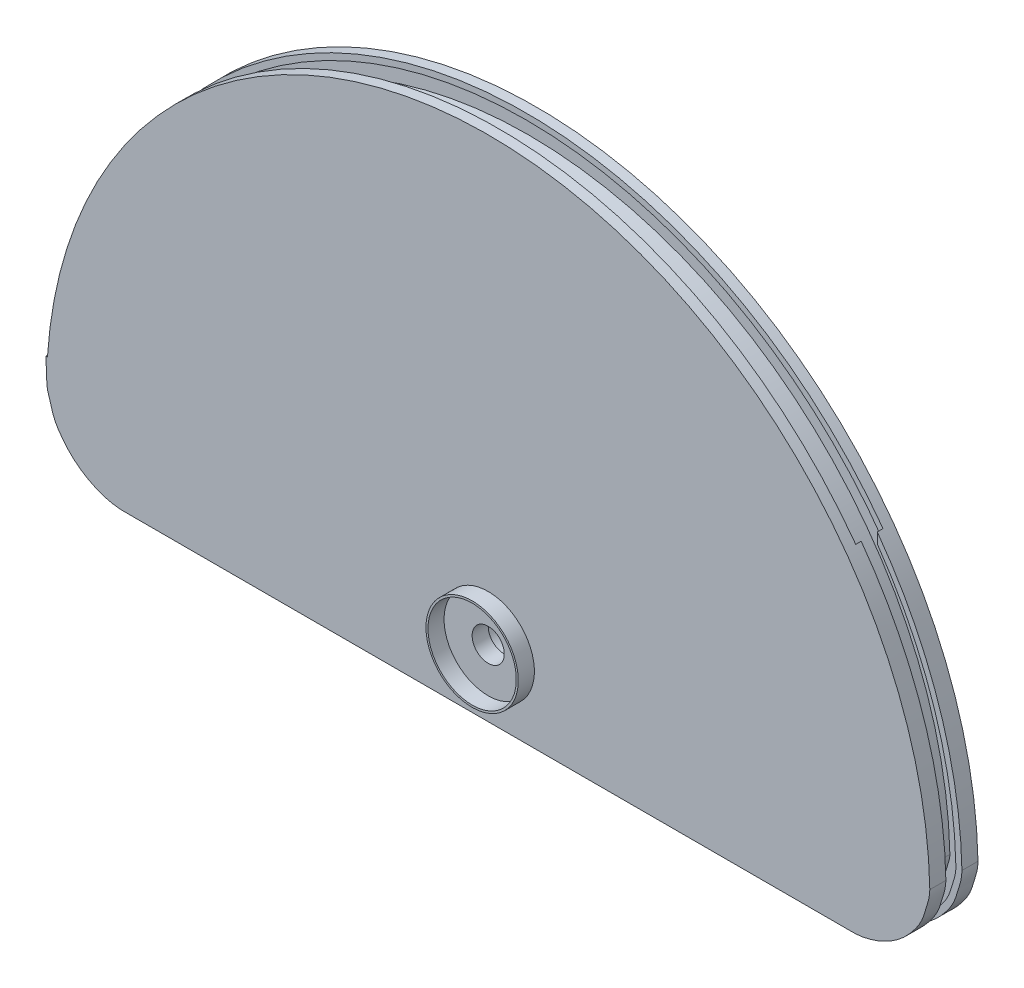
ISO-10303-21;
HEADER;
FILE_DESCRIPTION(('STEP AP214'),'2;1');
FILE_NAME('part.step','',(''),(''),'','','');
FILE_SCHEMA(('AUTOMOTIVE_DESIGN { 1 0 10303 214 1 1 1 1 }'));
ENDSEC;
DATA;
#1=APPLICATION_CONTEXT('core data for automotive mechanical design processes');
#2=APPLICATION_PROTOCOL_DEFINITION('international standard','automotive_design',2000,#1);
#3=PRODUCT_CONTEXT('',#1,'mechanical');
#4=PRODUCT('Part','Part','',(#3));
#5=PRODUCT_RELATED_PRODUCT_CATEGORY('part','',(#4));
#6=PRODUCT_DEFINITION_FORMATION('','',#4);
#7=PRODUCT_DEFINITION_CONTEXT('part definition',#1,'design');
#8=PRODUCT_DEFINITION('design','',#6,#7);
#9=PRODUCT_DEFINITION_SHAPE('','',#8);
#10=(LENGTH_UNIT() NAMED_UNIT(*) SI_UNIT(.MILLI.,.METRE.));
#11=(NAMED_UNIT(*) PLANE_ANGLE_UNIT() SI_UNIT($,.RADIAN.));
#12=(NAMED_UNIT(*) SI_UNIT($,.STERADIAN.) SOLID_ANGLE_UNIT());
#13=UNCERTAINTY_MEASURE_WITH_UNIT(LENGTH_MEASURE(1.E-05),#10,'distance_accuracy_value','');
#14=(GEOMETRIC_REPRESENTATION_CONTEXT(3) GLOBAL_UNCERTAINTY_ASSIGNED_CONTEXT((#13)) GLOBAL_UNIT_ASSIGNED_CONTEXT((#10,
#11,#12)) REPRESENTATION_CONTEXT('',''));
#15=CARTESIAN_POINT('',(0.,0.,0.));
#16=DIRECTION('',(0.,0.,1.));
#17=DIRECTION('',(1.,0.,0.));
#18=AXIS2_PLACEMENT_3D('',#15,#16,#17);
#19=CARTESIAN_POINT('',(0.,0.,-22.4));
#20=DIRECTION('',(0.,0.,-1.));
#21=DIRECTION('',(-1.,0.,0.));
#22=AXIS2_PLACEMENT_3D('',#19,#20,#21);
#23=CYLINDRICAL_SURFACE('',#22,110.);
#24=CARTESIAN_POINT('',(0.,0.,-23.8377519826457));
#25=DIRECTION('',(0.,0.,-1.));
#26=DIRECTION('',(-1.,0.,0.));
#27=AXIS2_PLACEMENT_3D('',#24,#25,#26);
#28=CIRCLE('',#27,110.);
#29=CARTESIAN_POINT('',(88.8928908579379,64.7923911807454,-23.8377519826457));
#30=VERTEX_POINT('',#29);
#31=CARTESIAN_POINT('',(-88.8913749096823,64.7944709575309,-23.8377519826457));
#32=VERTEX_POINT('',#31);
#33=EDGE_CURVE('E377',#30,#32,#28,.F.);
#34=ORIENTED_EDGE('',*,*,#33,.F.);
#35=DIRECTION('',(0.,0.,-1.));
#36=VECTOR('',#35,1.);
#37=CARTESIAN_POINT('',(88.892890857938,64.7923911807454,-22.4));
#38=LINE('',#37,#36);
#39=CARTESIAN_POINT('',(88.892890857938,64.7923911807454,-22.4));
#40=VERTEX_POINT('',#39);
#41=EDGE_CURVE('E404',#30,#40,#38,.F.);
#42=ORIENTED_EDGE('',*,*,#41,.T.);
#43=CARTESIAN_POINT('',(0.,0.,-22.4));
#44=DIRECTION('',(0.,0.,-1.));
#45=DIRECTION('',(-1.,0.,0.));
#46=AXIS2_PLACEMENT_3D('',#43,#44,#45);
#47=CIRCLE('',#46,110.);
#48=CARTESIAN_POINT('',(109.975766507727,2.30884842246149,-22.4));
#49=VERTEX_POINT('',#48);
#50=EDGE_CURVE('E870',#40,#49,#47,.T.);
#51=ORIENTED_EDGE('',*,*,#50,.T.);
#52=DIRECTION('',(0.,0.,-1.));
#53=VECTOR('',#52,1.);
#54=CARTESIAN_POINT('',(109.975766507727,2.30884842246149,-22.4));
#55=LINE('',#54,#53);
#56=CARTESIAN_POINT('',(109.975766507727,2.30884842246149,-26.4));
#57=VERTEX_POINT('',#56);
#58=EDGE_CURVE('E722',#49,#57,#55,.T.);
#59=ORIENTED_EDGE('',*,*,#58,.T.);
#60=CARTESIAN_POINT('',(0.,0.,-26.4));
#61=DIRECTION('',(0.,0.,-1.));
#62=DIRECTION('',(-1.,0.,0.));
#63=AXIS2_PLACEMENT_3D('',#60,#61,#62);
#64=CIRCLE('',#63,110.);
#65=CARTESIAN_POINT('',(-109.975712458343,2.31142148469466,-26.4));
#66=VERTEX_POINT('',#65);
#67=EDGE_CURVE('E708',#66,#57,#64,.T.);
#68=ORIENTED_EDGE('',*,*,#67,.F.);
#69=DIRECTION('',(0.,0.,-1.));
#70=VECTOR('',#69,1.);
#71=CARTESIAN_POINT('',(-109.975712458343,2.31142148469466,-22.4));
#72=LINE('',#71,#70);
#73=CARTESIAN_POINT('',(-109.975712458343,2.31142148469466,-22.4));
#74=VERTEX_POINT('',#73);
#75=EDGE_CURVE('E705',#74,#66,#72,.T.);
#76=ORIENTED_EDGE('',*,*,#75,.F.);
#77=CARTESIAN_POINT('',(-88.8913749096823,64.7944709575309,-22.4));
#78=VERTEX_POINT('',#77);
#79=EDGE_CURVE('E872',#74,#78,#47,.T.);
#80=ORIENTED_EDGE('',*,*,#79,.T.);
#81=DIRECTION('',(0.,0.,-1.));
#82=VECTOR('',#81,1.);
#83=CARTESIAN_POINT('',(-88.8913749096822,64.7944709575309,-22.4));
#84=LINE('',#83,#82);
#85=EDGE_CURVE('E392',#32,#78,#84,.F.);
#86=ORIENTED_EDGE('',*,*,#85,.F.);
#87=EDGE_LOOP('',(#34,#42,#51,#59,#68,#76,#80,#86));
#88=FACE_BOUND('',#87,.T.);
#89=ADVANCED_FACE('F82',(#88),#23,.T.);
#90=CARTESIAN_POINT('',(103.650753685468,-11.1810467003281,-22.4));
#91=DIRECTION('',(0.,0.,1.));
#92=DIRECTION('',(1.,0.,0.));
#93=AXIS2_PLACEMENT_3D('',#90,#91,#92);
#94=PLANE('',#93);
#95=ORIENTED_EDGE('',*,*,#50,.F.);
#96=DIRECTION('',(-1.16983174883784E-05,-0.999999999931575,0.));
#97=VECTOR('',#96,1.);
#98=CARTESIAN_POINT('',(88.8920020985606,-11.1808740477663,-22.4));
#99=LINE('',#98,#97);
#100=CARTESIAN_POINT('',(88.8928606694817,62.2118101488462,-22.4));
#101=VERTEX_POINT('',#100);
#102=EDGE_CURVE('E401',#40,#101,#99,.T.);
#103=ORIENTED_EDGE('',*,*,#102,.T.);
#104=CARTESIAN_POINT('',(0.,0.,-22.4));
#105=DIRECTION('',(0.,0.,1.));
#106=DIRECTION('',(1.,0.,0.));
#107=AXIS2_PLACEMENT_3D('',#104,#105,#106);
#108=CIRCLE('',#107,108.5);
#109=CARTESIAN_POINT('',(108.475705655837,2.2959273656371,-22.4));
#110=VERTEX_POINT('',#109);
#111=EDGE_CURVE('E1153',#110,#101,#108,.T.);
#112=ORIENTED_EDGE('',*,*,#111,.F.);
#113=CARTESIAN_POINT('',(108.475705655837,2.29592736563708,-22.4));
#114=CARTESIAN_POINT('',(108.472762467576,1.70429598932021,-22.4));
#115=CARTESIAN_POINT('',(108.403310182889,1.12692749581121,-22.4));
#116=CARTESIAN_POINT('',(108.171935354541,-0.00797923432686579,-22.4));
#117=CARTESIAN_POINT('',(108.008054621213,-0.565097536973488,-22.4));
#118=CARTESIAN_POINT('',(107.743064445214,-1.39666418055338,-22.4));
#119=CARTESIAN_POINT('',(107.651469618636,-1.67315293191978,-22.4));
#120=CARTESIAN_POINT('',(107.482192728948,-2.22911402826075,-22.4));
#121=CARTESIAN_POINT('',(107.403477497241,-2.5094736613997,-22.4));
#122=CARTESIAN_POINT('',(107.240385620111,-3.06792248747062,-22.4));
#123=CARTESIAN_POINT('',(107.157207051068,-3.34645225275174,-22.4));
#124=CARTESIAN_POINT('',(106.974540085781,-3.8965723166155,-22.4));
#125=CARTESIAN_POINT('',(106.875279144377,-4.16825939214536,-22.4));
#126=CARTESIAN_POINT('',(106.548063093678,-4.97079743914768,-22.4));
#127=CARTESIAN_POINT('',(106.284979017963,-5.48670182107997,-22.4));
#128=CARTESIAN_POINT('',(105.828358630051,-6.23418121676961,-22.4));
#129=CARTESIAN_POINT('',(105.665978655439,-6.47997333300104,-22.4));
#130=CARTESIAN_POINT('',(105.328659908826,-6.96140122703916,-22.4));
#131=CARTESIAN_POINT('',(105.153905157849,-7.19628531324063,-22.4));
#132=CARTESIAN_POINT('',(104.261250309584,-8.35264711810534,-22.4));
#133=CARTESIAN_POINT('',(103.507591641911,-9.23992392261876,-22.4));
#134=CARTESIAN_POINT('',(102.248524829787,-10.4478612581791,-22.4));
#135=CARTESIAN_POINT('',(101.8063503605,-10.829000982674,-22.4));
#136=CARTESIAN_POINT('',(100.877586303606,-11.5488000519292,-22.4));
#137=CARTESIAN_POINT('',(100.390363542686,-11.8880742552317,-22.4));
#138=CARTESIAN_POINT('',(98.9023048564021,-12.8275208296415,-22.4));
#139=CARTESIAN_POINT('',(97.8668528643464,-13.3635994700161,-22.4));
#140=CARTESIAN_POINT('',(96.2466927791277,-14.0285176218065,-22.4));
#141=CARTESIAN_POINT('',(95.6952838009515,-14.226558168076,-22.4));
#142=CARTESIAN_POINT('',(94.5668144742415,-14.5693314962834,-22.4));
#143=CARTESIAN_POINT('',(93.9918282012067,-14.7130232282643,-22.4));
#144=CARTESIAN_POINT('',(92.2640407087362,-15.0481681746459,-22.4));
#145=CARTESIAN_POINT('',(91.096896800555,-15.1453426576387,-22.4));
#146=CARTESIAN_POINT('',(89.9120215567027,-15.0960602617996,-22.4));
#147=B_SPLINE_CURVE_WITH_KNOTS('',3,(#113,#114,#115,#116,#117,#118,#119,#120,#121,#122,#123,
#124,#125,#126,#127,#128,#129,#130,#131,#132,#133,#134,#135,#136,#137,#138,#139,#140,#141,#142,
#143,#144,#145,#146),.UNSPECIFIED.,.F.,.F.,(4,2,2,2,2,2,2,2,2,2,2,2,2,2,2,2,4),(0.,
0.0624999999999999,0.125,0.15625,0.1875,0.21875,0.249999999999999,0.312499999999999,
0.343749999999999,0.374999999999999,0.5,0.5625,0.625,0.750000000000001,0.8125,0.875,1.),.UNSPECIFIED.);
#148=CARTESIAN_POINT('',(89.9120215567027,-15.0960602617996,-22.4));
#149=VERTEX_POINT('',#148);
#150=EDGE_CURVE('E1172',#149,#110,#147,.F.);
#151=ORIENTED_EDGE('',*,*,#150,.F.);
#152=DIRECTION('',(1.,0.,0.));
#153=VECTOR('',#152,1.);
#154=CARTESIAN_POINT('',(103.650753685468,-15.0960602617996,-22.4));
#155=LINE('',#154,#153);
#156=CARTESIAN_POINT('',(-89.9120204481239,-15.0960602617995,-22.4));
#157=VERTEX_POINT('',#156);
#158=EDGE_CURVE('E1000',#157,#149,#155,.T.);
#159=ORIENTED_EDGE('',*,*,#158,.F.);
#160=CARTESIAN_POINT('',(-89.9120204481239,-15.0960602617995,-22.4));
#161=CARTESIAN_POINT('',(-91.1013698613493,-15.1455269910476,-22.4));
#162=CARTESIAN_POINT('',(-92.2694801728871,-15.0473802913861,-22.4));
#163=CARTESIAN_POINT('',(-93.9946210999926,-14.7123375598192,-22.4));
#164=CARTESIAN_POINT('',(-94.5652316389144,-14.5698230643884,-22.4));
#165=CARTESIAN_POINT('',(-95.6979524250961,-14.2257163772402,-22.4));
#166=CARTESIAN_POINT('',(-96.2566602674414,-14.0249227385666,-22.4));
#167=CARTESIAN_POINT('',(-97.8904331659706,-13.3528660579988,-22.4));
#168=CARTESIAN_POINT('',(-98.9335072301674,-12.8109038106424,-22.4));
#169=CARTESIAN_POINT('',(-100.430818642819,-11.8608669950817,-22.4));
#170=CARTESIAN_POINT('',(-100.917898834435,-11.519576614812,-22.4));
#171=CARTESIAN_POINT('',(-101.844633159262,-10.7970675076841,-22.4));
#172=CARTESIAN_POINT('',(-102.286398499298,-10.4138663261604,-22.4));
#173=CARTESIAN_POINT('',(-103.126271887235,-9.60310981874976,-22.4));
#174=CARTESIAN_POINT('',(-103.52522509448,-9.17641314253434,-22.4));
#175=CARTESIAN_POINT('',(-104.292719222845,-8.29212206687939,-22.4));
#176=CARTESIAN_POINT('',(-104.662394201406,-7.83567982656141,-22.4));
#177=CARTESIAN_POINT('',(-105.37979170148,-6.90049248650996,-22.4));
#178=CARTESIAN_POINT('',(-105.718389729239,-6.42021864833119,-22.4));
#179=CARTESIAN_POINT('',(-106.316309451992,-5.42844118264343,-22.4));
#180=CARTESIAN_POINT('',(-106.573879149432,-4.91441194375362,-22.4));
#181=CARTESIAN_POINT('',(-106.89530703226,-4.1149119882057,-22.4));
#182=CARTESIAN_POINT('',(-106.992844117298,-3.84420208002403,-22.4));
#183=CARTESIAN_POINT('',(-107.172706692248,-3.29611531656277,-22.4));
#184=CARTESIAN_POINT('',(-107.254939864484,-3.01869800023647,-22.4));
#185=CARTESIAN_POINT('',(-107.416803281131,-2.46272255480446,-22.4));
#186=CARTESIAN_POINT('',(-107.495277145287,-2.18365760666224,-22.4));
#187=CARTESIAN_POINT('',(-107.665031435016,-1.63114057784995,-22.4));
#188=CARTESIAN_POINT('',(-107.755756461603,-1.35744507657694,-22.4));
#189=CARTESIAN_POINT('',(-108.017996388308,-0.532004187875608,-22.4));
#190=CARTESIAN_POINT('',(-108.1792847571,0.0217779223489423,-22.4));
#191=CARTESIAN_POINT('',(-108.405708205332,1.14582833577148,-22.4));
#192=CARTESIAN_POINT('',(-108.472936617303,1.71619552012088,-22.4));
#193=CARTESIAN_POINT('',(-108.475656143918,2.29826546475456,-22.4));
#194=B_SPLINE_CURVE_WITH_KNOTS('',3,(#160,#161,#162,#163,#164,#165,#166,#167,#168,#169,#170,
#171,#172,#173,#174,#175,#176,#177,#178,#179,#180,#181,#182,#183,#184,#185,#186,#187,#188,#189,
#190,#191,#192,#193),.UNSPECIFIED.,.F.,.F.,(4,2,2,2,2,2,2,2,2,2,2,2,2,2,2,2,4),(0.,
0.124999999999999,0.187499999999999,0.249999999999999,0.374999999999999,0.437499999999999,
0.499999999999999,0.562499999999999,0.624999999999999,0.6875,0.75,0.78125,0.8125,0.84375,0.875,
0.9375,1.),.UNSPECIFIED.);
#195=CARTESIAN_POINT('',(-108.475656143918,2.29826546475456,-22.4));
#196=VERTEX_POINT('',#195);
#197=EDGE_CURVE('E1144',#196,#157,#194,.F.);
#198=ORIENTED_EDGE('',*,*,#197,.F.);
#199=CARTESIAN_POINT('',(-88.8914050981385,62.2138899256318,-22.4));
#200=VERTEX_POINT('',#199);
#201=EDGE_CURVE('E99',#200,#196,#108,.T.);
#202=ORIENTED_EDGE('',*,*,#201,.F.);
#203=DIRECTION('',(-1.16983174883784E-05,-0.999999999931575,0.));
#204=VECTOR('',#203,1.);
#205=CARTESIAN_POINT('',(-88.8922636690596,-11.1787942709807,-22.4));
#206=LINE('',#205,#204);
#207=EDGE_CURVE('E373',#78,#200,#206,.T.);
#208=ORIENTED_EDGE('',*,*,#207,.F.);
#209=ORIENTED_EDGE('',*,*,#79,.F.);
#210=CARTESIAN_POINT('',(-89.8808403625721,-16.5960602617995,-22.4));
#211=CARTESIAN_POINT('',(-91.2161671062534,-16.6515983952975,-22.4));
#212=CARTESIAN_POINT('',(-92.5189867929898,-16.5314435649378,-22.4));
#213=CARTESIAN_POINT('',(-95.0175143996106,-16.0369814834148,-22.4));
#214=CARTESIAN_POINT('',(-96.2147083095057,-15.6628658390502,-22.4));
#215=CARTESIAN_POINT('',(-97.9232010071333,-14.9619551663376,-22.4));
#216=CARTESIAN_POINT('',(-98.4782347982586,-14.7047870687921,-22.4));
#217=CARTESIAN_POINT('',(-99.5581365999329,-14.1493485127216,-22.4));
#218=CARTESIAN_POINT('',(-100.080035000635,-13.853621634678,-22.4));
#219=CARTESIAN_POINT('',(-101.116527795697,-13.2070542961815,-22.4));
#220=CARTESIAN_POINT('',(-101.628743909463,-12.8565048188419,-22.4));
#221=CARTESIAN_POINT('',(-102.380776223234,-12.2840919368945,-22.4));
#222=CARTESIAN_POINT('',(-102.628718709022,-12.08552309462,-22.4));
#223=CARTESIAN_POINT('',(-103.117659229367,-11.67197318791,-22.4));
#224=CARTESIAN_POINT('',(-103.360742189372,-11.4547772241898,-22.4));
#225=CARTESIAN_POINT('',(-104.056502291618,-10.7985542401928,-22.4));
#226=CARTESIAN_POINT('',(-104.478502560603,-10.3548100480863,-22.4));
#227=CARTESIAN_POINT('',(-105.062566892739,-9.69619957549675,-22.4));
#228=CARTESIAN_POINT('',(-105.249115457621,-9.47776270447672,-22.4));
#229=CARTESIAN_POINT('',(-105.608217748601,-9.04515210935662,-22.4));
#230=CARTESIAN_POINT('',(-105.779514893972,-8.83258290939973,-22.4));
#231=CARTESIAN_POINT('',(-106.283406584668,-8.19391414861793,-22.4));
#232=CARTESIAN_POINT('',(-106.658847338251,-7.70179975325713,-22.4));
#233=CARTESIAN_POINT('',(-107.228461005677,-6.82708845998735,-22.4));
#234=CARTESIAN_POINT('',(-107.419171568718,-6.51241865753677,-22.4));
#235=CARTESIAN_POINT('',(-107.695978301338,-6.00017690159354,-22.4));
#236=CARTESIAN_POINT('',(-107.786665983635,-5.82272876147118,-22.4));
#237=CARTESIAN_POINT('',(-107.962630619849,-5.45375693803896,-22.4));
#238=CARTESIAN_POINT('',(-108.044424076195,-5.26905159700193,-22.4));
#239=CARTESIAN_POINT('',(-108.412995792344,-4.38340450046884,-22.4));
#240=CARTESIAN_POINT('',(-108.598513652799,-3.7660735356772,-22.4));
#241=CARTESIAN_POINT('',(-108.819749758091,-3.01139883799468,-22.4));
#242=CARTESIAN_POINT('',(-108.883244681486,-2.78771710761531,-22.4));
#243=CARTESIAN_POINT('',(-108.954908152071,-2.54405382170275,-22.4));
#244=CARTESIAN_POINT('',(-108.968839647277,-2.49711567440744,-22.4));
#245=CARTESIAN_POINT('',(-108.995965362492,-2.40684419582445,-22.4));
#246=CARTESIAN_POINT('',(-109.008778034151,-2.36476610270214,-22.4));
#247=CARTESIAN_POINT('',(-109.049528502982,-2.23292271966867,-22.4));
#248=CARTESIAN_POINT('',(-109.079881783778,-2.13718927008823,-22.4));
#249=CARTESIAN_POINT('',(-109.179406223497,-1.82671881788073,-22.4));
#250=CARTESIAN_POINT('',(-109.257245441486,-1.58887853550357,-22.4));
#251=CARTESIAN_POINT('',(-109.425104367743,-1.04893254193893,-22.4));
#252=CARTESIAN_POINT('',(-109.515192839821,-0.746732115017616,-22.4));
#253=CARTESIAN_POINT('',(-109.689406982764,-0.0712447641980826,-22.4));
#254=CARTESIAN_POINT('',(-109.773611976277,0.302340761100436,-22.4));
#255=CARTESIAN_POINT('',(-109.919287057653,1.1959251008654,-22.4));
#256=CARTESIAN_POINT('',(-109.974239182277,1.73068442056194,-22.4));
#257=CARTESIAN_POINT('',(-109.975712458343,2.31142148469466,-22.4));
#258=B_SPLINE_CURVE_WITH_KNOTS('',3,(#210,#211,#212,#213,#214,#215,#216,#217,#218,#219,#220,
#221,#222,#223,#224,#225,#226,#227,#228,#229,#230,#231,#232,#233,#234,#235,#236,#237,#238,#239,
#240,#241,#242,#243,#244,#245,#246,#247,#248,#249,#250,#251,#252,#253,#254,#255,#256,#257),
.UNSPECIFIED.,.F.,.F.,(4,2,2,2,2,2,2,2,2,2,2,2,2,2,2,2,2,2,2,2,2,2,2,4),(0.,0.124342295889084,
0.248684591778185,0.310855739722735,0.373026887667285,0.435198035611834,0.46628360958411,
0.497369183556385,0.559540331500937,0.590625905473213,0.621711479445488,0.683882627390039,
0.714968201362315,0.730510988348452,0.74605377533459,0.808224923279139,0.839310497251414,
0.847081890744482,0.854853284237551,0.870396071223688,0.901481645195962,0.932567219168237,
0.963652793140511,1.),.UNSPECIFIED.);
#259=CARTESIAN_POINT('',(-89.8808403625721,-16.5960602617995,-22.4));
#260=VERTEX_POINT('',#259);
#261=EDGE_CURVE('E721',#260,#74,#258,.T.);
#262=ORIENTED_EDGE('',*,*,#261,.F.);
#263=DIRECTION('',(1.,0.,0.));
#264=VECTOR('',#263,1.);
#265=CARTESIAN_POINT('',(0.,-16.5960602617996,-22.4));
#266=LINE('',#265,#264);
#267=CARTESIAN_POINT('',(89.880840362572,-16.5960602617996,-22.4));
#268=VERTEX_POINT('',#267);
#269=EDGE_CURVE('E707',#260,#268,#266,.T.);
#270=ORIENTED_EDGE('',*,*,#269,.T.);
#271=CARTESIAN_POINT('',(109.975766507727,2.30884842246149,-22.4));
#272=CARTESIAN_POINT('',(109.974128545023,1.72738331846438,-22.4));
#273=CARTESIAN_POINT('',(109.918907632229,1.1920758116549,-22.4));
#274=CARTESIAN_POINT('',(109.772863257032,0.298400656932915,-22.4));
#275=CARTESIAN_POINT('',(109.688606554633,-0.0748895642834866,-22.4));
#276=CARTESIAN_POINT('',(109.514366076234,-0.749829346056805,-22.4));
#277=CARTESIAN_POINT('',(109.424302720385,-1.05177652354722,-22.4));
#278=CARTESIAN_POINT('',(109.256536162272,-1.59124756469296,-22.4));
#279=CARTESIAN_POINT('',(109.17876447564,-1.82886559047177,-22.4));
#280=CARTESIAN_POINT('',(109.079354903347,-2.13901269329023,-22.4));
#281=CARTESIAN_POINT('',(109.049042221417,-2.23464002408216,-22.4));
#282=CARTESIAN_POINT('',(109.008353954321,-2.36632540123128,-22.4));
#283=CARTESIAN_POINT('',(108.995532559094,-2.4084478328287,-22.4));
#284=CARTESIAN_POINT('',(108.968391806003,-2.49879648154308,-22.4));
#285=CARTESIAN_POINT('',(108.954452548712,-2.54577274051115,-22.4));
#286=CARTESIAN_POINT('',(108.882748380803,-2.78962403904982,-22.4));
#287=CARTESIAN_POINT('',(108.819214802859,-3.01344798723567,-22.4));
#288=CARTESIAN_POINT('',(108.597819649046,-3.76852106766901,-22.4));
#289=CARTESIAN_POINT('',(108.412133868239,-4.38608731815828,-22.4));
#290=CARTESIAN_POINT('',(108.043225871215,-5.27192582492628,-22.4));
#291=CARTESIAN_POINT('',(107.96131935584,-5.45674188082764,-22.4));
#292=CARTESIAN_POINT('',(107.7853168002,-5.82552680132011,-22.4));
#293=CARTESIAN_POINT('',(107.694617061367,-6.00288440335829,-22.4));
#294=CARTESIAN_POINT('',(107.417791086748,-6.51486522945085,-22.4));
#295=CARTESIAN_POINT('',(107.227090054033,-6.82937561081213,-22.4));
#296=CARTESIAN_POINT('',(106.657546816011,-7.70365320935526,-22.4));
#297=CARTESIAN_POINT('',(106.282206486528,-8.1955379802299,-22.4));
#298=CARTESIAN_POINT('',(105.778495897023,-8.83391063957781,-22.4));
#299=CARTESIAN_POINT('',(105.607129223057,-9.04654485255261,-22.4));
#300=CARTESIAN_POINT('',(105.248006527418,-9.47912548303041,-22.4));
#301=CARTESIAN_POINT('',(105.061446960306,-9.6975449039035,-22.4));
#302=CARTESIAN_POINT('',(104.477347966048,-10.3560955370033,-22.4));
#303=CARTESIAN_POINT('',(104.055322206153,-10.7997898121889,-22.4));
#304=CARTESIAN_POINT('',(103.359526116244,-11.4559224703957,-22.4));
#305=CARTESIAN_POINT('',(103.116452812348,-11.6730662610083,-22.4));
#306=CARTESIAN_POINT('',(102.62754195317,-12.0865157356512,-22.4));
#307=CARTESIAN_POINT('',(102.37961637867,-12.2850368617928,-22.4));
#308=CARTESIAN_POINT('',(101.627639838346,-12.8573138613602,-22.4));
#309=CARTESIAN_POINT('',(101.115467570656,-13.2077824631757,-22.4));
#310=CARTESIAN_POINT('',(100.079070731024,-13.8542051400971,-22.4));
#311=CARTESIAN_POINT('',(99.5572148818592,-14.1498741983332,-22.4));
#312=CARTESIAN_POINT('',(98.4773967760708,-14.7052048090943,-22.4));
#313=CARTESIAN_POINT('',(97.922408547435,-14.9623219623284,-22.4));
#314=CARTESIAN_POINT('',(96.2140629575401,-15.6630908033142,-22.4));
#315=CARTESIAN_POINT('',(95.016981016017,-16.0371261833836,-22.4));
#316=CARTESIAN_POINT('',(92.5187027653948,-16.5314737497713,-22.4));
#317=CARTESIAN_POINT('',(91.2160211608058,-16.6515943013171,-22.4));
#318=CARTESIAN_POINT('',(89.880840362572,-16.5960602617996,-22.4));
#319=B_SPLINE_CURVE_WITH_KNOTS('',3,(#271,#272,#273,#274,#275,#276,#277,#278,#279,#280,#281,
#282,#283,#284,#285,#286,#287,#288,#289,#290,#291,#292,#293,#294,#295,#296,#297,#298,#299,#300,
#301,#302,#303,#304,#305,#306,#307,#308,#309,#310,#311,#312,#313,#314,#315,#316,#317,#318),
.UNSPECIFIED.,.F.,.F.,(4,2,2,2,2,2,2,2,2,2,2,2,2,2,2,2,2,2,2,2,2,2,2,4),(0.,0.0364021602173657,
0.06748596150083,0.0985697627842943,0.129653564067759,0.145195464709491,0.152966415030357,
0.160737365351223,0.191821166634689,0.25398876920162,0.269530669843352,0.285072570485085,
0.31615637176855,0.37832397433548,0.409407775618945,0.44049157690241,0.502659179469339,
0.533742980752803,0.564826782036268,0.626994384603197,0.689161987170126,0.751329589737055,
0.875664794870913,1.),.UNSPECIFIED.);
#320=EDGE_CURVE('E710',#49,#268,#319,.T.);
#321=ORIENTED_EDGE('',*,*,#320,.F.);
#322=EDGE_LOOP('',(#95,#103,#112,#151,#159,#198,#202,#208,#209,#262,#270,#321));
#323=FACE_BOUND('',#322,.T.);
#324=ADVANCED_FACE('F849',(#323),#94,.T.);
#325=CARTESIAN_POINT('',(0.,0.,-16.4));
#326=DIRECTION('',(0.,0.,-1.));
#327=DIRECTION('',(-1.,0.,0.));
#328=AXIS2_PLACEMENT_3D('',#325,#326,#327);
#329=CYLINDRICAL_SURFACE('',#328,108.5);
#330=DIRECTION('',(0.,0.,-1.));
#331=VECTOR('',#330,1.);
#332=CARTESIAN_POINT('',(88.8928606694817,62.2118101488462,-16.4));
#333=LINE('',#332,#331);
#334=CARTESIAN_POINT('',(88.8928606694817,62.2118101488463,-23.8377519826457));
#335=VERTEX_POINT('',#334);
#336=EDGE_CURVE('E360',#335,#101,#333,.F.);
#337=ORIENTED_EDGE('',*,*,#336,.F.);
#338=CARTESIAN_POINT('',(0.,0.,-23.8377519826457));
#339=DIRECTION('',(0.,0.,-1.));
#340=DIRECTION('',(-1.,0.,0.));
#341=AXIS2_PLACEMENT_3D('',#338,#339,#340);
#342=CIRCLE('',#341,108.5);
#343=CARTESIAN_POINT('',(-88.8914050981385,62.2138899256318,-23.8377519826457));
#344=VERTEX_POINT('',#343);
#345=EDGE_CURVE('E355',#335,#344,#342,.F.);
#346=ORIENTED_EDGE('',*,*,#345,.T.);
#347=DIRECTION('',(0.,0.,-1.));
#348=VECTOR('',#347,1.);
#349=CARTESIAN_POINT('',(-88.8914050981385,62.2138899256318,-16.4));
#350=LINE('',#349,#348);
#351=EDGE_CURVE('E358',#344,#200,#350,.F.);
#352=ORIENTED_EDGE('',*,*,#351,.T.);
#353=ORIENTED_EDGE('',*,*,#201,.T.);
#354=DIRECTION('',(0.,0.,-1.));
#355=VECTOR('',#354,1.);
#356=CARTESIAN_POINT('',(-108.475656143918,2.29826546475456,-16.4));
#357=LINE('',#356,#355);
#358=CARTESIAN_POINT('',(-108.475656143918,2.29826546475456,-24.4));
#359=VERTEX_POINT('',#358);
#360=EDGE_CURVE('E1109',#196,#359,#357,.T.);
#361=ORIENTED_EDGE('',*,*,#360,.T.);
#362=CARTESIAN_POINT('',(0.,0.,-24.4));
#363=DIRECTION('',(0.,0.,-1.));
#364=DIRECTION('',(-1.,0.,0.));
#365=AXIS2_PLACEMENT_3D('',#362,#363,#364);
#366=CIRCLE('',#365,108.5);
#367=CARTESIAN_POINT('',(108.475705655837,2.2959273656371,-24.4));
#368=VERTEX_POINT('',#367);
#369=EDGE_CURVE('E1733',#359,#368,#366,.T.);
#370=ORIENTED_EDGE('',*,*,#369,.T.);
#371=DIRECTION('',(0.,0.,-1.));
#372=VECTOR('',#371,1.);
#373=CARTESIAN_POINT('',(108.475705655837,2.2959273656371,-16.4));
#374=LINE('',#373,#372);
#375=EDGE_CURVE('E1108',#110,#368,#374,.T.);
#376=ORIENTED_EDGE('',*,*,#375,.F.);
#377=ORIENTED_EDGE('',*,*,#111,.T.);
#378=EDGE_LOOP('',(#337,#346,#352,#353,#361,#370,#376,#377));
#379=FACE_BOUND('',#378,.T.);
#380=ADVANCED_FACE('F357',(#379),#329,.F.);
#381=DIRECTION('',(0.,0.,-1.));
#382=VECTOR('',#381,1.);
#383=CARTESIAN_POINT('',(88.8928606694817,62.2118101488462,-16.4));
#384=LINE('',#383,#382);
#385=CARTESIAN_POINT('',(88.8928606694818,62.2118101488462,-18.4));
#386=VERTEX_POINT('',#385);
#387=CARTESIAN_POINT('',(88.8928606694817,62.2118101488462,-17.0377519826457));
#388=VERTEX_POINT('',#387);
#389=EDGE_CURVE('E397',#386,#388,#384,.F.);
#390=ORIENTED_EDGE('',*,*,#389,.F.);
#391=CARTESIAN_POINT('',(0.,0.,-18.4));
#392=DIRECTION('',(0.,0.,-1.));
#393=DIRECTION('',(-1.,0.,0.));
#394=AXIS2_PLACEMENT_3D('',#391,#392,#393);
#395=CIRCLE('',#394,108.5);
#396=CARTESIAN_POINT('',(108.475705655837,2.2959273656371,-18.4));
#397=VERTEX_POINT('',#396);
#398=EDGE_CURVE('E629',#386,#397,#395,.T.);
#399=ORIENTED_EDGE('',*,*,#398,.T.);
#400=CARTESIAN_POINT('',(108.475705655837,2.2959273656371,-16.4));
#401=VERTEX_POINT('',#400);
#402=EDGE_CURVE('E1114',#401,#397,#374,.T.);
#403=ORIENTED_EDGE('',*,*,#402,.F.);
#404=CARTESIAN_POINT('',(0.,0.,-16.4));
#405=DIRECTION('',(0.,0.,-1.));
#406=DIRECTION('',(-1.,0.,0.));
#407=AXIS2_PLACEMENT_3D('',#404,#405,#406);
#408=CIRCLE('',#407,108.5);
#409=CARTESIAN_POINT('',(-108.475656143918,2.29826546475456,-16.4));
#410=VERTEX_POINT('',#409);
#411=EDGE_CURVE('E1112',#410,#401,#408,.T.);
#412=ORIENTED_EDGE('',*,*,#411,.F.);
#413=CARTESIAN_POINT('',(-108.475656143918,2.29826546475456,-18.4));
#414=VERTEX_POINT('',#413);
#415=EDGE_CURVE('E1099',#410,#414,#357,.T.);
#416=ORIENTED_EDGE('',*,*,#415,.T.);
#417=CARTESIAN_POINT('',(-88.8914050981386,62.2138899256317,-18.4));
#418=VERTEX_POINT('',#417);
#419=EDGE_CURVE('E630',#414,#418,#395,.T.);
#420=ORIENTED_EDGE('',*,*,#419,.T.);
#421=DIRECTION('',(0.,0.,-1.));
#422=VECTOR('',#421,1.);
#423=CARTESIAN_POINT('',(-88.8914050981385,62.2138899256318,-16.4));
#424=LINE('',#423,#422);
#425=CARTESIAN_POINT('',(-88.8914050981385,62.2138899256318,-17.0377519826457));
#426=VERTEX_POINT('',#425);
#427=EDGE_CURVE('E374',#418,#426,#424,.F.);
#428=ORIENTED_EDGE('',*,*,#427,.T.);
#429=CARTESIAN_POINT('',(0.,0.,-17.0377519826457));
#430=DIRECTION('',(0.,0.,1.));
#431=DIRECTION('',(1.,0.,0.));
#432=AXIS2_PLACEMENT_3D('',#429,#430,#431);
#433=CIRCLE('',#432,108.5);
#434=EDGE_CURVE('E407',#426,#388,#433,.F.);
#435=ORIENTED_EDGE('',*,*,#434,.T.);
#436=EDGE_LOOP('',(#390,#399,#403,#412,#416,#420,#428,#435));
#437=FACE_BOUND('',#436,.T.);
#438=ADVANCED_FACE('F1096',(#437),#329,.F.);
#439=CARTESIAN_POINT('',(0.,0.,-18.4));
#440=DIRECTION('',(0.,0.,1.));
#441=DIRECTION('',(1.,0.,0.));
#442=AXIS2_PLACEMENT_3D('',#439,#440,#441);
#443=CYLINDRICAL_SURFACE('',#442,110.);
#444=CARTESIAN_POINT('',(0.,0.,-18.4));
#445=DIRECTION('',(0.,0.,1.));
#446=DIRECTION('',(1.,0.,0.));
#447=AXIS2_PLACEMENT_3D('',#444,#445,#446);
#448=CIRCLE('',#447,110.);
#449=CARTESIAN_POINT('',(109.978367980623,2.18141612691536,-18.4));
#450=VERTEX_POINT('',#449);
#451=CARTESIAN_POINT('',(88.892890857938,64.7923911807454,-18.4));
#452=VERTEX_POINT('',#451);
#453=EDGE_CURVE('E907',#450,#452,#448,.T.);
#454=ORIENTED_EDGE('',*,*,#453,.T.);
#455=DIRECTION('',(0.,0.,1.));
#456=VECTOR('',#455,1.);
#457=CARTESIAN_POINT('',(88.892890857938,64.7923911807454,-18.4));
#458=LINE('',#457,#456);
#459=CARTESIAN_POINT('',(88.892890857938,64.7923911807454,-17.0377519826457));
#460=VERTEX_POINT('',#459);
#461=EDGE_CURVE('E394',#452,#460,#458,.T.);
#462=ORIENTED_EDGE('',*,*,#461,.T.);
#463=CARTESIAN_POINT('',(0.,0.,-17.0377519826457));
#464=DIRECTION('',(0.,0.,1.));
#465=DIRECTION('',(1.,0.,0.));
#466=AXIS2_PLACEMENT_3D('',#463,#464,#465);
#467=CIRCLE('',#466,110.);
#468=CARTESIAN_POINT('',(-88.8913749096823,64.7944709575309,-17.0377519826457));
#469=VERTEX_POINT('',#468);
#470=EDGE_CURVE('E365',#469,#460,#467,.F.);
#471=ORIENTED_EDGE('',*,*,#470,.F.);
#472=DIRECTION('',(0.,0.,1.));
#473=VECTOR('',#472,1.);
#474=CARTESIAN_POINT('',(-88.8913749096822,64.7944709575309,-18.4));
#475=LINE('',#474,#473);
#476=CARTESIAN_POINT('',(-88.8913749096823,64.7944709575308,-18.4));
#477=VERTEX_POINT('',#476);
#478=EDGE_CURVE('E385',#477,#469,#475,.T.);
#479=ORIENTED_EDGE('',*,*,#478,.F.);
#480=CARTESIAN_POINT('',(-109.763693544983,7.20635687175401,-18.4));
#481=VERTEX_POINT('',#480);
#482=EDGE_CURVE('E914',#477,#481,#448,.T.);
#483=ORIENTED_EDGE('',*,*,#482,.T.);
#484=DIRECTION('',(0.,0.,1.));
#485=VECTOR('',#484,1.);
#486=CARTESIAN_POINT('',(-109.763693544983,7.20635687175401,-18.4));
#487=LINE('',#486,#485);
#488=CARTESIAN_POINT('',(-109.763693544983,7.20635687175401,-14.4));
#489=VERTEX_POINT('',#488);
#490=EDGE_CURVE('E949',#481,#489,#487,.T.);
#491=ORIENTED_EDGE('',*,*,#490,.T.);
#492=CARTESIAN_POINT('',(0.,0.,-14.4));
#493=DIRECTION('',(0.,0.,1.));
#494=DIRECTION('',(1.,0.,0.));
#495=AXIS2_PLACEMENT_3D('',#492,#493,#494);
#496=CIRCLE('',#495,110.);
#497=CARTESIAN_POINT('',(109.978367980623,2.18141612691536,-14.4));
#498=VERTEX_POINT('',#497);
#499=EDGE_CURVE('E995',#498,#489,#496,.T.);
#500=ORIENTED_EDGE('',*,*,#499,.F.);
#501=DIRECTION('',(0.,0.,1.));
#502=VECTOR('',#501,1.);
#503=CARTESIAN_POINT('',(109.978367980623,2.18141612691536,-18.4));
#504=LINE('',#503,#502);
#505=EDGE_CURVE('E909',#450,#498,#504,.T.);
#506=ORIENTED_EDGE('',*,*,#505,.F.);
#507=EDGE_LOOP('',(#454,#462,#471,#479,#483,#491,#500,#506));
#508=FACE_BOUND('',#507,.T.);
#509=ADVANCED_FACE('F904',(#508),#443,.T.);
#510=CARTESIAN_POINT('',(103.713907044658,-11.1227265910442,-18.4));
#511=DIRECTION('',(0.,0.,-1.));
#512=DIRECTION('',(-1.,0.,0.));
#513=AXIS2_PLACEMENT_3D('',#510,#511,#512);
#514=PLANE('',#513);
#515=ORIENTED_EDGE('',*,*,#398,.F.);
#516=DIRECTION('',(1.16983174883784E-05,0.999999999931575,0.));
#517=VECTOR('',#516,1.);
#518=CARTESIAN_POINT('',(88.8920027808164,-11.1225531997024,-18.4));
#519=LINE('',#518,#517);
#520=EDGE_CURVE('E12',#386,#452,#519,.T.);
#521=ORIENTED_EDGE('',*,*,#520,.T.);
#522=ORIENTED_EDGE('',*,*,#453,.F.);
#523=CARTESIAN_POINT('',(89.8808403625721,-16.5960602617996,-18.4));
#524=CARTESIAN_POINT('',(91.1656573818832,-16.6495962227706,-18.4));
#525=CARTESIAN_POINT('',(92.427709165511,-16.5422958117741,-18.4));
#526=CARTESIAN_POINT('',(94.2928644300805,-16.1840733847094,-18.4));
#527=CARTESIAN_POINT('',(94.9098705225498,-16.0313733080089,-18.4));
#528=CARTESIAN_POINT('',(96.1349148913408,-15.6626155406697,-18.4));
#529=CARTESIAN_POINT('',(96.7387230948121,-15.4476016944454,-18.4));
#530=CARTESIAN_POINT('',(98.5050830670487,-14.7259919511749,-18.4));
#531=CARTESIAN_POINT('',(99.6330756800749,-14.1426379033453,-18.4));
#532=CARTESIAN_POINT('',(101.252642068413,-13.1182051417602,-18.4));
#533=CARTESIAN_POINT('',(101.778870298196,-12.7505297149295,-18.4));
#534=CARTESIAN_POINT('',(102.780918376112,-11.9721351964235,-18.4));
#535=CARTESIAN_POINT('',(103.259078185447,-11.5594265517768,-18.4));
#536=CARTESIAN_POINT('',(104.168735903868,-10.6860266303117,-18.4));
#537=CARTESIAN_POINT('',(104.601077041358,-10.2262024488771,-18.4));
#538=CARTESIAN_POINT('',(105.432119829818,-9.27196245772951,-18.4));
#539=CARTESIAN_POINT('',(105.832211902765,-8.77897642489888,-18.4));
#540=CARTESIAN_POINT('',(106.606997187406,-7.76688660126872,-18.4));
#541=CARTESIAN_POINT('',(106.971893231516,-7.24880978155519,-18.4));
#542=CARTESIAN_POINT('',(107.619551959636,-6.17756141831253,-18.4));
#543=CARTESIAN_POINT('',(107.901952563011,-5.62330692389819,-18.4));
#544=CARTESIAN_POINT('',(108.375377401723,-4.47370642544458,-18.4));
#545=CARTESIAN_POINT('',(108.567802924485,-3.8789905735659,-18.4));
#546=CARTESIAN_POINT('',(108.832824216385,-2.97629634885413,-18.4));
#547=CARTESIAN_POINT('',(108.917216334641,-2.67362273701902,-18.4));
#548=CARTESIAN_POINT('',(109.100204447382,-2.07466292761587,-18.4));
#549=CARTESIAN_POINT('',(109.199006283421,-1.77840207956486,-18.4));
#550=CARTESIAN_POINT('',(109.48205284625,-0.884027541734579,-18.4));
#551=CARTESIAN_POINT('',(109.652430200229,-0.284328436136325,-18.4));
#552=CARTESIAN_POINT('',(109.833665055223,0.629215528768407,-18.4));
#553=CARTESIAN_POINT('',(109.882247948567,0.935957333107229,-18.4));
#554=CARTESIAN_POINT('',(109.934273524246,1.39999551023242,-18.4));
#555=CARTESIAN_POINT('',(109.94814894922,1.55532757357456,-18.4));
#556=CARTESIAN_POINT('',(109.968508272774,1.8673833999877,-18.4));
#557=CARTESIAN_POINT('',(109.973749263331,2.02434118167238,-18.4));
#558=CARTESIAN_POINT('',(109.978367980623,2.18141612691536,-18.4));
#559=B_SPLINE_CURVE_WITH_KNOTS('',3,(#523,#524,#525,#526,#527,#528,#529,#530,#531,#532,#533,
#534,#535,#536,#537,#538,#539,#540,#541,#542,#543,#544,#545,#546,#547,#548,#549,#550,#551,#552,
#553,#554,#555,#556,#557,#558),.UNSPECIFIED.,.F.,.F.,(4,2,2,2,2,2,2,2,2,2,2,2,2,2,2,2,2,4),(0.,
0.125,0.1875,0.25,0.375,0.4375,0.5,0.5625,0.625,0.6875,0.749999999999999,0.812499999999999,
0.843749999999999,0.874999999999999,0.9375,0.96875,0.984375,1.),.UNSPECIFIED.);
#560=CARTESIAN_POINT('',(89.8808403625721,-16.5960602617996,-18.4));
#561=VERTEX_POINT('',#560);
#562=EDGE_CURVE('E919',#561,#450,#559,.T.);
#563=ORIENTED_EDGE('',*,*,#562,.F.);
#564=DIRECTION('',(1.,0.,0.));
#565=VECTOR('',#564,1.);
#566=CARTESIAN_POINT('',(-89.8808403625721,-16.5960602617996,-18.4));
#567=LINE('',#566,#565);
#568=CARTESIAN_POINT('',(-89.8808403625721,-16.5960602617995,-18.4));
#569=VERTEX_POINT('',#568);
#570=EDGE_CURVE('E1660',#569,#561,#567,.T.);
#571=ORIENTED_EDGE('',*,*,#570,.F.);
#572=CARTESIAN_POINT('',(-110.123336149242,7.206356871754,-18.4));
#573=CARTESIAN_POINT('',(-110.075297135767,5.54196872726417,-18.4));
#574=CARTESIAN_POINT('',(-110.027258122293,3.87758058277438,-18.4));
#575=CARTESIAN_POINT('',(-109.973881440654,2.02826042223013,-18.4));
#576=CARTESIAN_POINT('',(-109.967781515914,1.8434393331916,-18.4));
#577=CARTESIAN_POINT('',(-109.928885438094,1.29197333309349,-18.4));
#578=CARTESIAN_POINT('',(-109.882424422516,0.927316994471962,-18.4));
#579=CARTESIAN_POINT('',(-109.754361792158,0.203118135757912,-18.4));
#580=CARTESIAN_POINT('',(-109.672650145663,-0.156408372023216,-18.4));
#581=CARTESIAN_POINT('',(-109.482744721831,-0.871607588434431,-18.4));
#582=CARTESIAN_POINT('',(-109.374234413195,-1.22723423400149,-18.4));
#583=CARTESIAN_POINT('',(-109.14770252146,-1.93710340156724,-18.4));
#584=CARTESIAN_POINT('',(-109.031330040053,-2.29158590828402,-18.4));
#585=CARTESIAN_POINT('',(-108.82295114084,-3.00409678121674,-18.4));
#586=CARTESIAN_POINT('',(-108.722560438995,-3.3609050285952,-18.4));
#587=CARTESIAN_POINT('',(-108.50199102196,-4.07164188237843,-18.4));
#588=CARTESIAN_POINT('',(-108.381951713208,-4.42658688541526,-18.4));
#589=CARTESIAN_POINT('',(-108.115566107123,-5.11774394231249,-18.4));
#590=CARTESIAN_POINT('',(-107.968905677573,-5.45516899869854,-18.4));
#591=CARTESIAN_POINT('',(-107.482524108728,-6.43935284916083,-18.4));
#592=CARTESIAN_POINT('',(-107.098479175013,-7.05927745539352,-18.4));
#593=CARTESIAN_POINT('',(-106.464051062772,-7.95383204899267,-18.4));
#594=CARTESIAN_POINT('',(-106.242921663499,-8.24617264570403,-18.4));
#595=CARTESIAN_POINT('',(-105.789710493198,-8.82422313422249,-18.4));
#596=CARTESIAN_POINT('',(-105.55852595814,-9.11047622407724,-18.4));
#597=CARTESIAN_POINT('',(-104.846373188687,-9.95797532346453,-18.4));
#598=CARTESIAN_POINT('',(-104.350755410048,-10.5017857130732,-18.4));
#599=CARTESIAN_POINT('',(-103.30433568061,-11.5235943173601,-18.4));
#600=CARTESIAN_POINT('',(-102.751790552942,-12.0008903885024,-18.4));
#601=CARTESIAN_POINT('',(-101.880180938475,-12.6678095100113,-18.4));
#602=CARTESIAN_POINT('',(-101.582664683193,-12.882119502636,-18.4));
#603=CARTESIAN_POINT('',(-100.974321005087,-13.2954894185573,-18.4));
#604=CARTESIAN_POINT('',(-100.662629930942,-13.4950548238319,-18.4));
#605=CARTESIAN_POINT('',(-99.7156887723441,-14.0676249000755,-18.4));
#606=CARTESIAN_POINT('',(-99.0699064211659,-14.4152407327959,-18.4));
#607=CARTESIAN_POINT('',(-97.7495919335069,-15.0428108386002,-18.4));
#608=CARTESIAN_POINT('',(-97.074957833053,-15.322525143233,-18.4));
#609=CARTESIAN_POINT('',(-95.6944538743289,-15.8084415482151,-18.4));
#610=CARTESIAN_POINT('',(-94.9864892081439,-16.0151563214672,-18.4));
#611=CARTESIAN_POINT('',(-92.8228760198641,-16.5065353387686,-18.4));
#612=CARTESIAN_POINT('',(-91.3626318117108,-16.6578037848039,-18.4));
#613=CARTESIAN_POINT('',(-89.8808403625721,-16.5960602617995,-18.4));
#614=B_SPLINE_CURVE_WITH_KNOTS('',3,(#572,#573,#574,#575,#576,#577,#578,#579,#580,#581,#582,
#583,#584,#585,#586,#587,#588,#589,#590,#591,#592,#593,#594,#595,#596,#597,#598,#599,#600,#601,
#602,#603,#604,#605,#606,#607,#608,#609,#610,#611,#612,#613),.UNSPECIFIED.,.F.,.F.,(4,2,2,2,2,2,
2,2,2,2,2,2,2,2,2,2,2,2,2,2,4),(0.,0.140625,0.15625,0.1875,0.218749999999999,0.249999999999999,
0.281249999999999,0.312499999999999,0.343749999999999,0.374999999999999,0.437499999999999,
0.468749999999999,0.5,0.5625,0.625000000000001,0.656250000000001,0.687500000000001,
0.750000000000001,0.812500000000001,0.875000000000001,1.),.UNSPECIFIED.);
#615=CARTESIAN_POINT('',(-110.123336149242,7.206356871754,-18.4));
#616=VERTEX_POINT('',#615);
#617=EDGE_CURVE('E917',#616,#569,#614,.T.);
#618=ORIENTED_EDGE('',*,*,#617,.F.);
#619=DIRECTION('',(-1.,0.,0.));
#620=VECTOR('',#619,1.);
#621=CARTESIAN_POINT('',(-109.763693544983,7.206356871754,-18.4));
#622=LINE('',#621,#620);
#623=EDGE_CURVE('E913',#481,#616,#622,.T.);
#624=ORIENTED_EDGE('',*,*,#623,.F.);
#625=ORIENTED_EDGE('',*,*,#482,.F.);
#626=DIRECTION('',(1.16983174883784E-05,0.999999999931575,0.));
#627=VECTOR('',#626,1.);
#628=CARTESIAN_POINT('',(-88.8922629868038,-11.1204734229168,-18.4));
#629=LINE('',#628,#627);
#630=EDGE_CURVE('E92',#418,#477,#629,.T.);
#631=ORIENTED_EDGE('',*,*,#630,.F.);
#632=ORIENTED_EDGE('',*,*,#419,.F.);
#633=CARTESIAN_POINT('',(-89.9120204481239,-15.0960602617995,-18.4));
#634=CARTESIAN_POINT('',(-91.1013698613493,-15.1455269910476,-18.4));
#635=CARTESIAN_POINT('',(-92.2694801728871,-15.0473802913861,-18.4));
#636=CARTESIAN_POINT('',(-93.9946210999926,-14.7123375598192,-18.4));
#637=CARTESIAN_POINT('',(-94.5652316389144,-14.5698230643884,-18.4));
#638=CARTESIAN_POINT('',(-95.6979524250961,-14.2257163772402,-18.4));
#639=CARTESIAN_POINT('',(-96.2566602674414,-14.0249227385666,-18.4));
#640=CARTESIAN_POINT('',(-97.8904331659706,-13.3528660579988,-18.4));
#641=CARTESIAN_POINT('',(-98.9335072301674,-12.8109038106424,-18.4));
#642=CARTESIAN_POINT('',(-100.430818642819,-11.8608669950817,-18.4));
#643=CARTESIAN_POINT('',(-100.917898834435,-11.519576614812,-18.4));
#644=CARTESIAN_POINT('',(-101.844633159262,-10.7970675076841,-18.4));
#645=CARTESIAN_POINT('',(-102.286398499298,-10.4138663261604,-18.4));
#646=CARTESIAN_POINT('',(-103.126271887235,-9.60310981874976,-18.4));
#647=CARTESIAN_POINT('',(-103.52522509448,-9.17641314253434,-18.4));
#648=CARTESIAN_POINT('',(-104.292719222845,-8.29212206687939,-18.4));
#649=CARTESIAN_POINT('',(-104.662394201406,-7.83567982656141,-18.4));
#650=CARTESIAN_POINT('',(-105.37979170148,-6.90049248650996,-18.4));
#651=CARTESIAN_POINT('',(-105.718389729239,-6.42021864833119,-18.4));
#652=CARTESIAN_POINT('',(-106.316309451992,-5.42844118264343,-18.4));
#653=CARTESIAN_POINT('',(-106.573879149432,-4.91441194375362,-18.4));
#654=CARTESIAN_POINT('',(-106.89530703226,-4.1149119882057,-18.4));
#655=CARTESIAN_POINT('',(-106.992844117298,-3.84420208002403,-18.4));
#656=CARTESIAN_POINT('',(-107.172706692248,-3.29611531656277,-18.4));
#657=CARTESIAN_POINT('',(-107.254939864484,-3.01869800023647,-18.4));
#658=CARTESIAN_POINT('',(-107.416803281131,-2.46272255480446,-18.4));
#659=CARTESIAN_POINT('',(-107.495277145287,-2.18365760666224,-18.4));
#660=CARTESIAN_POINT('',(-107.665031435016,-1.63114057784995,-18.4));
#661=CARTESIAN_POINT('',(-107.755756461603,-1.35744507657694,-18.4));
#662=CARTESIAN_POINT('',(-108.017996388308,-0.532004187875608,-18.4));
#663=CARTESIAN_POINT('',(-108.1792847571,0.0217779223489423,-18.4));
#664=CARTESIAN_POINT('',(-108.405708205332,1.14582833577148,-18.4));
#665=CARTESIAN_POINT('',(-108.472936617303,1.71619552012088,-18.4));
#666=CARTESIAN_POINT('',(-108.475656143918,2.29826546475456,-18.4));
#667=B_SPLINE_CURVE_WITH_KNOTS('',3,(#633,#634,#635,#636,#637,#638,#639,#640,#641,#642,#643,
#644,#645,#646,#647,#648,#649,#650,#651,#652,#653,#654,#655,#656,#657,#658,#659,#660,#661,#662,
#663,#664,#665,#666),.UNSPECIFIED.,.F.,.F.,(4,2,2,2,2,2,2,2,2,2,2,2,2,2,2,2,4),(0.,
0.124999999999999,0.187499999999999,0.249999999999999,0.374999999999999,0.437499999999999,
0.499999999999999,0.562499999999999,0.624999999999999,0.6875,0.75,0.78125,0.8125,0.84375,0.875,
0.9375,1.),.UNSPECIFIED.);
#668=CARTESIAN_POINT('',(-89.9120204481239,-15.0960602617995,-18.4));
#669=VERTEX_POINT('',#668);
#670=EDGE_CURVE('E622',#669,#414,#667,.T.);
#671=ORIENTED_EDGE('',*,*,#670,.F.);
#672=DIRECTION('',(-1.,0.,0.));
#673=VECTOR('',#672,1.);
#674=CARTESIAN_POINT('',(103.713907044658,-15.0960602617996,-18.4));
#675=LINE('',#674,#673);
#676=CARTESIAN_POINT('',(89.9120215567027,-15.0960602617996,-18.4));
#677=VERTEX_POINT('',#676);
#678=EDGE_CURVE('E640',#677,#669,#675,.T.);
#679=ORIENTED_EDGE('',*,*,#678,.F.);
#680=CARTESIAN_POINT('',(108.475705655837,2.29592736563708,-18.4));
#681=CARTESIAN_POINT('',(108.472762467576,1.70429598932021,-18.4));
#682=CARTESIAN_POINT('',(108.403310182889,1.12692749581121,-18.4));
#683=CARTESIAN_POINT('',(108.171935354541,-0.00797923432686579,-18.4));
#684=CARTESIAN_POINT('',(108.008054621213,-0.565097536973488,-18.4));
#685=CARTESIAN_POINT('',(107.743064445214,-1.39666418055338,-18.4));
#686=CARTESIAN_POINT('',(107.651469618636,-1.67315293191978,-18.4));
#687=CARTESIAN_POINT('',(107.482192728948,-2.22911402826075,-18.4));
#688=CARTESIAN_POINT('',(107.403477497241,-2.5094736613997,-18.4));
#689=CARTESIAN_POINT('',(107.240385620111,-3.06792248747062,-18.4));
#690=CARTESIAN_POINT('',(107.157207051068,-3.34645225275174,-18.4));
#691=CARTESIAN_POINT('',(106.974540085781,-3.8965723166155,-18.4));
#692=CARTESIAN_POINT('',(106.875279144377,-4.16825939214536,-18.4));
#693=CARTESIAN_POINT('',(106.548063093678,-4.97079743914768,-18.4));
#694=CARTESIAN_POINT('',(106.284979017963,-5.48670182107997,-18.4));
#695=CARTESIAN_POINT('',(105.828358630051,-6.23418121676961,-18.4));
#696=CARTESIAN_POINT('',(105.665978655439,-6.47997333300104,-18.4));
#697=CARTESIAN_POINT('',(105.328659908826,-6.96140122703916,-18.4));
#698=CARTESIAN_POINT('',(105.153905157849,-7.19628531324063,-18.4));
#699=CARTESIAN_POINT('',(104.261250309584,-8.35264711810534,-18.4));
#700=CARTESIAN_POINT('',(103.507591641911,-9.23992392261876,-18.4));
#701=CARTESIAN_POINT('',(102.248524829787,-10.4478612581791,-18.4));
#702=CARTESIAN_POINT('',(101.8063503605,-10.829000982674,-18.4));
#703=CARTESIAN_POINT('',(100.877586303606,-11.5488000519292,-18.4));
#704=CARTESIAN_POINT('',(100.390363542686,-11.8880742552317,-18.4));
#705=CARTESIAN_POINT('',(98.9023048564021,-12.8275208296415,-18.4));
#706=CARTESIAN_POINT('',(97.8668528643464,-13.3635994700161,-18.4));
#707=CARTESIAN_POINT('',(96.2466927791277,-14.0285176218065,-18.4));
#708=CARTESIAN_POINT('',(95.6952838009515,-14.226558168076,-18.4));
#709=CARTESIAN_POINT('',(94.5668144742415,-14.5693314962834,-18.4));
#710=CARTESIAN_POINT('',(93.9918282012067,-14.7130232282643,-18.4));
#711=CARTESIAN_POINT('',(92.2640407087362,-15.0481681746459,-18.4));
#712=CARTESIAN_POINT('',(91.096896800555,-15.1453426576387,-18.4));
#713=CARTESIAN_POINT('',(89.9120215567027,-15.0960602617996,-18.4));
#714=B_SPLINE_CURVE_WITH_KNOTS('',3,(#680,#681,#682,#683,#684,#685,#686,#687,#688,#689,#690,
#691,#692,#693,#694,#695,#696,#697,#698,#699,#700,#701,#702,#703,#704,#705,#706,#707,#708,#709,
#710,#711,#712,#713),.UNSPECIFIED.,.F.,.F.,(4,2,2,2,2,2,2,2,2,2,2,2,2,2,2,2,4),(0.,
0.0624999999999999,0.125,0.15625,0.1875,0.21875,0.249999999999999,0.312499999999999,
0.343749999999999,0.374999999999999,0.5,0.5625,0.625,0.750000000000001,0.8125,0.875,1.),.UNSPECIFIED.);
#715=EDGE_CURVE('E636',#397,#677,#714,.T.);
#716=ORIENTED_EDGE('',*,*,#715,.F.);
#717=EDGE_LOOP('',(#515,#521,#522,#563,#571,#618,#624,#625,#631,#632,#671,#679,#716));
#718=FACE_BOUND('',#717,.T.);
#719=ADVANCED_FACE('F939',(#718),#514,.T.);
#720=CARTESIAN_POINT('',(0.,-16.5960602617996,-22.4));
#721=DIRECTION('',(0.,1.,0.));
#722=DIRECTION('',(-1.,0.,0.));
#723=AXIS2_PLACEMENT_3D('',#720,#721,#722);
#724=PLANE('',#723);
#725=DIRECTION('',(1.,0.,0.));
#726=VECTOR('',#725,1.);
#727=CARTESIAN_POINT('',(0.,-16.5960602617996,-26.4));
#728=LINE('',#727,#726);
#729=CARTESIAN_POINT('',(-89.8808403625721,-16.5960602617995,-26.4));
#730=VERTEX_POINT('',#729);
#731=CARTESIAN_POINT('',(89.880840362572,-16.5960602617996,-26.4));
#732=VERTEX_POINT('',#731);
#733=EDGE_CURVE('E690',#730,#732,#728,.T.);
#734=ORIENTED_EDGE('',*,*,#733,.T.);
#735=DIRECTION('',(0.,0.,-1.));
#736=VECTOR('',#735,1.);
#737=CARTESIAN_POINT('',(89.880840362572,-16.5960602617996,-22.4));
#738=LINE('',#737,#736);
#739=EDGE_CURVE('E656',#268,#732,#738,.T.);
#740=ORIENTED_EDGE('',*,*,#739,.F.);
#741=ORIENTED_EDGE('',*,*,#269,.F.);
#742=DIRECTION('',(0.,0.,-1.));
#743=VECTOR('',#742,1.);
#744=CARTESIAN_POINT('',(-89.8808403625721,-16.5960602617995,-22.4));
#745=LINE('',#744,#743);
#746=EDGE_CURVE('E703',#260,#730,#745,.T.);
#747=ORIENTED_EDGE('',*,*,#746,.T.);
#748=EDGE_LOOP('',(#734,#740,#741,#747));
#749=FACE_BOUND('',#748,.T.);
#750=ADVANCED_FACE('F864',(#749),#724,.F.);
#751=DIRECTION('',(0.,0.,-1.));
#752=VECTOR('',#751,1.);
#753=SURFACE_OF_LINEAR_EXTRUSION('',#319,#752);
#754=CARTESIAN_POINT('',(109.975766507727,2.30884842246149,-26.4));
#755=CARTESIAN_POINT('',(109.974128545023,1.72738331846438,-26.4));
#756=CARTESIAN_POINT('',(109.918907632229,1.1920758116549,-26.4));
#757=CARTESIAN_POINT('',(109.772863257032,0.298400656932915,-26.4));
#758=CARTESIAN_POINT('',(109.688606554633,-0.0748895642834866,-26.4));
#759=CARTESIAN_POINT('',(109.514366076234,-0.749829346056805,-26.4));
#760=CARTESIAN_POINT('',(109.424302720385,-1.05177652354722,-26.4));
#761=CARTESIAN_POINT('',(109.256536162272,-1.59124756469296,-26.4));
#762=CARTESIAN_POINT('',(109.17876447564,-1.82886559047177,-26.4));
#763=CARTESIAN_POINT('',(109.079354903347,-2.13901269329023,-26.4));
#764=CARTESIAN_POINT('',(109.049042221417,-2.23464002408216,-26.4));
#765=CARTESIAN_POINT('',(109.008353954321,-2.36632540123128,-26.4));
#766=CARTESIAN_POINT('',(108.995532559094,-2.4084478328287,-26.4));
#767=CARTESIAN_POINT('',(108.968391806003,-2.49879648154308,-26.4));
#768=CARTESIAN_POINT('',(108.954452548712,-2.54577274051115,-26.4));
#769=CARTESIAN_POINT('',(108.882748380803,-2.78962403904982,-26.4));
#770=CARTESIAN_POINT('',(108.819214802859,-3.01344798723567,-26.4));
#771=CARTESIAN_POINT('',(108.597819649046,-3.76852106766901,-26.4));
#772=CARTESIAN_POINT('',(108.412133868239,-4.38608731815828,-26.4));
#773=CARTESIAN_POINT('',(108.043225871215,-5.27192582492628,-26.4));
#774=CARTESIAN_POINT('',(107.96131935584,-5.45674188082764,-26.4));
#775=CARTESIAN_POINT('',(107.7853168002,-5.82552680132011,-26.4));
#776=CARTESIAN_POINT('',(107.694617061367,-6.00288440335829,-26.4));
#777=CARTESIAN_POINT('',(107.417791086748,-6.51486522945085,-26.4));
#778=CARTESIAN_POINT('',(107.227090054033,-6.82937561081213,-26.4));
#779=CARTESIAN_POINT('',(106.657546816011,-7.70365320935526,-26.4));
#780=CARTESIAN_POINT('',(106.282206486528,-8.1955379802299,-26.4));
#781=CARTESIAN_POINT('',(105.778495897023,-8.83391063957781,-26.4));
#782=CARTESIAN_POINT('',(105.607129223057,-9.04654485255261,-26.4));
#783=CARTESIAN_POINT('',(105.248006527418,-9.47912548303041,-26.4));
#784=CARTESIAN_POINT('',(105.061446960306,-9.6975449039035,-26.4));
#785=CARTESIAN_POINT('',(104.477347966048,-10.3560955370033,-26.4));
#786=CARTESIAN_POINT('',(104.055322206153,-10.7997898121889,-26.4));
#787=CARTESIAN_POINT('',(103.359526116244,-11.4559224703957,-26.4));
#788=CARTESIAN_POINT('',(103.116452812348,-11.6730662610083,-26.4));
#789=CARTESIAN_POINT('',(102.62754195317,-12.0865157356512,-26.4));
#790=CARTESIAN_POINT('',(102.37961637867,-12.2850368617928,-26.4));
#791=CARTESIAN_POINT('',(101.627639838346,-12.8573138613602,-26.4));
#792=CARTESIAN_POINT('',(101.115467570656,-13.2077824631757,-26.4));
#793=CARTESIAN_POINT('',(100.079070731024,-13.8542051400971,-26.4));
#794=CARTESIAN_POINT('',(99.5572148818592,-14.1498741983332,-26.4));
#795=CARTESIAN_POINT('',(98.4773967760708,-14.7052048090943,-26.4));
#796=CARTESIAN_POINT('',(97.922408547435,-14.9623219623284,-26.4));
#797=CARTESIAN_POINT('',(96.2140629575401,-15.6630908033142,-26.4));
#798=CARTESIAN_POINT('',(95.016981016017,-16.0371261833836,-26.4));
#799=CARTESIAN_POINT('',(92.5187027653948,-16.5314737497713,-26.4));
#800=CARTESIAN_POINT('',(91.2160211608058,-16.6515943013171,-26.4));
#801=CARTESIAN_POINT('',(89.880840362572,-16.5960602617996,-26.4));
#802=B_SPLINE_CURVE_WITH_KNOTS('',3,(#754,#755,#756,#757,#758,#759,#760,#761,#762,#763,#764,
#765,#766,#767,#768,#769,#770,#771,#772,#773,#774,#775,#776,#777,#778,#779,#780,#781,#782,#783,
#784,#785,#786,#787,#788,#789,#790,#791,#792,#793,#794,#795,#796,#797,#798,#799,#800,#801),
.UNSPECIFIED.,.F.,.F.,(4,2,2,2,2,2,2,2,2,2,2,2,2,2,2,2,2,2,2,2,2,2,2,4),(0.,0.0364021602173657,
0.06748596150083,0.0985697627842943,0.129653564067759,0.145195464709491,0.152966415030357,
0.160737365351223,0.191821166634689,0.25398876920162,0.269530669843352,0.285072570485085,
0.31615637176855,0.37832397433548,0.409407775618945,0.44049157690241,0.502659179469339,
0.533742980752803,0.564826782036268,0.626994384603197,0.689161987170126,0.751329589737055,
0.875664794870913,1.),.UNSPECIFIED.);
#803=EDGE_CURVE('E695',#57,#732,#802,.T.);
#804=ORIENTED_EDGE('',*,*,#803,.F.);
#805=ORIENTED_EDGE('',*,*,#58,.F.);
#806=ORIENTED_EDGE('',*,*,#320,.T.);
#807=ORIENTED_EDGE('',*,*,#739,.T.);
#808=EDGE_LOOP('',(#804,#805,#806,#807));
#809=FACE_BOUND('',#808,.T.);
#810=ADVANCED_FACE('F860',(#809),#753,.T.);
#811=DIRECTION('',(0.,0.,-1.));
#812=VECTOR('',#811,1.);
#813=SURFACE_OF_LINEAR_EXTRUSION('',#258,#812);
#814=CARTESIAN_POINT('',(-89.8808403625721,-16.5960602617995,-26.4));
#815=CARTESIAN_POINT('',(-91.2161671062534,-16.6515983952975,-26.4));
#816=CARTESIAN_POINT('',(-92.5189867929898,-16.5314435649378,-26.4));
#817=CARTESIAN_POINT('',(-95.0175143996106,-16.0369814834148,-26.4));
#818=CARTESIAN_POINT('',(-96.2147083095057,-15.6628658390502,-26.4));
#819=CARTESIAN_POINT('',(-97.9232010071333,-14.9619551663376,-26.4));
#820=CARTESIAN_POINT('',(-98.4782347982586,-14.7047870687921,-26.4));
#821=CARTESIAN_POINT('',(-99.5581365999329,-14.1493485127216,-26.4));
#822=CARTESIAN_POINT('',(-100.080035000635,-13.853621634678,-26.4));
#823=CARTESIAN_POINT('',(-101.116527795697,-13.2070542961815,-26.4));
#824=CARTESIAN_POINT('',(-101.628743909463,-12.8565048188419,-26.4));
#825=CARTESIAN_POINT('',(-102.380776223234,-12.2840919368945,-26.4));
#826=CARTESIAN_POINT('',(-102.628718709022,-12.08552309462,-26.4));
#827=CARTESIAN_POINT('',(-103.117659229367,-11.67197318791,-26.4));
#828=CARTESIAN_POINT('',(-103.360742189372,-11.4547772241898,-26.4));
#829=CARTESIAN_POINT('',(-104.056502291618,-10.7985542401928,-26.4));
#830=CARTESIAN_POINT('',(-104.478502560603,-10.3548100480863,-26.4));
#831=CARTESIAN_POINT('',(-105.062566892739,-9.69619957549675,-26.4));
#832=CARTESIAN_POINT('',(-105.249115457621,-9.47776270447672,-26.4));
#833=CARTESIAN_POINT('',(-105.608217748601,-9.04515210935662,-26.4));
#834=CARTESIAN_POINT('',(-105.779514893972,-8.83258290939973,-26.4));
#835=CARTESIAN_POINT('',(-106.283406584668,-8.19391414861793,-26.4));
#836=CARTESIAN_POINT('',(-106.658847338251,-7.70179975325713,-26.4));
#837=CARTESIAN_POINT('',(-107.228461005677,-6.82708845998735,-26.4));
#838=CARTESIAN_POINT('',(-107.419171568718,-6.51241865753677,-26.4));
#839=CARTESIAN_POINT('',(-107.695978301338,-6.00017690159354,-26.4));
#840=CARTESIAN_POINT('',(-107.786665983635,-5.82272876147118,-26.4));
#841=CARTESIAN_POINT('',(-107.962630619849,-5.45375693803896,-26.4));
#842=CARTESIAN_POINT('',(-108.044424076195,-5.26905159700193,-26.4));
#843=CARTESIAN_POINT('',(-108.412995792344,-4.38340450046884,-26.4));
#844=CARTESIAN_POINT('',(-108.598513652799,-3.7660735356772,-26.4));
#845=CARTESIAN_POINT('',(-108.819749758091,-3.01139883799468,-26.4));
#846=CARTESIAN_POINT('',(-108.883244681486,-2.78771710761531,-26.4));
#847=CARTESIAN_POINT('',(-108.954908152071,-2.54405382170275,-26.4));
#848=CARTESIAN_POINT('',(-108.968839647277,-2.49711567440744,-26.4));
#849=CARTESIAN_POINT('',(-108.995965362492,-2.40684419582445,-26.4));
#850=CARTESIAN_POINT('',(-109.008778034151,-2.36476610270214,-26.4));
#851=CARTESIAN_POINT('',(-109.049528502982,-2.23292271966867,-26.4));
#852=CARTESIAN_POINT('',(-109.079881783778,-2.13718927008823,-26.4));
#853=CARTESIAN_POINT('',(-109.179406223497,-1.82671881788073,-26.4));
#854=CARTESIAN_POINT('',(-109.257245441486,-1.58887853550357,-26.4));
#855=CARTESIAN_POINT('',(-109.425104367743,-1.04893254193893,-26.4));
#856=CARTESIAN_POINT('',(-109.515192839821,-0.746732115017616,-26.4));
#857=CARTESIAN_POINT('',(-109.689406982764,-0.0712447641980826,-26.4));
#858=CARTESIAN_POINT('',(-109.773611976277,0.302340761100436,-26.4));
#859=CARTESIAN_POINT('',(-109.919287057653,1.1959251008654,-26.4));
#860=CARTESIAN_POINT('',(-109.974239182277,1.73068442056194,-26.4));
#861=CARTESIAN_POINT('',(-109.975712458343,2.31142148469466,-26.4));
#862=B_SPLINE_CURVE_WITH_KNOTS('',3,(#814,#815,#816,#817,#818,#819,#820,#821,#822,#823,#824,
#825,#826,#827,#828,#829,#830,#831,#832,#833,#834,#835,#836,#837,#838,#839,#840,#841,#842,#843,
#844,#845,#846,#847,#848,#849,#850,#851,#852,#853,#854,#855,#856,#857,#858,#859,#860,#861),
.UNSPECIFIED.,.F.,.F.,(4,2,2,2,2,2,2,2,2,2,2,2,2,2,2,2,2,2,2,2,2,2,2,4),(0.,0.124342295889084,
0.248684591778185,0.310855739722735,0.373026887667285,0.435198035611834,0.46628360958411,
0.497369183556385,0.559540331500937,0.590625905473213,0.621711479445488,0.683882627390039,
0.714968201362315,0.730510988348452,0.74605377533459,0.808224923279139,0.839310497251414,
0.847081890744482,0.854853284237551,0.870396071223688,0.901481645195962,0.932567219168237,
0.963652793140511,1.),.UNSPECIFIED.);
#863=EDGE_CURVE('E693',#730,#66,#862,.T.);
#864=ORIENTED_EDGE('',*,*,#863,.F.);
#865=ORIENTED_EDGE('',*,*,#746,.F.);
#866=ORIENTED_EDGE('',*,*,#261,.T.);
#867=ORIENTED_EDGE('',*,*,#75,.T.);
#868=EDGE_LOOP('',(#864,#865,#866,#867));
#869=FACE_BOUND('',#868,.T.);
#870=ADVANCED_FACE('F701',(#869),#813,.T.);
#871=CARTESIAN_POINT('',(0.,0.,-10.4));
#872=DIRECTION('',(0.,0.,-1.));
#873=DIRECTION('',(-1.,0.,0.));
#874=AXIS2_PLACEMENT_3D('',#871,#872,#873);
#875=CYLINDRICAL_SURFACE('',#874,11.5);
#876=CARTESIAN_POINT('',(0.,0.,-26.4));
#877=DIRECTION('',(0.,0.,-1.));
#878=DIRECTION('',(-1.,0.,0.));
#879=AXIS2_PLACEMENT_3D('',#876,#877,#878);
#880=CIRCLE('',#879,11.5);
#881=CARTESIAN_POINT('',(-11.5,0.,-26.4));
#882=VERTEX_POINT('',#881);
#883=EDGE_CURVE('E567',#882,#882,#880,.T.);
#884=ORIENTED_EDGE('',*,*,#883,.T.);
#885=EDGE_LOOP('',(#884));
#886=FACE_BOUND('',#885,.T.);
#887=CARTESIAN_POINT('',(0.,0.,-30.4));
#888=DIRECTION('',(0.,0.,-1.));
#889=DIRECTION('',(-1.,0.,0.));
#890=AXIS2_PLACEMENT_3D('',#887,#888,#889);
#891=CIRCLE('',#890,11.5);
#892=CARTESIAN_POINT('',(-11.5,0.,-30.4));
#893=VERTEX_POINT('',#892);
#894=EDGE_CURVE('E666',#893,#893,#891,.T.);
#895=ORIENTED_EDGE('',*,*,#894,.F.);
#896=EDGE_LOOP('',(#895));
#897=FACE_BOUND('',#896,.T.);
#898=ADVANCED_FACE('F679',(#886,#897),#875,.T.);
#899=CARTESIAN_POINT('',(0.,0.,-26.4));
#900=DIRECTION('',(0.,0.,-1.));
#901=DIRECTION('',(-1.,0.,0.));
#902=AXIS2_PLACEMENT_3D('',#899,#900,#901);
#903=PLANE('',#902);
#904=ORIENTED_EDGE('',*,*,#883,.F.);
#905=EDGE_LOOP('',(#904));
#906=FACE_BOUND('',#905,.T.);
#907=ORIENTED_EDGE('',*,*,#733,.F.);
#908=ORIENTED_EDGE('',*,*,#863,.T.);
#909=ORIENTED_EDGE('',*,*,#67,.T.);
#910=ORIENTED_EDGE('',*,*,#803,.T.);
#911=EDGE_LOOP('',(#907,#908,#909,#910));
#912=FACE_BOUND('',#911,.T.);
#913=ADVANCED_FACE('F604',(#906,#912),#903,.T.);
#914=CARTESIAN_POINT('',(0.,0.,-30.4));
#915=DIRECTION('',(0.,0.,-1.));
#916=DIRECTION('',(-1.,0.,0.));
#917=AXIS2_PLACEMENT_3D('',#914,#915,#916);
#918=PLANE('',#917);
#919=ORIENTED_EDGE('',*,*,#894,.T.);
#920=EDGE_LOOP('',(#919));
#921=FACE_BOUND('',#920,.T.);
#922=CARTESIAN_POINT('',(0.,0.,-30.4));
#923=DIRECTION('',(0.,0.,-1.));
#924=DIRECTION('',(-1.,0.,0.));
#925=AXIS2_PLACEMENT_3D('',#922,#923,#924);
#926=CIRCLE('',#925,11.);
#927=CARTESIAN_POINT('',(-11.,0.,-30.4));
#928=VERTEX_POINT('',#927);
#929=EDGE_CURVE('E663',#928,#928,#926,.T.);
#930=ORIENTED_EDGE('',*,*,#929,.F.);
#931=EDGE_LOOP('',(#930));
#932=FACE_BOUND('',#931,.T.);
#933=ADVANCED_FACE('F684',(#921,#932),#918,.T.);
#934=CARTESIAN_POINT('',(0.,0.,-10.4));
#935=DIRECTION('',(0.,0.,-1.));
#936=DIRECTION('',(-1.,0.,0.));
#937=AXIS2_PLACEMENT_3D('',#934,#935,#936);
#938=CYLINDRICAL_SURFACE('',#937,11.);
#939=CARTESIAN_POINT('',(0.,0.,-26.4));
#940=DIRECTION('',(0.,0.,-1.));
#941=DIRECTION('',(-1.,0.,0.));
#942=AXIS2_PLACEMENT_3D('',#939,#940,#941);
#943=CIRCLE('',#942,11.);
#944=CARTESIAN_POINT('',(-11.,0.,-26.4));
#945=VERTEX_POINT('',#944);
#946=EDGE_CURVE('E571',#945,#945,#943,.T.);
#947=ORIENTED_EDGE('',*,*,#946,.F.);
#948=EDGE_LOOP('',(#947));
#949=FACE_BOUND('',#948,.T.);
#950=ORIENTED_EDGE('',*,*,#929,.T.);
#951=EDGE_LOOP('',(#950));
#952=FACE_BOUND('',#951,.T.);
#953=ADVANCED_FACE('F1243',(#949,#952),#938,.F.);
#954=CARTESIAN_POINT('',(0.,0.,-26.4));
#955=DIRECTION('',(0.,0.,-1.));
#956=DIRECTION('',(-1.,0.,0.));
#957=AXIS2_PLACEMENT_3D('',#954,#955,#956);
#958=CIRCLE('',#957,4.);
#959=CARTESIAN_POINT('',(-4.,0.,-26.4));
#960=VERTEX_POINT('',#959);
#961=EDGE_CURVE('E417',#960,#960,#958,.T.);
#962=ORIENTED_EDGE('',*,*,#961,.F.);
#963=EDGE_LOOP('',(#962));
#964=FACE_BOUND('',#963,.T.);
#965=ORIENTED_EDGE('',*,*,#946,.T.);
#966=EDGE_LOOP('',(#965));
#967=FACE_BOUND('',#966,.T.);
#968=ADVANCED_FACE('F685',(#964,#967),#903,.T.);
#969=CARTESIAN_POINT('',(104.975377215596,2.27380263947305,-16.4));
#970=CARTESIAN_POINT('',(104.968934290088,1.80752361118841,-16.4));
#971=CARTESIAN_POINT('',(104.890157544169,1.35568296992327,-16.4));
#972=CARTESIAN_POINT('',(104.667328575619,0.465031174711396,-16.4));
#973=CARTESIAN_POINT('',(104.523532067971,0.0260652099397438,-16.4));
#974=CARTESIAN_POINT('',(104.311521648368,-0.632142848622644,-16.4));
#975=CARTESIAN_POINT('',(104.241899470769,-0.851963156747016,-16.4));
#976=CARTESIAN_POINT('',(104.110039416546,-1.29454648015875,-16.4));
#977=CARTESIAN_POINT('',(104.046803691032,-1.51691184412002,-16.4));
#978=CARTESIAN_POINT('',(103.853307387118,-2.18249793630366,-16.4));
#979=CARTESIAN_POINT('',(103.720669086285,-2.62477112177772,-16.4));
#980=CARTESIAN_POINT('',(103.465213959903,-3.26566609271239,-16.4));
#981=CARTESIAN_POINT('',(103.370913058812,-3.47565171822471,-16.4));
#982=CARTESIAN_POINT('',(103.158492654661,-3.88613105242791,-16.4));
#983=CARTESIAN_POINT('',(103.041590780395,-4.08710999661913,-16.4));
#984=CARTESIAN_POINT('',(102.791234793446,-4.48247167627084,-16.4));
#985=CARTESIAN_POINT('',(102.657664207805,-4.67765793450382,-16.4));
#986=CARTESIAN_POINT('',(102.381423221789,-5.05975626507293,-16.4));
#987=CARTESIAN_POINT('',(102.238807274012,-5.24646487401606,-16.4));
#988=CARTESIAN_POINT('',(101.515341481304,-6.1699797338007,-16.4));
#989=CARTESIAN_POINT('',(100.909955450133,-6.88309523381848,-16.4));
#990=CARTESIAN_POINT('',(99.8977435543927,-7.85222370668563,-16.4));
#991=CARTESIAN_POINT('',(99.5418949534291,-8.157457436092,-16.4));
#992=CARTESIAN_POINT('',(98.7944975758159,-8.73345482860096,-16.4));
#993=CARTESIAN_POINT('',(98.4021306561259,-9.00506485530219,-16.4));
#994=CARTESIAN_POINT('',(97.2046020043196,-9.75827647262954,-16.4));
#995=CARTESIAN_POINT('',(96.3730124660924,-10.1898932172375,-16.4));
#996=CARTESIAN_POINT('',(95.074132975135,-10.7280529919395,-16.4));
#997=CARTESIAN_POINT('',(94.6324384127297,-10.888905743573,-16.4));
#998=CARTESIAN_POINT('',(93.7290336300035,-11.1681409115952,-16.4));
#999=CARTESIAN_POINT('',(93.2661137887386,-11.28642806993,-16.4));
#1000=CARTESIAN_POINT('',(92.3392999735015,-11.4702288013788,-16.4));
#1001=CARTESIAN_POINT('',(91.8730218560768,-11.5365731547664,-16.4));
#1002=CARTESIAN_POINT('',(91.1687404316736,-11.5927940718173,-16.4));
#1003=CARTESIAN_POINT('',(90.9331674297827,-11.6043022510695,-16.4));
#1004=CARTESIAN_POINT('',(90.4602809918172,-11.6118273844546,-16.4));
#1005=CARTESIAN_POINT('',(90.2227556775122,-11.6059584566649,-16.4));
#1006=CARTESIAN_POINT('',(89.9847776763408,-11.5960602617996,-16.4));
#1007=B_SPLINE_CURVE_WITH_KNOTS('',3,(#969,#970,#971,#972,#973,#974,#975,#976,#977,#978,#979,
#980,#981,#982,#983,#984,#985,#986,#987,#988,#989,#990,#991,#992,#993,#994,#995,#996,#997,#998,
#999,#1000,#1001,#1002,#1003,#1004,#1005,#1006),.UNSPECIFIED.,.F.,.F.,(4,2,2,2,2,2,2,2,2,2,2,2,
2,2,2,2,2,2,4),(0.,0.0624999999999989,0.124999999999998,0.156249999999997,0.187499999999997,
0.249999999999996,0.281249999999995,0.312499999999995,0.343749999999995,0.374999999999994,
0.499999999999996,0.562499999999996,0.624999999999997,0.749999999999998,0.812499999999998,
0.874999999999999,0.937499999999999,0.96875,1.),.UNSPECIFIED.);
#1008=DIRECTION('',(0.,0.,-1.));
#1009=VECTOR('',#1008,1.);
#1010=SURFACE_OF_LINEAR_EXTRUSION('',#1007,#1009);
#1011=DIRECTION('',(0.,0.,-1.));
#1012=VECTOR('',#1011,1.);
#1013=CARTESIAN_POINT('',(90.0461747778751,-11.5985213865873,-16.4));
#1014=LINE('',#1013,#1012);
#1015=CARTESIAN_POINT('',(90.0461747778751,-11.5985213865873,-22.4));
#1016=VERTEX_POINT('',#1015);
#1017=CARTESIAN_POINT('',(90.0461747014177,-11.5985213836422,-18.4));
#1018=VERTEX_POINT('',#1017);
#1019=EDGE_CURVE('E508',#1016,#1018,#1014,.F.);
#1020=ORIENTED_EDGE('',*,*,#1019,.F.);
#1021=CARTESIAN_POINT('',(104.975377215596,2.27380263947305,-22.4));
#1022=CARTESIAN_POINT('',(104.968934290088,1.80752361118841,-22.4));
#1023=CARTESIAN_POINT('',(104.890157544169,1.35568296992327,-22.4));
#1024=CARTESIAN_POINT('',(104.667328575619,0.465031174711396,-22.4));
#1025=CARTESIAN_POINT('',(104.523532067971,0.0260652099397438,-22.4));
#1026=CARTESIAN_POINT('',(104.311521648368,-0.632142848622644,-22.4));
#1027=CARTESIAN_POINT('',(104.241899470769,-0.851963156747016,-22.4));
#1028=CARTESIAN_POINT('',(104.110039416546,-1.29454648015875,-22.4));
#1029=CARTESIAN_POINT('',(104.046803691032,-1.51691184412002,-22.4));
#1030=CARTESIAN_POINT('',(103.853307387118,-2.18249793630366,-22.4));
#1031=CARTESIAN_POINT('',(103.720669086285,-2.62477112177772,-22.4));
#1032=CARTESIAN_POINT('',(103.465213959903,-3.26566609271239,-22.4));
#1033=CARTESIAN_POINT('',(103.370913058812,-3.47565171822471,-22.4));
#1034=CARTESIAN_POINT('',(103.158492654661,-3.88613105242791,-22.4));
#1035=CARTESIAN_POINT('',(103.041590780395,-4.08710999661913,-22.4));
#1036=CARTESIAN_POINT('',(102.791234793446,-4.48247167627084,-22.4));
#1037=CARTESIAN_POINT('',(102.657664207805,-4.67765793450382,-22.4));
#1038=CARTESIAN_POINT('',(102.381423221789,-5.05975626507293,-22.4));
#1039=CARTESIAN_POINT('',(102.238807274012,-5.24646487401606,-22.4));
#1040=CARTESIAN_POINT('',(101.515341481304,-6.1699797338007,-22.4));
#1041=CARTESIAN_POINT('',(100.909955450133,-6.88309523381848,-22.4));
#1042=CARTESIAN_POINT('',(99.8977435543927,-7.85222370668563,-22.4));
#1043=CARTESIAN_POINT('',(99.5418949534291,-8.157457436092,-22.4));
#1044=CARTESIAN_POINT('',(98.7944975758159,-8.73345482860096,-22.4));
#1045=CARTESIAN_POINT('',(98.4021306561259,-9.00506485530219,-22.4));
#1046=CARTESIAN_POINT('',(97.2046020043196,-9.75827647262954,-22.4));
#1047=CARTESIAN_POINT('',(96.3730124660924,-10.1898932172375,-22.4));
#1048=CARTESIAN_POINT('',(95.074132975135,-10.7280529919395,-22.4));
#1049=CARTESIAN_POINT('',(94.6324384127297,-10.888905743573,-22.4));
#1050=CARTESIAN_POINT('',(93.7290336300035,-11.1681409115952,-22.4));
#1051=CARTESIAN_POINT('',(93.2661137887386,-11.28642806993,-22.4));
#1052=CARTESIAN_POINT('',(92.3392999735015,-11.4702288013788,-22.4));
#1053=CARTESIAN_POINT('',(91.8730218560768,-11.5365731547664,-22.4));
#1054=CARTESIAN_POINT('',(91.1687404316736,-11.5927940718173,-22.4));
#1055=CARTESIAN_POINT('',(90.9331674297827,-11.6043022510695,-22.4));
#1056=CARTESIAN_POINT('',(90.4602809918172,-11.6118273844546,-22.4));
#1057=CARTESIAN_POINT('',(90.2227556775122,-11.6059584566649,-22.4));
#1058=CARTESIAN_POINT('',(89.9847776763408,-11.5960602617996,-22.4));
#1059=B_SPLINE_CURVE_WITH_KNOTS('',3,(#1021,#1022,#1023,#1024,#1025,#1026,#1027,#1028,#1029,
#1030,#1031,#1032,#1033,#1034,#1035,#1036,#1037,#1038,#1039,#1040,#1041,#1042,#1043,#1044,#1045,
#1046,#1047,#1048,#1049,#1050,#1051,#1052,#1053,#1054,#1055,#1056,#1057,#1058),.UNSPECIFIED.,
.F.,.F.,(4,2,2,2,2,2,2,2,2,2,2,2,2,2,2,2,2,2,4),(0.,0.0624999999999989,0.124999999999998,
0.156249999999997,0.187499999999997,0.249999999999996,0.281249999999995,0.312499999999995,
0.343749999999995,0.374999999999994,0.499999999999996,0.562499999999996,0.624999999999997,
0.749999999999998,0.812499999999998,0.874999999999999,0.937499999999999,0.96875,1.),.UNSPECIFIED.);
#1060=CARTESIAN_POINT('',(89.9847776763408,-11.5960602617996,-22.4));
#1061=VERTEX_POINT('',#1060);
#1062=EDGE_CURVE('E506',#1061,#1016,#1059,.F.);
#1063=ORIENTED_EDGE('',*,*,#1062,.F.);
#1064=DIRECTION('',(0.,0.,-1.));
#1065=VECTOR('',#1064,1.);
#1066=CARTESIAN_POINT('',(89.9847776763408,-11.5960602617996,-16.4));
#1067=LINE('',#1066,#1065);
#1068=CARTESIAN_POINT('',(89.9847776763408,-11.5960602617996,-24.4));
#1069=VERTEX_POINT('',#1068);
#1070=EDGE_CURVE('E742',#1061,#1069,#1067,.T.);
#1071=ORIENTED_EDGE('',*,*,#1070,.T.);
#1072=CARTESIAN_POINT('',(89.9847776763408,-11.5960602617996,-24.4));
#1073=CARTESIAN_POINT('',(90.2227556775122,-11.6059584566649,-24.4));
#1074=CARTESIAN_POINT('',(90.4602809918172,-11.6118273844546,-24.4));
#1075=CARTESIAN_POINT('',(90.9331674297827,-11.6043022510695,-24.4));
#1076=CARTESIAN_POINT('',(91.1687404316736,-11.5927940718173,-24.4));
#1077=CARTESIAN_POINT('',(91.8730218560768,-11.5365731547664,-24.4));
#1078=CARTESIAN_POINT('',(92.3392999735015,-11.4702288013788,-24.4));
#1079=CARTESIAN_POINT('',(93.2661137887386,-11.28642806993,-24.4));
#1080=CARTESIAN_POINT('',(93.7290336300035,-11.1681409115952,-24.4));
#1081=CARTESIAN_POINT('',(94.6324384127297,-10.888905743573,-24.4));
#1082=CARTESIAN_POINT('',(95.074132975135,-10.7280529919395,-24.4));
#1083=CARTESIAN_POINT('',(96.3730124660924,-10.1898932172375,-24.4));
#1084=CARTESIAN_POINT('',(97.2046020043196,-9.75827647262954,-24.4));
#1085=CARTESIAN_POINT('',(98.4021306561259,-9.00506485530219,-24.4));
#1086=CARTESIAN_POINT('',(98.7944975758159,-8.73345482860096,-24.4));
#1087=CARTESIAN_POINT('',(99.5418949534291,-8.157457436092,-24.4));
#1088=CARTESIAN_POINT('',(99.8977435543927,-7.85222370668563,-24.4));
#1089=CARTESIAN_POINT('',(100.909955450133,-6.88309523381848,-24.4));
#1090=CARTESIAN_POINT('',(101.515341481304,-6.1699797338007,-24.4));
#1091=CARTESIAN_POINT('',(102.238807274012,-5.24646487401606,-24.4));
#1092=CARTESIAN_POINT('',(102.381423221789,-5.05975626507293,-24.4));
#1093=CARTESIAN_POINT('',(102.657664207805,-4.67765793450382,-24.4));
#1094=CARTESIAN_POINT('',(102.791234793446,-4.48247167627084,-24.4));
#1095=CARTESIAN_POINT('',(103.041590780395,-4.08710999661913,-24.4));
#1096=CARTESIAN_POINT('',(103.158492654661,-3.88613105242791,-24.4));
#1097=CARTESIAN_POINT('',(103.370913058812,-3.47565171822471,-24.4));
#1098=CARTESIAN_POINT('',(103.465213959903,-3.26566609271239,-24.4));
#1099=CARTESIAN_POINT('',(103.720669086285,-2.62477112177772,-24.4));
#1100=CARTESIAN_POINT('',(103.853307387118,-2.18249793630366,-24.4));
#1101=CARTESIAN_POINT('',(104.046803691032,-1.51691184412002,-24.4));
#1102=CARTESIAN_POINT('',(104.110039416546,-1.29454648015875,-24.4));
#1103=CARTESIAN_POINT('',(104.241899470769,-0.851963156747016,-24.4));
#1104=CARTESIAN_POINT('',(104.311521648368,-0.632142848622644,-24.4));
#1105=CARTESIAN_POINT('',(104.523532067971,0.0260652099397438,-24.4));
#1106=CARTESIAN_POINT('',(104.667328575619,0.465031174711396,-24.4));
#1107=CARTESIAN_POINT('',(104.890157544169,1.35568296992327,-24.4));
#1108=CARTESIAN_POINT('',(104.968934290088,1.80752361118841,-24.4));
#1109=CARTESIAN_POINT('',(104.975377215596,2.27380263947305,-24.4));
#1110=B_SPLINE_CURVE_WITH_KNOTS('',3,(#1072,#1073,#1074,#1075,#1076,#1077,#1078,#1079,#1080,
#1081,#1082,#1083,#1084,#1085,#1086,#1087,#1088,#1089,#1090,#1091,#1092,#1093,#1094,#1095,#1096,
#1097,#1098,#1099,#1100,#1101,#1102,#1103,#1104,#1105,#1106,#1107,#1108,#1109),.UNSPECIFIED.,
.F.,.F.,(4,2,2,2,2,2,2,2,2,2,2,2,2,2,2,2,2,2,4),(0.,0.0312500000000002,0.0625000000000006,
0.125000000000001,0.187500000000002,0.250000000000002,0.375000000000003,0.437500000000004,
0.500000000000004,0.625000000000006,0.656250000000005,0.687500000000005,0.718750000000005,
0.750000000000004,0.812500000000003,0.843750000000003,0.875000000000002,0.937500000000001,1.),.UNSPECIFIED.);
#1111=CARTESIAN_POINT('',(104.975377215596,2.27380263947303,-24.4));
#1112=VERTEX_POINT('',#1111);
#1113=EDGE_CURVE('E769',#1112,#1069,#1110,.F.);
#1114=ORIENTED_EDGE('',*,*,#1113,.F.);
#1115=DIRECTION('',(0.,0.,-1.));
#1116=VECTOR('',#1115,1.);
#1117=CARTESIAN_POINT('',(104.975377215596,2.27380263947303,-16.4));
#1118=LINE('',#1117,#1116);
#1119=CARTESIAN_POINT('',(104.975377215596,2.27380263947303,-16.4));
#1120=VERTEX_POINT('',#1119);
#1121=EDGE_CURVE('E748',#1120,#1112,#1118,.T.);
#1122=ORIENTED_EDGE('',*,*,#1121,.F.);
#1123=CARTESIAN_POINT('',(104.975377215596,2.27380263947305,-16.4));
#1124=CARTESIAN_POINT('',(104.968934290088,1.80752361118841,-16.4));
#1125=CARTESIAN_POINT('',(104.890157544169,1.35568296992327,-16.4));
#1126=CARTESIAN_POINT('',(104.667328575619,0.465031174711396,-16.4));
#1127=CARTESIAN_POINT('',(104.523532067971,0.0260652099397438,-16.4));
#1128=CARTESIAN_POINT('',(104.311521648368,-0.632142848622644,-16.4));
#1129=CARTESIAN_POINT('',(104.241899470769,-0.851963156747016,-16.4));
#1130=CARTESIAN_POINT('',(104.110039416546,-1.29454648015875,-16.4));
#1131=CARTESIAN_POINT('',(104.046803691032,-1.51691184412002,-16.4));
#1132=CARTESIAN_POINT('',(103.853307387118,-2.18249793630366,-16.4));
#1133=CARTESIAN_POINT('',(103.720669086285,-2.62477112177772,-16.4));
#1134=CARTESIAN_POINT('',(103.465213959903,-3.26566609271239,-16.4));
#1135=CARTESIAN_POINT('',(103.370913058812,-3.47565171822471,-16.4));
#1136=CARTESIAN_POINT('',(103.158492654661,-3.88613105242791,-16.4));
#1137=CARTESIAN_POINT('',(103.041590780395,-4.08710999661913,-16.4));
#1138=CARTESIAN_POINT('',(102.791234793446,-4.48247167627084,-16.4));
#1139=CARTESIAN_POINT('',(102.657664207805,-4.67765793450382,-16.4));
#1140=CARTESIAN_POINT('',(102.381423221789,-5.05975626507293,-16.4));
#1141=CARTESIAN_POINT('',(102.238807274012,-5.24646487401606,-16.4));
#1142=CARTESIAN_POINT('',(101.515341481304,-6.1699797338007,-16.4));
#1143=CARTESIAN_POINT('',(100.909955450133,-6.88309523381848,-16.4));
#1144=CARTESIAN_POINT('',(99.8977435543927,-7.85222370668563,-16.4));
#1145=CARTESIAN_POINT('',(99.5418949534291,-8.157457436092,-16.4));
#1146=CARTESIAN_POINT('',(98.7944975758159,-8.73345482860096,-16.4));
#1147=CARTESIAN_POINT('',(98.4021306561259,-9.00506485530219,-16.4));
#1148=CARTESIAN_POINT('',(97.2046020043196,-9.75827647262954,-16.4));
#1149=CARTESIAN_POINT('',(96.3730124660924,-10.1898932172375,-16.4));
#1150=CARTESIAN_POINT('',(95.074132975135,-10.7280529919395,-16.4));
#1151=CARTESIAN_POINT('',(94.6324384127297,-10.888905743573,-16.4));
#1152=CARTESIAN_POINT('',(93.7290336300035,-11.1681409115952,-16.4));
#1153=CARTESIAN_POINT('',(93.2661137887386,-11.28642806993,-16.4));
#1154=CARTESIAN_POINT('',(92.3392999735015,-11.4702288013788,-16.4));
#1155=CARTESIAN_POINT('',(91.8730218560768,-11.5365731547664,-16.4));
#1156=CARTESIAN_POINT('',(91.1687404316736,-11.5927940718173,-16.4));
#1157=CARTESIAN_POINT('',(90.9331674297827,-11.6043022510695,-16.4));
#1158=CARTESIAN_POINT('',(90.4602809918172,-11.6118273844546,-16.4));
#1159=CARTESIAN_POINT('',(90.2227556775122,-11.6059584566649,-16.4));
#1160=CARTESIAN_POINT('',(89.9847776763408,-11.5960602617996,-16.4));
#1161=B_SPLINE_CURVE_WITH_KNOTS('',3,(#1123,#1124,#1125,#1126,#1127,#1128,#1129,#1130,#1131,
#1132,#1133,#1134,#1135,#1136,#1137,#1138,#1139,#1140,#1141,#1142,#1143,#1144,#1145,#1146,#1147,
#1148,#1149,#1150,#1151,#1152,#1153,#1154,#1155,#1156,#1157,#1158,#1159,#1160),.UNSPECIFIED.,
.F.,.F.,(4,2,2,2,2,2,2,2,2,2,2,2,2,2,2,2,2,2,4),(0.,0.0624999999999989,0.124999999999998,
0.156249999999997,0.187499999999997,0.249999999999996,0.281249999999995,0.312499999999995,
0.343749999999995,0.374999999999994,0.499999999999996,0.562499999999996,0.624999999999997,
0.749999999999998,0.812499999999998,0.874999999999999,0.937499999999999,0.96875,1.),.UNSPECIFIED.);
#1162=CARTESIAN_POINT('',(89.9847776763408,-11.5960602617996,-16.4));
#1163=VERTEX_POINT('',#1162);
#1164=EDGE_CURVE('E800',#1120,#1163,#1161,.T.);
#1165=ORIENTED_EDGE('',*,*,#1164,.T.);
#1166=CARTESIAN_POINT('',(89.9847776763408,-11.5960602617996,-18.4));
#1167=VERTEX_POINT('',#1166);
#1168=EDGE_CURVE('E747',#1163,#1167,#1067,.T.);
#1169=ORIENTED_EDGE('',*,*,#1168,.T.);
#1170=CARTESIAN_POINT('',(104.975377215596,2.27380263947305,-18.4));
#1171=CARTESIAN_POINT('',(104.968934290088,1.80752361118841,-18.4));
#1172=CARTESIAN_POINT('',(104.890157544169,1.35568296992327,-18.4));
#1173=CARTESIAN_POINT('',(104.667328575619,0.465031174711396,-18.4));
#1174=CARTESIAN_POINT('',(104.523532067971,0.0260652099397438,-18.4));
#1175=CARTESIAN_POINT('',(104.311521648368,-0.632142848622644,-18.4));
#1176=CARTESIAN_POINT('',(104.241899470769,-0.851963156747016,-18.4));
#1177=CARTESIAN_POINT('',(104.110039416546,-1.29454648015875,-18.4));
#1178=CARTESIAN_POINT('',(104.046803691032,-1.51691184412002,-18.4));
#1179=CARTESIAN_POINT('',(103.853307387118,-2.18249793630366,-18.4));
#1180=CARTESIAN_POINT('',(103.720669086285,-2.62477112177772,-18.4));
#1181=CARTESIAN_POINT('',(103.465213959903,-3.26566609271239,-18.4));
#1182=CARTESIAN_POINT('',(103.370913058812,-3.47565171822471,-18.4));
#1183=CARTESIAN_POINT('',(103.158492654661,-3.88613105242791,-18.4));
#1184=CARTESIAN_POINT('',(103.041590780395,-4.08710999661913,-18.4));
#1185=CARTESIAN_POINT('',(102.791234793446,-4.48247167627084,-18.4));
#1186=CARTESIAN_POINT('',(102.657664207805,-4.67765793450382,-18.4));
#1187=CARTESIAN_POINT('',(102.381423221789,-5.05975626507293,-18.4));
#1188=CARTESIAN_POINT('',(102.238807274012,-5.24646487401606,-18.4));
#1189=CARTESIAN_POINT('',(101.515341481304,-6.1699797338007,-18.4));
#1190=CARTESIAN_POINT('',(100.909955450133,-6.88309523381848,-18.4));
#1191=CARTESIAN_POINT('',(99.8977435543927,-7.85222370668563,-18.4));
#1192=CARTESIAN_POINT('',(99.5418949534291,-8.157457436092,-18.4));
#1193=CARTESIAN_POINT('',(98.7944975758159,-8.73345482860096,-18.4));
#1194=CARTESIAN_POINT('',(98.4021306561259,-9.00506485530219,-18.4));
#1195=CARTESIAN_POINT('',(97.2046020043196,-9.75827647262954,-18.4));
#1196=CARTESIAN_POINT('',(96.3730124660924,-10.1898932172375,-18.4));
#1197=CARTESIAN_POINT('',(95.074132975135,-10.7280529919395,-18.4));
#1198=CARTESIAN_POINT('',(94.6324384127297,-10.888905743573,-18.4));
#1199=CARTESIAN_POINT('',(93.7290336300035,-11.1681409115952,-18.4));
#1200=CARTESIAN_POINT('',(93.2661137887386,-11.28642806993,-18.4));
#1201=CARTESIAN_POINT('',(92.3392999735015,-11.4702288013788,-18.4));
#1202=CARTESIAN_POINT('',(91.8730218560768,-11.5365731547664,-18.4));
#1203=CARTESIAN_POINT('',(91.1687404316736,-11.5927940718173,-18.4));
#1204=CARTESIAN_POINT('',(90.9331674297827,-11.6043022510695,-18.4));
#1205=CARTESIAN_POINT('',(90.4602809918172,-11.6118273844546,-18.4));
#1206=CARTESIAN_POINT('',(90.2227556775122,-11.6059584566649,-18.4));
#1207=CARTESIAN_POINT('',(89.9847776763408,-11.5960602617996,-18.4));
#1208=B_SPLINE_CURVE_WITH_KNOTS('',3,(#1170,#1171,#1172,#1173,#1174,#1175,#1176,#1177,#1178,
#1179,#1180,#1181,#1182,#1183,#1184,#1185,#1186,#1187,#1188,#1189,#1190,#1191,#1192,#1193,#1194,
#1195,#1196,#1197,#1198,#1199,#1200,#1201,#1202,#1203,#1204,#1205,#1206,#1207),.UNSPECIFIED.,
.F.,.F.,(4,2,2,2,2,2,2,2,2,2,2,2,2,2,2,2,2,2,4),(0.,0.0624999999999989,0.124999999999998,
0.156249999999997,0.187499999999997,0.249999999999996,0.281249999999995,0.312499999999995,
0.343749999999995,0.374999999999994,0.499999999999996,0.562499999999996,0.624999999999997,
0.749999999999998,0.812499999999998,0.874999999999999,0.937499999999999,0.96875,1.),.UNSPECIFIED.);
#1209=EDGE_CURVE('E610',#1018,#1167,#1208,.T.);
#1210=ORIENTED_EDGE('',*,*,#1209,.F.);
#1211=EDGE_LOOP('',(#1020,#1063,#1071,#1114,#1122,#1165,#1169,#1210));
#1212=FACE_BOUND('',#1211,.T.);
#1213=DIRECTION('',(0.,0.,-1.));
#1214=VECTOR('',#1213,1.);
#1215=CARTESIAN_POINT('',(91.3475691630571,-11.5783803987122,-16.4));
#1216=LINE('',#1215,#1214);
#1217=CARTESIAN_POINT('',(91.347569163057,-11.5783803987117,-22.4));
#1218=VERTEX_POINT('',#1217);
#1219=CARTESIAN_POINT('',(91.347569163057,-11.5783803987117,-18.4));
#1220=VERTEX_POINT('',#1219);
#1221=EDGE_CURVE('E509',#1218,#1220,#1216,.F.);
#1222=ORIENTED_EDGE('',*,*,#1221,.F.);
#1223=CARTESIAN_POINT('',(89.9952559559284,-11.5960602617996,-22.4));
#1224=CARTESIAN_POINT('',(92.5235006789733,-11.7245680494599,-22.4));
#1225=CARTESIAN_POINT('',(96.1857630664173,-10.5925676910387,-22.4));
#1226=CARTESIAN_POINT('',(100.029170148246,-7.89306988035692,-22.4));
#1227=CARTESIAN_POINT('',(101.926294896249,-5.70933141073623,-22.4));
#1228=CARTESIAN_POINT('',(103.565867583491,-3.46539901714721,-22.4));
#1229=CARTESIAN_POINT('',(104.210115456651,-0.72606163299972,-22.4));
#1230=CARTESIAN_POINT('',(104.946421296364,1.14900212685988,-22.4));
#1231=CARTESIAN_POINT('',(104.976939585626,2.20635687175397,-22.4));
#1232=B_SPLINE_CURVE_WITH_KNOTS('',3,(#1223,#1224,#1225,#1226,#1227,#1228,#1229,#1230,#1231),
.UNSPECIFIED.,.F.,.F.,(4,1,1,1,1,1,4),(0.,0.346657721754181,0.485648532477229,0.618850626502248,
0.729658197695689,0.848671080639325,0.989719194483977),.UNSPECIFIED.);
#1233=CARTESIAN_POINT('',(91.3161776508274,-11.5806873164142,-22.4));
#1234=VERTEX_POINT('',#1233);
#1235=EDGE_CURVE('E645',#1218,#1234,#1232,.F.);
#1236=ORIENTED_EDGE('',*,*,#1235,.T.);
#1237=CARTESIAN_POINT('',(90.6880119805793,-11.6081926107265,-22.4));
#1238=CARTESIAN_POINT('',(90.8971518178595,-11.6050216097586,-22.4));
#1239=CARTESIAN_POINT('',(91.1066174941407,-11.5957713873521,-22.4));
#1240=CARTESIAN_POINT('',(91.3161774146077,-11.5806840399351,-22.4));
#1241=B_SPLINE_CURVE_WITH_KNOTS('',3,(#1237,#1238,#1239,#1240),.UNSPECIFIED.,.F.,.F.,(4,4),
(0.0315787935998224,0.0601170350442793),.UNSPECIFIED.);
#1242=CARTESIAN_POINT('',(90.688012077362,-11.6081990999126,-22.4));
#1243=VERTEX_POINT('',#1242);
#1244=EDGE_CURVE('E489',#1243,#1234,#1241,.T.);
#1245=ORIENTED_EDGE('',*,*,#1244,.F.);
#1246=CARTESIAN_POINT('',(90.6705182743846,-11.60844262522,-22.4));
#1247=VERTEX_POINT('',#1246);
#1248=EDGE_CURVE('E479',#1247,#1243,#1059,.F.);
#1249=ORIENTED_EDGE('',*,*,#1248,.F.);
#1250=DIRECTION('',(0.,0.,-1.));
#1251=VECTOR('',#1250,1.);
#1252=CARTESIAN_POINT('',(90.6722990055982,-11.6084194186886,-16.4));
#1253=LINE('',#1252,#1251);
#1254=CARTESIAN_POINT('',(90.6722990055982,-11.6084194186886,-18.4));
#1255=VERTEX_POINT('',#1254);
#1256=EDGE_CURVE('E488',#1255,#1247,#1253,.T.);
#1257=ORIENTED_EDGE('',*,*,#1256,.F.);
#1258=CARTESIAN_POINT('',(89.9952559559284,-11.5960602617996,-18.4));
#1259=CARTESIAN_POINT('',(92.5235006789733,-11.7245680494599,-18.4));
#1260=CARTESIAN_POINT('',(96.1857630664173,-10.5925676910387,-18.4));
#1261=CARTESIAN_POINT('',(100.029170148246,-7.89306988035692,-18.4));
#1262=CARTESIAN_POINT('',(101.926294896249,-5.70933141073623,-18.4));
#1263=CARTESIAN_POINT('',(103.565867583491,-3.46539901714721,-18.4));
#1264=CARTESIAN_POINT('',(104.210115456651,-0.72606163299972,-18.4));
#1265=CARTESIAN_POINT('',(104.946421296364,1.14900212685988,-18.4));
#1266=CARTESIAN_POINT('',(104.976939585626,2.20635687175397,-18.4));
#1267=B_SPLINE_CURVE_WITH_KNOTS('',3,(#1258,#1259,#1260,#1261,#1262,#1263,#1264,#1265,#1266),
.UNSPECIFIED.,.F.,.F.,(4,1,1,1,1,1,4),(0.,0.346657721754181,0.485648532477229,0.618850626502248,
0.729658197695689,0.848671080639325,0.989719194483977),.UNSPECIFIED.);
#1268=CARTESIAN_POINT('',(90.7096688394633,-11.607851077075,-18.4));
#1269=VERTEX_POINT('',#1268);
#1270=EDGE_CURVE('E1077',#1255,#1269,#1267,.T.);
#1271=ORIENTED_EDGE('',*,*,#1270,.T.);
#1272=CARTESIAN_POINT('',(90.7096688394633,-11.607851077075,-18.4));
#1273=CARTESIAN_POINT('',(90.892604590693,-11.6047209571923,-18.4));
#1274=CARTESIAN_POINT('',(91.0750199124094,-11.5969586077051,-18.4));
#1275=CARTESIAN_POINT('',(91.2569415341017,-11.5848019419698,-18.4));
#1276=B_SPLINE_CURVE_WITH_KNOTS('',3,(#1272,#1273,#1274,#1275),.UNSPECIFIED.,.F.,.F.,(4,4),
(0.943998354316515,0.968179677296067),.UNSPECIFIED.);
#1277=CARTESIAN_POINT('',(91.2569415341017,-11.5848019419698,-18.4));
#1278=VERTEX_POINT('',#1277);
#1279=EDGE_CURVE('E620',#1269,#1278,#1276,.T.);
#1280=ORIENTED_EDGE('',*,*,#1279,.T.);
#1281=EDGE_CURVE('E1070',#1278,#1220,#1267,.T.);
#1282=ORIENTED_EDGE('',*,*,#1281,.T.);
#1283=EDGE_LOOP('',(#1222,#1236,#1245,#1249,#1257,#1271,#1280,#1282));
#1284=FACE_BOUND('',#1283,.T.);
#1285=CARTESIAN_POINT('',(103.378077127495,-3.45068627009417,-22.4));
#1286=VERTEX_POINT('',#1285);
#1287=VERTEX_LOOP('',#1286);
#1288=FACE_BOUND('',#1287,.T.);
#1289=CARTESIAN_POINT('',(91.8988350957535,-11.5238023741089,-20.4));
#1290=VERTEX_POINT('',#1289);
#1291=VERTEX_LOOP('',#1290);
#1292=FACE_BOUND('',#1291,.T.);
#1293=CARTESIAN_POINT('',(103.378077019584,-3.4506865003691,-20.4));
#1294=VERTEX_POINT('',#1293);
#1295=VERTEX_LOOP('',#1294);
#1296=FACE_BOUND('',#1295,.T.);
#1297=ADVANCED_FACE('F441',(#1212,#1284,#1288,#1292,#1296),#1010,.T.);
#1298=CARTESIAN_POINT('',(89.9120215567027,-15.0960602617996,-16.4));
#1299=DIRECTION('',(0.,-1.,0.));
#1300=DIRECTION('',(1.,0.,0.));
#1301=AXIS2_PLACEMENT_3D('',#1298,#1299,#1300);
#1302=PLANE('',#1301);
#1303=ORIENTED_EDGE('',*,*,#158,.T.);
#1304=DIRECTION('',(0.,0.,-1.));
#1305=VECTOR('',#1304,1.);
#1306=CARTESIAN_POINT('',(89.9120215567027,-15.0960602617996,-16.4));
#1307=LINE('',#1306,#1305);
#1308=CARTESIAN_POINT('',(89.9120215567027,-15.0960602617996,-24.4));
#1309=VERTEX_POINT('',#1308);
#1310=EDGE_CURVE('E1166',#149,#1309,#1307,.T.);
#1311=ORIENTED_EDGE('',*,*,#1310,.T.);
#1312=DIRECTION('',(-1.,0.,0.));
#1313=VECTOR('',#1312,1.);
#1314=CARTESIAN_POINT('',(89.9120215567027,-15.0960602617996,-24.4));
#1315=LINE('',#1314,#1313);
#1316=CARTESIAN_POINT('',(-89.9120204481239,-15.0960602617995,-24.4));
#1317=VERTEX_POINT('',#1316);
#1318=EDGE_CURVE('E750',#1309,#1317,#1315,.T.);
#1319=ORIENTED_EDGE('',*,*,#1318,.T.);
#1320=DIRECTION('',(0.,0.,-1.));
#1321=VECTOR('',#1320,1.);
#1322=CARTESIAN_POINT('',(-89.9120204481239,-15.0960602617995,-16.4));
#1323=LINE('',#1322,#1321);
#1324=EDGE_CURVE('E758',#157,#1317,#1323,.T.);
#1325=ORIENTED_EDGE('',*,*,#1324,.F.);
#1326=EDGE_LOOP('',(#1303,#1311,#1319,#1325));
#1327=FACE_BOUND('',#1326,.T.);
#1328=ADVANCED_FACE('F1233',(#1327),#1302,.F.);
#1329=CARTESIAN_POINT('',(108.475705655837,2.29592736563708,-16.4));
#1330=CARTESIAN_POINT('',(108.472762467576,1.70429598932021,-16.4));
#1331=CARTESIAN_POINT('',(108.403310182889,1.12692749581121,-16.4));
#1332=CARTESIAN_POINT('',(108.171935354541,-0.00797923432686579,-16.4));
#1333=CARTESIAN_POINT('',(108.008054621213,-0.565097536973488,-16.4));
#1334=CARTESIAN_POINT('',(107.743064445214,-1.39666418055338,-16.4));
#1335=CARTESIAN_POINT('',(107.651469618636,-1.67315293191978,-16.4));
#1336=CARTESIAN_POINT('',(107.482192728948,-2.22911402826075,-16.4));
#1337=CARTESIAN_POINT('',(107.403477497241,-2.5094736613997,-16.4));
#1338=CARTESIAN_POINT('',(107.240385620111,-3.06792248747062,-16.4));
#1339=CARTESIAN_POINT('',(107.157207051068,-3.34645225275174,-16.4));
#1340=CARTESIAN_POINT('',(106.974540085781,-3.8965723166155,-16.4));
#1341=CARTESIAN_POINT('',(106.875279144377,-4.16825939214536,-16.4));
#1342=CARTESIAN_POINT('',(106.548063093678,-4.97079743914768,-16.4));
#1343=CARTESIAN_POINT('',(106.284979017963,-5.48670182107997,-16.4));
#1344=CARTESIAN_POINT('',(105.828358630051,-6.23418121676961,-16.4));
#1345=CARTESIAN_POINT('',(105.665978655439,-6.47997333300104,-16.4));
#1346=CARTESIAN_POINT('',(105.328659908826,-6.96140122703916,-16.4));
#1347=CARTESIAN_POINT('',(105.153905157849,-7.19628531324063,-16.4));
#1348=CARTESIAN_POINT('',(104.261250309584,-8.35264711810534,-16.4));
#1349=CARTESIAN_POINT('',(103.507591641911,-9.23992392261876,-16.4));
#1350=CARTESIAN_POINT('',(102.248524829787,-10.4478612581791,-16.4));
#1351=CARTESIAN_POINT('',(101.8063503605,-10.829000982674,-16.4));
#1352=CARTESIAN_POINT('',(100.877586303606,-11.5488000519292,-16.4));
#1353=CARTESIAN_POINT('',(100.390363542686,-11.8880742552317,-16.4));
#1354=CARTESIAN_POINT('',(98.9023048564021,-12.8275208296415,-16.4));
#1355=CARTESIAN_POINT('',(97.8668528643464,-13.3635994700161,-16.4));
#1356=CARTESIAN_POINT('',(96.2466927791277,-14.0285176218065,-16.4));
#1357=CARTESIAN_POINT('',(95.6952838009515,-14.226558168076,-16.4));
#1358=CARTESIAN_POINT('',(94.5668144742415,-14.5693314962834,-16.4));
#1359=CARTESIAN_POINT('',(93.9918282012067,-14.7130232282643,-16.4));
#1360=CARTESIAN_POINT('',(92.2640407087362,-15.0481681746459,-16.4));
#1361=CARTESIAN_POINT('',(91.096896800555,-15.1453426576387,-16.4));
#1362=CARTESIAN_POINT('',(89.9120215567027,-15.0960602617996,-16.4));
#1363=B_SPLINE_CURVE_WITH_KNOTS('',3,(#1329,#1330,#1331,#1332,#1333,#1334,#1335,#1336,#1337,
#1338,#1339,#1340,#1341,#1342,#1343,#1344,#1345,#1346,#1347,#1348,#1349,#1350,#1351,#1352,#1353,
#1354,#1355,#1356,#1357,#1358,#1359,#1360,#1361,#1362),.UNSPECIFIED.,.F.,.F.,(4,2,2,2,2,2,2,2,2,
2,2,2,2,2,2,2,4),(0.,0.0624999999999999,0.125,0.15625,0.1875,0.21875,0.249999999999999,
0.312499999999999,0.343749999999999,0.374999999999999,0.5,0.5625,0.625,0.750000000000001,0.8125,
0.875,1.),.UNSPECIFIED.);
#1364=DIRECTION('',(0.,0.,-1.));
#1365=VECTOR('',#1364,1.);
#1366=SURFACE_OF_LINEAR_EXTRUSION('',#1363,#1365);
#1367=ORIENTED_EDGE('',*,*,#150,.T.);
#1368=ORIENTED_EDGE('',*,*,#375,.T.);
#1369=CARTESIAN_POINT('',(108.475705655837,2.29592736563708,-24.4));
#1370=CARTESIAN_POINT('',(108.472762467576,1.70429598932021,-24.4));
#1371=CARTESIAN_POINT('',(108.403310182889,1.12692749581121,-24.4));
#1372=CARTESIAN_POINT('',(108.171935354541,-0.00797923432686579,-24.4));
#1373=CARTESIAN_POINT('',(108.008054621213,-0.565097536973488,-24.4));
#1374=CARTESIAN_POINT('',(107.743064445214,-1.39666418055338,-24.4));
#1375=CARTESIAN_POINT('',(107.651469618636,-1.67315293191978,-24.4));
#1376=CARTESIAN_POINT('',(107.482192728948,-2.22911402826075,-24.4));
#1377=CARTESIAN_POINT('',(107.403477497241,-2.5094736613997,-24.4));
#1378=CARTESIAN_POINT('',(107.240385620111,-3.06792248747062,-24.4));
#1379=CARTESIAN_POINT('',(107.157207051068,-3.34645225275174,-24.4));
#1380=CARTESIAN_POINT('',(106.974540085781,-3.8965723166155,-24.4));
#1381=CARTESIAN_POINT('',(106.875279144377,-4.16825939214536,-24.4));
#1382=CARTESIAN_POINT('',(106.548063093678,-4.97079743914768,-24.4));
#1383=CARTESIAN_POINT('',(106.284979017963,-5.48670182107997,-24.4));
#1384=CARTESIAN_POINT('',(105.828358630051,-6.23418121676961,-24.4));
#1385=CARTESIAN_POINT('',(105.665978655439,-6.47997333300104,-24.4));
#1386=CARTESIAN_POINT('',(105.328659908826,-6.96140122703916,-24.4));
#1387=CARTESIAN_POINT('',(105.153905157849,-7.19628531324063,-24.4));
#1388=CARTESIAN_POINT('',(104.261250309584,-8.35264711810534,-24.4));
#1389=CARTESIAN_POINT('',(103.507591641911,-9.23992392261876,-24.4));
#1390=CARTESIAN_POINT('',(102.248524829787,-10.4478612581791,-24.4));
#1391=CARTESIAN_POINT('',(101.8063503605,-10.829000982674,-24.4));
#1392=CARTESIAN_POINT('',(100.877586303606,-11.5488000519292,-24.4));
#1393=CARTESIAN_POINT('',(100.390363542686,-11.8880742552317,-24.4));
#1394=CARTESIAN_POINT('',(98.9023048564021,-12.8275208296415,-24.4));
#1395=CARTESIAN_POINT('',(97.8668528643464,-13.3635994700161,-24.4));
#1396=CARTESIAN_POINT('',(96.2466927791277,-14.0285176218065,-24.4));
#1397=CARTESIAN_POINT('',(95.6952838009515,-14.226558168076,-24.4));
#1398=CARTESIAN_POINT('',(94.5668144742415,-14.5693314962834,-24.4));
#1399=CARTESIAN_POINT('',(93.9918282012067,-14.7130232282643,-24.4));
#1400=CARTESIAN_POINT('',(92.2640407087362,-15.0481681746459,-24.4));
#1401=CARTESIAN_POINT('',(91.096896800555,-15.1453426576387,-24.4));
#1402=CARTESIAN_POINT('',(89.9120215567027,-15.0960602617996,-24.4));
#1403=B_SPLINE_CURVE_WITH_KNOTS('',3,(#1369,#1370,#1371,#1372,#1373,#1374,#1375,#1376,#1377,
#1378,#1379,#1380,#1381,#1382,#1383,#1384,#1385,#1386,#1387,#1388,#1389,#1390,#1391,#1392,#1393,
#1394,#1395,#1396,#1397,#1398,#1399,#1400,#1401,#1402),.UNSPECIFIED.,.F.,.F.,(4,2,2,2,2,2,2,2,2,
2,2,2,2,2,2,2,4),(0.,0.0624999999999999,0.125,0.15625,0.1875,0.21875,0.249999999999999,
0.312499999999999,0.343749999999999,0.374999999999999,0.5,0.5625,0.625,0.750000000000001,0.8125,
0.875,1.),.UNSPECIFIED.);
#1404=EDGE_CURVE('E1742',#368,#1309,#1403,.T.);
#1405=ORIENTED_EDGE('',*,*,#1404,.T.);
#1406=ORIENTED_EDGE('',*,*,#1310,.F.);
#1407=EDGE_LOOP('',(#1367,#1368,#1405,#1406));
#1408=FACE_BOUND('',#1407,.T.);
#1409=ADVANCED_FACE('F1240',(#1408),#1366,.F.);
#1410=CARTESIAN_POINT('',(-89.9120204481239,-15.0960602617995,-16.4));
#1411=CARTESIAN_POINT('',(-91.1013698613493,-15.1455269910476,-16.4));
#1412=CARTESIAN_POINT('',(-92.2694801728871,-15.0473802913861,-16.4));
#1413=CARTESIAN_POINT('',(-93.9946210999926,-14.7123375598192,-16.4));
#1414=CARTESIAN_POINT('',(-94.5652316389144,-14.5698230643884,-16.4));
#1415=CARTESIAN_POINT('',(-95.6979524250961,-14.2257163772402,-16.4));
#1416=CARTESIAN_POINT('',(-96.2566602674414,-14.0249227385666,-16.4));
#1417=CARTESIAN_POINT('',(-97.8904331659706,-13.3528660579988,-16.4));
#1418=CARTESIAN_POINT('',(-98.9335072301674,-12.8109038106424,-16.4));
#1419=CARTESIAN_POINT('',(-100.430818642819,-11.8608669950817,-16.4));
#1420=CARTESIAN_POINT('',(-100.917898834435,-11.519576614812,-16.4));
#1421=CARTESIAN_POINT('',(-101.844633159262,-10.7970675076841,-16.4));
#1422=CARTESIAN_POINT('',(-102.286398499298,-10.4138663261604,-16.4));
#1423=CARTESIAN_POINT('',(-103.126271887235,-9.60310981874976,-16.4));
#1424=CARTESIAN_POINT('',(-103.52522509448,-9.17641314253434,-16.4));
#1425=CARTESIAN_POINT('',(-104.292719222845,-8.29212206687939,-16.4));
#1426=CARTESIAN_POINT('',(-104.662394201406,-7.83567982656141,-16.4));
#1427=CARTESIAN_POINT('',(-105.37979170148,-6.90049248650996,-16.4));
#1428=CARTESIAN_POINT('',(-105.718389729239,-6.42021864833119,-16.4));
#1429=CARTESIAN_POINT('',(-106.316309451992,-5.42844118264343,-16.4));
#1430=CARTESIAN_POINT('',(-106.573879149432,-4.91441194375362,-16.4));
#1431=CARTESIAN_POINT('',(-106.89530703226,-4.1149119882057,-16.4));
#1432=CARTESIAN_POINT('',(-106.992844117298,-3.84420208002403,-16.4));
#1433=CARTESIAN_POINT('',(-107.172706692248,-3.29611531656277,-16.4));
#1434=CARTESIAN_POINT('',(-107.254939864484,-3.01869800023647,-16.4));
#1435=CARTESIAN_POINT('',(-107.416803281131,-2.46272255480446,-16.4));
#1436=CARTESIAN_POINT('',(-107.495277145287,-2.18365760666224,-16.4));
#1437=CARTESIAN_POINT('',(-107.665031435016,-1.63114057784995,-16.4));
#1438=CARTESIAN_POINT('',(-107.755756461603,-1.35744507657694,-16.4));
#1439=CARTESIAN_POINT('',(-108.017996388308,-0.532004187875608,-16.4));
#1440=CARTESIAN_POINT('',(-108.1792847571,0.0217779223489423,-16.4));
#1441=CARTESIAN_POINT('',(-108.405708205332,1.14582833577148,-16.4));
#1442=CARTESIAN_POINT('',(-108.472936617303,1.71619552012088,-16.4));
#1443=CARTESIAN_POINT('',(-108.475656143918,2.29826546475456,-16.4));
#1444=B_SPLINE_CURVE_WITH_KNOTS('',3,(#1410,#1411,#1412,#1413,#1414,#1415,#1416,#1417,#1418,
#1419,#1420,#1421,#1422,#1423,#1424,#1425,#1426,#1427,#1428,#1429,#1430,#1431,#1432,#1433,#1434,
#1435,#1436,#1437,#1438,#1439,#1440,#1441,#1442,#1443),.UNSPECIFIED.,.F.,.F.,(4,2,2,2,2,2,2,2,2,
2,2,2,2,2,2,2,4),(0.,0.124999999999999,0.187499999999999,0.249999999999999,0.374999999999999,
0.437499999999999,0.499999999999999,0.562499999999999,0.624999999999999,0.6875,0.75,0.78125,
0.8125,0.84375,0.875,0.9375,1.),.UNSPECIFIED.);
#1445=DIRECTION('',(0.,0.,-1.));
#1446=VECTOR('',#1445,1.);
#1447=SURFACE_OF_LINEAR_EXTRUSION('',#1444,#1446);
#1448=ORIENTED_EDGE('',*,*,#197,.T.);
#1449=ORIENTED_EDGE('',*,*,#1324,.T.);
#1450=CARTESIAN_POINT('',(-89.9120204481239,-15.0960602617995,-24.4));
#1451=CARTESIAN_POINT('',(-91.1013698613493,-15.1455269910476,-24.4));
#1452=CARTESIAN_POINT('',(-92.2694801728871,-15.0473802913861,-24.4));
#1453=CARTESIAN_POINT('',(-93.9946210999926,-14.7123375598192,-24.4));
#1454=CARTESIAN_POINT('',(-94.5652316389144,-14.5698230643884,-24.4));
#1455=CARTESIAN_POINT('',(-95.6979524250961,-14.2257163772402,-24.4));
#1456=CARTESIAN_POINT('',(-96.2566602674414,-14.0249227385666,-24.4));
#1457=CARTESIAN_POINT('',(-97.8904331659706,-13.3528660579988,-24.4));
#1458=CARTESIAN_POINT('',(-98.9335072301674,-12.8109038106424,-24.4));
#1459=CARTESIAN_POINT('',(-100.430818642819,-11.8608669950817,-24.4));
#1460=CARTESIAN_POINT('',(-100.917898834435,-11.519576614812,-24.4));
#1461=CARTESIAN_POINT('',(-101.844633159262,-10.7970675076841,-24.4));
#1462=CARTESIAN_POINT('',(-102.286398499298,-10.4138663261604,-24.4));
#1463=CARTESIAN_POINT('',(-103.126271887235,-9.60310981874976,-24.4));
#1464=CARTESIAN_POINT('',(-103.52522509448,-9.17641314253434,-24.4));
#1465=CARTESIAN_POINT('',(-104.292719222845,-8.29212206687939,-24.4));
#1466=CARTESIAN_POINT('',(-104.662394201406,-7.83567982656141,-24.4));
#1467=CARTESIAN_POINT('',(-105.37979170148,-6.90049248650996,-24.4));
#1468=CARTESIAN_POINT('',(-105.718389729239,-6.42021864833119,-24.4));
#1469=CARTESIAN_POINT('',(-106.316309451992,-5.42844118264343,-24.4));
#1470=CARTESIAN_POINT('',(-106.573879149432,-4.91441194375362,-24.4));
#1471=CARTESIAN_POINT('',(-106.89530703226,-4.1149119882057,-24.4));
#1472=CARTESIAN_POINT('',(-106.992844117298,-3.84420208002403,-24.4));
#1473=CARTESIAN_POINT('',(-107.172706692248,-3.29611531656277,-24.4));
#1474=CARTESIAN_POINT('',(-107.254939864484,-3.01869800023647,-24.4));
#1475=CARTESIAN_POINT('',(-107.416803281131,-2.46272255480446,-24.4));
#1476=CARTESIAN_POINT('',(-107.495277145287,-2.18365760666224,-24.4));
#1477=CARTESIAN_POINT('',(-107.665031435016,-1.63114057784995,-24.4));
#1478=CARTESIAN_POINT('',(-107.755756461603,-1.35744507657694,-24.4));
#1479=CARTESIAN_POINT('',(-108.017996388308,-0.532004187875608,-24.4));
#1480=CARTESIAN_POINT('',(-108.1792847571,0.0217779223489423,-24.4));
#1481=CARTESIAN_POINT('',(-108.405708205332,1.14582833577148,-24.4));
#1482=CARTESIAN_POINT('',(-108.472936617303,1.71619552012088,-24.4));
#1483=CARTESIAN_POINT('',(-108.475656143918,2.29826546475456,-24.4));
#1484=B_SPLINE_CURVE_WITH_KNOTS('',3,(#1450,#1451,#1452,#1453,#1454,#1455,#1456,#1457,#1458,
#1459,#1460,#1461,#1462,#1463,#1464,#1465,#1466,#1467,#1468,#1469,#1470,#1471,#1472,#1473,#1474,
#1475,#1476,#1477,#1478,#1479,#1480,#1481,#1482,#1483),.UNSPECIFIED.,.F.,.F.,(4,2,2,2,2,2,2,2,2,
2,2,2,2,2,2,2,4),(0.,0.124999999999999,0.187499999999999,0.249999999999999,0.374999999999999,
0.437499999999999,0.499999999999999,0.562499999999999,0.624999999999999,0.6875,0.75,0.78125,
0.8125,0.84375,0.875,0.9375,1.),.UNSPECIFIED.);
#1485=EDGE_CURVE('E1723',#1317,#359,#1484,.T.);
#1486=ORIENTED_EDGE('',*,*,#1485,.T.);
#1487=ORIENTED_EDGE('',*,*,#360,.F.);
#1488=EDGE_LOOP('',(#1448,#1449,#1486,#1487));
#1489=FACE_BOUND('',#1488,.T.);
#1490=ADVANCED_FACE('F1505',(#1489),#1447,.F.);
#1491=ORIENTED_EDGE('',*,*,#678,.T.);
#1492=CARTESIAN_POINT('',(-89.9120204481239,-15.0960602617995,-16.4));
#1493=VERTEX_POINT('',#1492);
#1494=EDGE_CURVE('E107',#1493,#669,#1323,.T.);
#1495=ORIENTED_EDGE('',*,*,#1494,.F.);
#1496=DIRECTION('',(-1.,0.,0.));
#1497=VECTOR('',#1496,1.);
#1498=CARTESIAN_POINT('',(89.9120215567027,-15.0960602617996,-16.4));
#1499=LINE('',#1498,#1497);
#1500=CARTESIAN_POINT('',(89.9120215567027,-15.0960602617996,-16.4));
#1501=VERTEX_POINT('',#1500);
#1502=EDGE_CURVE('E1121',#1501,#1493,#1499,.T.);
#1503=ORIENTED_EDGE('',*,*,#1502,.F.);
#1504=EDGE_CURVE('E1162',#1501,#677,#1307,.T.);
#1505=ORIENTED_EDGE('',*,*,#1504,.T.);
#1506=EDGE_LOOP('',(#1491,#1495,#1503,#1505));
#1507=FACE_BOUND('',#1506,.T.);
#1508=ADVANCED_FACE('F1242',(#1507),#1302,.F.);
#1509=ORIENTED_EDGE('',*,*,#715,.T.);
#1510=ORIENTED_EDGE('',*,*,#1504,.F.);
#1511=CARTESIAN_POINT('',(89.9120215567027,-15.0960602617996,-16.4));
#1512=CARTESIAN_POINT('',(91.096896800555,-15.1453426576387,-16.4));
#1513=CARTESIAN_POINT('',(92.2640407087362,-15.0481681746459,-16.4));
#1514=CARTESIAN_POINT('',(93.9918282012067,-14.7130232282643,-16.4));
#1515=CARTESIAN_POINT('',(94.5668144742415,-14.5693314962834,-16.4));
#1516=CARTESIAN_POINT('',(95.6952838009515,-14.226558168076,-16.4));
#1517=CARTESIAN_POINT('',(96.2466927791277,-14.0285176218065,-16.4));
#1518=CARTESIAN_POINT('',(97.8668528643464,-13.3635994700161,-16.4));
#1519=CARTESIAN_POINT('',(98.9023048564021,-12.8275208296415,-16.4));
#1520=CARTESIAN_POINT('',(100.390363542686,-11.8880742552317,-16.4));
#1521=CARTESIAN_POINT('',(100.877586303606,-11.5488000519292,-16.4));
#1522=CARTESIAN_POINT('',(101.8063503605,-10.829000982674,-16.4));
#1523=CARTESIAN_POINT('',(102.248524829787,-10.4478612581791,-16.4));
#1524=CARTESIAN_POINT('',(103.507591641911,-9.23992392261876,-16.4));
#1525=CARTESIAN_POINT('',(104.261250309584,-8.35264711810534,-16.4));
#1526=CARTESIAN_POINT('',(105.153905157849,-7.19628531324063,-16.4));
#1527=CARTESIAN_POINT('',(105.328659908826,-6.96140122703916,-16.4));
#1528=CARTESIAN_POINT('',(105.665978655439,-6.47997333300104,-16.4));
#1529=CARTESIAN_POINT('',(105.828358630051,-6.23418121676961,-16.4));
#1530=CARTESIAN_POINT('',(106.284979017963,-5.48670182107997,-16.4));
#1531=CARTESIAN_POINT('',(106.548063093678,-4.97079743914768,-16.4));
#1532=CARTESIAN_POINT('',(106.875279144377,-4.16825939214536,-16.4));
#1533=CARTESIAN_POINT('',(106.974540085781,-3.8965723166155,-16.4));
#1534=CARTESIAN_POINT('',(107.157207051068,-3.34645225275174,-16.4));
#1535=CARTESIAN_POINT('',(107.240385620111,-3.06792248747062,-16.4));
#1536=CARTESIAN_POINT('',(107.403477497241,-2.5094736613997,-16.4));
#1537=CARTESIAN_POINT('',(107.482192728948,-2.22911402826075,-16.4));
#1538=CARTESIAN_POINT('',(107.651469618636,-1.67315293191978,-16.4));
#1539=CARTESIAN_POINT('',(107.743064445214,-1.39666418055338,-16.4));
#1540=CARTESIAN_POINT('',(108.008054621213,-0.565097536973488,-16.4));
#1541=CARTESIAN_POINT('',(108.171935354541,-0.00797923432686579,-16.4));
#1542=CARTESIAN_POINT('',(108.403310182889,1.12692749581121,-16.4));
#1543=CARTESIAN_POINT('',(108.472762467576,1.70429598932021,-16.4));
#1544=CARTESIAN_POINT('',(108.475705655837,2.29592736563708,-16.4));
#1545=B_SPLINE_CURVE_WITH_KNOTS('',3,(#1511,#1512,#1513,#1514,#1515,#1516,#1517,#1518,#1519,
#1520,#1521,#1522,#1523,#1524,#1525,#1526,#1527,#1528,#1529,#1530,#1531,#1532,#1533,#1534,#1535,
#1536,#1537,#1538,#1539,#1540,#1541,#1542,#1543,#1544),.UNSPECIFIED.,.F.,.F.,(4,2,2,2,2,2,2,2,2,
2,2,2,2,2,2,2,4),(0.,0.125,0.1875,0.249999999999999,0.375,0.4375,0.5,0.625000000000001,
0.656250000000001,0.687500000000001,0.750000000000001,0.78125,0.8125,0.84375,0.875,0.9375,1.),.UNSPECIFIED.);
#1546=EDGE_CURVE('E1117',#401,#1501,#1545,.F.);
#1547=ORIENTED_EDGE('',*,*,#1546,.F.);
#1548=ORIENTED_EDGE('',*,*,#402,.T.);
#1549=EDGE_LOOP('',(#1509,#1510,#1547,#1548));
#1550=FACE_BOUND('',#1549,.T.);
#1551=ADVANCED_FACE('F1504',(#1550),#1366,.F.);
#1552=ORIENTED_EDGE('',*,*,#670,.T.);
#1553=ORIENTED_EDGE('',*,*,#415,.F.);
#1554=CARTESIAN_POINT('',(-108.475656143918,2.29826546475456,-16.4));
#1555=CARTESIAN_POINT('',(-108.472936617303,1.71619552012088,-16.4));
#1556=CARTESIAN_POINT('',(-108.405708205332,1.14582833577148,-16.4));
#1557=CARTESIAN_POINT('',(-108.1792847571,0.0217779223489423,-16.4));
#1558=CARTESIAN_POINT('',(-108.017996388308,-0.532004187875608,-16.4));
#1559=CARTESIAN_POINT('',(-107.755756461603,-1.35744507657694,-16.4));
#1560=CARTESIAN_POINT('',(-107.665031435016,-1.63114057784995,-16.4));
#1561=CARTESIAN_POINT('',(-107.495277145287,-2.18365760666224,-16.4));
#1562=CARTESIAN_POINT('',(-107.416803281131,-2.46272255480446,-16.4));
#1563=CARTESIAN_POINT('',(-107.254939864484,-3.01869800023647,-16.4));
#1564=CARTESIAN_POINT('',(-107.172706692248,-3.29611531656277,-16.4));
#1565=CARTESIAN_POINT('',(-106.992844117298,-3.84420208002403,-16.4));
#1566=CARTESIAN_POINT('',(-106.89530703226,-4.1149119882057,-16.4));
#1567=CARTESIAN_POINT('',(-106.573879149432,-4.91441194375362,-16.4));
#1568=CARTESIAN_POINT('',(-106.316309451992,-5.42844118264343,-16.4));
#1569=CARTESIAN_POINT('',(-105.718389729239,-6.42021864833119,-16.4));
#1570=CARTESIAN_POINT('',(-105.37979170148,-6.90049248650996,-16.4));
#1571=CARTESIAN_POINT('',(-104.662394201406,-7.83567982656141,-16.4));
#1572=CARTESIAN_POINT('',(-104.292719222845,-8.29212206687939,-16.4));
#1573=CARTESIAN_POINT('',(-103.52522509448,-9.17641314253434,-16.4));
#1574=CARTESIAN_POINT('',(-103.126271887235,-9.60310981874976,-16.4));
#1575=CARTESIAN_POINT('',(-102.286398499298,-10.4138663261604,-16.4));
#1576=CARTESIAN_POINT('',(-101.844633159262,-10.7970675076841,-16.4));
#1577=CARTESIAN_POINT('',(-100.917898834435,-11.519576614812,-16.4));
#1578=CARTESIAN_POINT('',(-100.430818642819,-11.8608669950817,-16.4));
#1579=CARTESIAN_POINT('',(-98.9335072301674,-12.8109038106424,-16.4));
#1580=CARTESIAN_POINT('',(-97.8904331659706,-13.3528660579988,-16.4));
#1581=CARTESIAN_POINT('',(-96.2566602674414,-14.0249227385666,-16.4));
#1582=CARTESIAN_POINT('',(-95.6979524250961,-14.2257163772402,-16.4));
#1583=CARTESIAN_POINT('',(-94.5652316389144,-14.5698230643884,-16.4));
#1584=CARTESIAN_POINT('',(-93.9946210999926,-14.7123375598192,-16.4));
#1585=CARTESIAN_POINT('',(-92.2694801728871,-15.0473802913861,-16.4));
#1586=CARTESIAN_POINT('',(-91.1013698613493,-15.1455269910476,-16.4));
#1587=CARTESIAN_POINT('',(-89.9120204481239,-15.0960602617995,-16.4));
#1588=B_SPLINE_CURVE_WITH_KNOTS('',3,(#1554,#1555,#1556,#1557,#1558,#1559,#1560,#1561,#1562,
#1563,#1564,#1565,#1566,#1567,#1568,#1569,#1570,#1571,#1572,#1573,#1574,#1575,#1576,#1577,#1578,
#1579,#1580,#1581,#1582,#1583,#1584,#1585,#1586,#1587),.UNSPECIFIED.,.F.,.F.,(4,2,2,2,2,2,2,2,2,
2,2,2,2,2,2,2,4),(0.,0.0625000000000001,0.125,0.15625,0.1875,0.21875,0.25,0.3125,
0.375000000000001,0.437500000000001,0.500000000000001,0.562500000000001,0.625000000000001,
0.750000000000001,0.812500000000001,0.875000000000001,1.),.UNSPECIFIED.);
#1589=EDGE_CURVE('E1105',#1493,#410,#1588,.F.);
#1590=ORIENTED_EDGE('',*,*,#1589,.F.);
#1591=ORIENTED_EDGE('',*,*,#1494,.T.);
#1592=EDGE_LOOP('',(#1552,#1553,#1590,#1591));
#1593=FACE_BOUND('',#1592,.T.);
#1594=ADVANCED_FACE('F1103',(#1593),#1447,.F.);
#1595=CARTESIAN_POINT('',(-102.706335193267,-10.0084880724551,-16.4));
#1596=DIRECTION('',(0.,0.,1.));
#1597=DIRECTION('',(1.,0.,0.));
#1598=AXIS2_PLACEMENT_3D('',#1595,#1596,#1597);
#1599=PLANE('',#1598);
#1600=DIRECTION('',(-1.,0.,0.));
#1601=VECTOR('',#1600,1.);
#1602=CARTESIAN_POINT('',(89.9847776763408,-11.5960602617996,-16.4));
#1603=LINE('',#1602,#1601);
#1604=CARTESIAN_POINT('',(-89.984773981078,-11.5960602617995,-16.4));
#1605=VERTEX_POINT('',#1604);
#1606=EDGE_CURVE('E764',#1163,#1605,#1603,.T.);
#1607=ORIENTED_EDGE('',*,*,#1606,.F.);
#1608=ORIENTED_EDGE('',*,*,#1164,.F.);
#1609=CARTESIAN_POINT('',(0.,0.,-16.4));
#1610=DIRECTION('',(0.,0.,-1.));
#1611=DIRECTION('',(-1.,0.,0.));
#1612=AXIS2_PLACEMENT_3D('',#1609,#1610,#1611);
#1613=CIRCLE('',#1612,105.);
#1614=CARTESIAN_POINT('',(-104.975340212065,2.27551035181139,-16.4));
#1615=VERTEX_POINT('',#1614);
#1616=EDGE_CURVE('E798',#1615,#1120,#1613,.T.);
#1617=ORIENTED_EDGE('',*,*,#1616,.F.);
#1618=CARTESIAN_POINT('',(-89.984773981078,-11.5960602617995,-16.4));
#1619=CARTESIAN_POINT('',(-90.2225114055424,-11.6059480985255,-16.4));
#1620=CARTESIAN_POINT('',(-90.4596727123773,-11.6118086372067,-16.4));
#1621=CARTESIAN_POINT('',(-90.931252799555,-11.6043583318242,-16.4));
#1622=CARTESIAN_POINT('',(-91.1659414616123,-11.5929340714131,-16.4));
#1623=CARTESIAN_POINT('',(-91.8669394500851,-11.5372147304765,-16.4));
#1624=CARTESIAN_POINT('',(-92.3301908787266,-11.4715436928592,-16.4));
#1625=CARTESIAN_POINT('',(-93.2495380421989,-11.2901803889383,-16.4));
#1626=CARTESIAN_POINT('',(-93.7056404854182,-11.1745350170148,-16.4));
#1627=CARTESIAN_POINT('',(-94.6111254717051,-10.8962694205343,-16.4));
#1628=CARTESIAN_POINT('',(-95.0569325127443,-10.7346076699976,-16.4));
#1629=CARTESIAN_POINT('',(-96.3599080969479,-10.1963925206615,-16.4));
#1630=CARTESIAN_POINT('',(-97.1906615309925,-9.76560957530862,-16.4));
#1631=CARTESIAN_POINT('',(-98.3831897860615,-9.01763592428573,-16.4));
#1632=CARTESIAN_POINT('',(-98.7711878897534,-8.75024774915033,-16.4));
#1633=CARTESIAN_POINT('',(-99.5243205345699,-8.17204955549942,-16.4));
#1634=CARTESIAN_POINT('',(-99.8830968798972,-7.86534281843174,-16.4));
#1635=CARTESIAN_POINT('',(-100.900702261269,-6.89359311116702,-16.4));
#1636=CARTESIAN_POINT('',(-101.507000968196,-6.17991581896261,-16.4));
#1637=CARTESIAN_POINT('',(-102.230836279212,-5.25673659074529,-16.4));
#1638=CARTESIAN_POINT('',(-102.373529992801,-5.07020742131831,-16.4));
#1639=CARTESIAN_POINT('',(-102.649812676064,-4.68883488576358,-16.4));
#1640=CARTESIAN_POINT('',(-102.784067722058,-4.49317387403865,-16.4));
#1641=CARTESIAN_POINT('',(-103.036464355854,-4.0956432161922,-16.4));
#1642=CARTESIAN_POINT('',(-103.154218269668,-3.8937274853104,-16.4));
#1643=CARTESIAN_POINT('',(-103.367976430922,-3.48178175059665,-16.4));
#1644=CARTESIAN_POINT('',(-103.46275550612,-3.27129466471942,-16.4));
#1645=CARTESIAN_POINT('',(-103.719095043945,-2.62938814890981,-16.4));
#1646=CARTESIAN_POINT('',(-103.851845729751,-2.18722049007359,-16.4));
#1647=CARTESIAN_POINT('',(-104.045329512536,-1.52186401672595,-16.4));
#1648=CARTESIAN_POINT('',(-104.108527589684,-1.29959482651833,-16.4));
#1649=CARTESIAN_POINT('',(-104.240284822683,-0.857056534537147,-16.4));
#1650=CARTESIAN_POINT('',(-104.309861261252,-0.637166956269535,-16.4));
#1651=CARTESIAN_POINT('',(-104.521906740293,0.0212645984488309,-16.4));
#1652=CARTESIAN_POINT('',(-104.666038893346,0.460416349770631,-16.4));
#1653=CARTESIAN_POINT('',(-104.890536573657,1.35711438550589,-16.4));
#1654=CARTESIAN_POINT('',(-104.969099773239,1.81069561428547,-16.4));
#1655=CARTESIAN_POINT('',(-104.975340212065,2.27551035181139,-16.4));
#1656=B_SPLINE_CURVE_WITH_KNOTS('',3,(#1618,#1619,#1620,#1621,#1622,#1623,#1624,#1625,#1626,
#1627,#1628,#1629,#1630,#1631,#1632,#1633,#1634,#1635,#1636,#1637,#1638,#1639,#1640,#1641,#1642,
#1643,#1644,#1645,#1646,#1647,#1648,#1649,#1650,#1651,#1652,#1653,#1654,#1655),.UNSPECIFIED.,
.F.,.F.,(4,2,2,2,2,2,2,2,2,2,2,2,2,2,2,2,2,2,4),(0.,0.03125,0.0625000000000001,0.125,0.1875,
0.25,0.375,0.437500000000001,0.500000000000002,0.625000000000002,0.656250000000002,
0.687500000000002,0.718750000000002,0.750000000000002,0.812500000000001,0.843750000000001,
0.875000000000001,0.9375,1.),.UNSPECIFIED.);
#1657=EDGE_CURVE('E768',#1605,#1615,#1656,.T.);
#1658=ORIENTED_EDGE('',*,*,#1657,.F.);
#1659=EDGE_LOOP('',(#1607,#1608,#1617,#1658));
#1660=FACE_BOUND('',#1659,.T.);
#1661=ORIENTED_EDGE('',*,*,#1502,.T.);
#1662=ORIENTED_EDGE('',*,*,#1589,.T.);
#1663=ORIENTED_EDGE('',*,*,#411,.T.);
#1664=ORIENTED_EDGE('',*,*,#1546,.T.);
#1665=EDGE_LOOP('',(#1661,#1662,#1663,#1664));
#1666=FACE_BOUND('',#1665,.T.);
#1667=ADVANCED_FACE('F444',(#1660,#1666),#1599,.F.);
#1668=CARTESIAN_POINT('',(-102.706335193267,-10.0084880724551,-24.4));
#1669=DIRECTION('',(0.,0.,1.));
#1670=DIRECTION('',(1.,0.,0.));
#1671=AXIS2_PLACEMENT_3D('',#1668,#1669,#1670);
#1672=PLANE('',#1671);
#1673=CARTESIAN_POINT('',(-104.975340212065,2.27551035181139,-24.4));
#1674=CARTESIAN_POINT('',(-104.969099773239,1.81069561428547,-24.4));
#1675=CARTESIAN_POINT('',(-104.890536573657,1.35711438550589,-24.4));
#1676=CARTESIAN_POINT('',(-104.666038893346,0.460416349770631,-24.4));
#1677=CARTESIAN_POINT('',(-104.521906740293,0.0212645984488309,-24.4));
#1678=CARTESIAN_POINT('',(-104.309861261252,-0.637166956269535,-24.4));
#1679=CARTESIAN_POINT('',(-104.240284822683,-0.857056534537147,-24.4));
#1680=CARTESIAN_POINT('',(-104.108527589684,-1.29959482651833,-24.4));
#1681=CARTESIAN_POINT('',(-104.045329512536,-1.52186401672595,-24.4));
#1682=CARTESIAN_POINT('',(-103.851845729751,-2.18722049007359,-24.4));
#1683=CARTESIAN_POINT('',(-103.719095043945,-2.62938814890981,-24.4));
#1684=CARTESIAN_POINT('',(-103.46275550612,-3.27129466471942,-24.4));
#1685=CARTESIAN_POINT('',(-103.367976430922,-3.48178175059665,-24.4));
#1686=CARTESIAN_POINT('',(-103.154218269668,-3.8937274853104,-24.4));
#1687=CARTESIAN_POINT('',(-103.036464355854,-4.0956432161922,-24.4));
#1688=CARTESIAN_POINT('',(-102.784067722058,-4.49317387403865,-24.4));
#1689=CARTESIAN_POINT('',(-102.649812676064,-4.68883488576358,-24.4));
#1690=CARTESIAN_POINT('',(-102.373529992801,-5.07020742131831,-24.4));
#1691=CARTESIAN_POINT('',(-102.230836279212,-5.25673659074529,-24.4));
#1692=CARTESIAN_POINT('',(-101.507000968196,-6.17991581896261,-24.4));
#1693=CARTESIAN_POINT('',(-100.900702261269,-6.89359311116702,-24.4));
#1694=CARTESIAN_POINT('',(-99.8830968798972,-7.86534281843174,-24.4));
#1695=CARTESIAN_POINT('',(-99.5243205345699,-8.17204955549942,-24.4));
#1696=CARTESIAN_POINT('',(-98.7711878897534,-8.75024774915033,-24.4));
#1697=CARTESIAN_POINT('',(-98.3831897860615,-9.01763592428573,-24.4));
#1698=CARTESIAN_POINT('',(-97.1906615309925,-9.76560957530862,-24.4));
#1699=CARTESIAN_POINT('',(-96.3599080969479,-10.1963925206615,-24.4));
#1700=CARTESIAN_POINT('',(-95.0569325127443,-10.7346076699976,-24.4));
#1701=CARTESIAN_POINT('',(-94.6111254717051,-10.8962694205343,-24.4));
#1702=CARTESIAN_POINT('',(-93.7056404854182,-11.1745350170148,-24.4));
#1703=CARTESIAN_POINT('',(-93.2495380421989,-11.2901803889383,-24.4));
#1704=CARTESIAN_POINT('',(-92.3301908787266,-11.4715436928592,-24.4));
#1705=CARTESIAN_POINT('',(-91.8669394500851,-11.5372147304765,-24.4));
#1706=CARTESIAN_POINT('',(-91.1659414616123,-11.5929340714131,-24.4));
#1707=CARTESIAN_POINT('',(-90.931252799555,-11.6043583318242,-24.4));
#1708=CARTESIAN_POINT('',(-90.4596727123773,-11.6118086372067,-24.4));
#1709=CARTESIAN_POINT('',(-90.2225114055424,-11.6059480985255,-24.4));
#1710=CARTESIAN_POINT('',(-89.984773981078,-11.5960602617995,-24.4));
#1711=B_SPLINE_CURVE_WITH_KNOTS('',3,(#1673,#1674,#1675,#1676,#1677,#1678,#1679,#1680,#1681,
#1682,#1683,#1684,#1685,#1686,#1687,#1688,#1689,#1690,#1691,#1692,#1693,#1694,#1695,#1696,#1697,
#1698,#1699,#1700,#1701,#1702,#1703,#1704,#1705,#1706,#1707,#1708,#1709,#1710),.UNSPECIFIED.,
.F.,.F.,(4,2,2,2,2,2,2,2,2,2,2,2,2,2,2,2,2,2,4),(0.,0.0624999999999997,0.124999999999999,
0.156249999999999,0.187499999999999,0.249999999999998,0.281249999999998,0.312499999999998,
0.343749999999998,0.374999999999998,0.499999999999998,0.562499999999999,0.625,0.75,0.8125,0.875,
0.9375,0.96875,1.),.UNSPECIFIED.);
#1712=CARTESIAN_POINT('',(-89.984773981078,-11.5960602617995,-24.4));
#1713=VERTEX_POINT('',#1712);
#1714=CARTESIAN_POINT('',(-104.975340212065,2.27551035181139,-24.4));
#1715=VERTEX_POINT('',#1714);
#1716=EDGE_CURVE('E784',#1713,#1715,#1711,.F.);
#1717=ORIENTED_EDGE('',*,*,#1716,.T.);
#1718=CARTESIAN_POINT('',(0.,0.,-24.4));
#1719=DIRECTION('',(0.,0.,-1.));
#1720=DIRECTION('',(-1.,0.,0.));
#1721=AXIS2_PLACEMENT_3D('',#1718,#1719,#1720);
#1722=CIRCLE('',#1721,105.);
#1723=EDGE_CURVE('E776',#1715,#1112,#1722,.T.);
#1724=ORIENTED_EDGE('',*,*,#1723,.T.);
#1725=ORIENTED_EDGE('',*,*,#1113,.T.);
#1726=DIRECTION('',(-1.,0.,0.));
#1727=VECTOR('',#1726,1.);
#1728=CARTESIAN_POINT('',(89.9847776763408,-11.5960602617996,-24.4));
#1729=LINE('',#1728,#1727);
#1730=EDGE_CURVE('E420',#1069,#1713,#1729,.T.);
#1731=ORIENTED_EDGE('',*,*,#1730,.T.);
#1732=EDGE_LOOP('',(#1717,#1724,#1725,#1731));
#1733=FACE_BOUND('',#1732,.T.);
#1734=ORIENTED_EDGE('',*,*,#1318,.F.);
#1735=ORIENTED_EDGE('',*,*,#1404,.F.);
#1736=ORIENTED_EDGE('',*,*,#369,.F.);
#1737=ORIENTED_EDGE('',*,*,#1485,.F.);
#1738=EDGE_LOOP('',(#1734,#1735,#1736,#1737));
#1739=FACE_BOUND('',#1738,.T.);
#1740=ADVANCED_FACE('F439',(#1733,#1739),#1672,.T.);
#1741=CARTESIAN_POINT('',(-89.984773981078,-11.5960602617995,-16.4));
#1742=CARTESIAN_POINT('',(-90.2225114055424,-11.6059480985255,-16.4));
#1743=CARTESIAN_POINT('',(-90.4596727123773,-11.6118086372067,-16.4));
#1744=CARTESIAN_POINT('',(-90.931252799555,-11.6043583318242,-16.4));
#1745=CARTESIAN_POINT('',(-91.1659414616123,-11.5929340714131,-16.4));
#1746=CARTESIAN_POINT('',(-91.8669394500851,-11.5372147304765,-16.4));
#1747=CARTESIAN_POINT('',(-92.3301908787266,-11.4715436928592,-16.4));
#1748=CARTESIAN_POINT('',(-93.2495380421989,-11.2901803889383,-16.4));
#1749=CARTESIAN_POINT('',(-93.7056404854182,-11.1745350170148,-16.4));
#1750=CARTESIAN_POINT('',(-94.6111254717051,-10.8962694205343,-16.4));
#1751=CARTESIAN_POINT('',(-95.0569325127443,-10.7346076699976,-16.4));
#1752=CARTESIAN_POINT('',(-96.3599080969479,-10.1963925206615,-16.4));
#1753=CARTESIAN_POINT('',(-97.1906615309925,-9.76560957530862,-16.4));
#1754=CARTESIAN_POINT('',(-98.3831897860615,-9.01763592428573,-16.4));
#1755=CARTESIAN_POINT('',(-98.7711878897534,-8.75024774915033,-16.4));
#1756=CARTESIAN_POINT('',(-99.5243205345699,-8.17204955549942,-16.4));
#1757=CARTESIAN_POINT('',(-99.8830968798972,-7.86534281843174,-16.4));
#1758=CARTESIAN_POINT('',(-100.900702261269,-6.89359311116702,-16.4));
#1759=CARTESIAN_POINT('',(-101.507000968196,-6.17991581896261,-16.4));
#1760=CARTESIAN_POINT('',(-102.230836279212,-5.25673659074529,-16.4));
#1761=CARTESIAN_POINT('',(-102.373529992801,-5.07020742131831,-16.4));
#1762=CARTESIAN_POINT('',(-102.649812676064,-4.68883488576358,-16.4));
#1763=CARTESIAN_POINT('',(-102.784067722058,-4.49317387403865,-16.4));
#1764=CARTESIAN_POINT('',(-103.036464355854,-4.0956432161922,-16.4));
#1765=CARTESIAN_POINT('',(-103.154218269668,-3.8937274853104,-16.4));
#1766=CARTESIAN_POINT('',(-103.367976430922,-3.48178175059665,-16.4));
#1767=CARTESIAN_POINT('',(-103.46275550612,-3.27129466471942,-16.4));
#1768=CARTESIAN_POINT('',(-103.719095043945,-2.62938814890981,-16.4));
#1769=CARTESIAN_POINT('',(-103.851845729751,-2.18722049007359,-16.4));
#1770=CARTESIAN_POINT('',(-104.045329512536,-1.52186401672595,-16.4));
#1771=CARTESIAN_POINT('',(-104.108527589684,-1.29959482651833,-16.4));
#1772=CARTESIAN_POINT('',(-104.240284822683,-0.857056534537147,-16.4));
#1773=CARTESIAN_POINT('',(-104.309861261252,-0.637166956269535,-16.4));
#1774=CARTESIAN_POINT('',(-104.521906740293,0.0212645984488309,-16.4));
#1775=CARTESIAN_POINT('',(-104.666038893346,0.460416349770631,-16.4));
#1776=CARTESIAN_POINT('',(-104.890536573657,1.35711438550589,-16.4));
#1777=CARTESIAN_POINT('',(-104.969099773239,1.81069561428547,-16.4));
#1778=CARTESIAN_POINT('',(-104.975340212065,2.27551035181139,-16.4));
#1779=B_SPLINE_CURVE_WITH_KNOTS('',3,(#1741,#1742,#1743,#1744,#1745,#1746,#1747,#1748,#1749,
#1750,#1751,#1752,#1753,#1754,#1755,#1756,#1757,#1758,#1759,#1760,#1761,#1762,#1763,#1764,#1765,
#1766,#1767,#1768,#1769,#1770,#1771,#1772,#1773,#1774,#1775,#1776,#1777,#1778),.UNSPECIFIED.,
.F.,.F.,(4,2,2,2,2,2,2,2,2,2,2,2,2,2,2,2,2,2,4),(0.,0.03125,0.0625000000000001,0.125,0.1875,
0.25,0.375,0.437500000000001,0.500000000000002,0.625000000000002,0.656250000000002,
0.687500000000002,0.718750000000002,0.750000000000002,0.812500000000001,0.843750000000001,
0.875000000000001,0.9375,1.),.UNSPECIFIED.);
#1780=DIRECTION('',(0.,0.,-1.));
#1781=VECTOR('',#1780,1.);
#1782=SURFACE_OF_LINEAR_EXTRUSION('',#1779,#1781);
#1783=CARTESIAN_POINT('',(-91.3215629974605,-11.5802950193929,-22.4));
#1784=CARTESIAN_POINT('',(-90.8783174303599,-11.6124179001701,-22.4));
#1785=CARTESIAN_POINT('',(-90.4354846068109,-11.6184365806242,-22.4));
#1786=CARTESIAN_POINT('',(-89.9952559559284,-11.5960602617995,-22.4));
#1787=B_SPLINE_CURVE_WITH_KNOTS('',3,(#1783,#1784,#1785,#1786),.UNSPECIFIED.,.F.,.F.,(4,4),(0.,
0.0603615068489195),.UNSPECIFIED.);
#1788=CARTESIAN_POINT('',(-91.32156299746,-11.5802950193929,-22.4));
#1789=VERTEX_POINT('',#1788);
#1790=CARTESIAN_POINT('',(-89.9952470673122,-11.5962765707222,-22.4));
#1791=VERTEX_POINT('',#1790);
#1792=EDGE_CURVE('E1165',#1789,#1791,#1787,.T.);
#1793=ORIENTED_EDGE('',*,*,#1792,.F.);
#1794=DIRECTION('',(0.,0.,-1.));
#1795=VECTOR('',#1794,1.);
#1796=CARTESIAN_POINT('',(-91.3215629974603,-11.5802950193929,-16.4));
#1797=LINE('',#1796,#1795);
#1798=CARTESIAN_POINT('',(-91.3215629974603,-11.5802950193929,-18.4));
#1799=VERTEX_POINT('',#1798);
#1800=EDGE_CURVE('E513',#1789,#1799,#1797,.F.);
#1801=ORIENTED_EDGE('',*,*,#1800,.T.);
#1802=CARTESIAN_POINT('',(-89.9952559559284,-11.5960602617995,-18.4));
#1803=CARTESIAN_POINT('',(-92.5235006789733,-11.7245680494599,-18.4));
#1804=CARTESIAN_POINT('',(-96.1857630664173,-10.5925676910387,-18.4));
#1805=CARTESIAN_POINT('',(-100.029170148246,-7.8930698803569,-18.4));
#1806=CARTESIAN_POINT('',(-101.926294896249,-5.7093314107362,-18.4));
#1807=CARTESIAN_POINT('',(-103.565867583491,-3.46539901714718,-18.4));
#1808=CARTESIAN_POINT('',(-104.210115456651,-0.726061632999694,-18.4));
#1809=CARTESIAN_POINT('',(-104.946421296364,1.14900212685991,-18.4));
#1810=CARTESIAN_POINT('',(-104.976939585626,2.206356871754,-18.4));
#1811=B_SPLINE_CURVE_WITH_KNOTS('',3,(#1802,#1803,#1804,#1805,#1806,#1807,#1808,#1809,#1810),
.UNSPECIFIED.,.F.,.F.,(4,1,1,1,1,1,4),(0.,0.346657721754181,0.485648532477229,0.618850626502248,
0.729658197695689,0.848671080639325,0.989719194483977),.UNSPECIFIED.);
#1812=CARTESIAN_POINT('',(-91.2194244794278,-11.5872346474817,-18.4));
#1813=VERTEX_POINT('',#1812);
#1814=EDGE_CURVE('E1058',#1813,#1799,#1811,.T.);
#1815=ORIENTED_EDGE('',*,*,#1814,.F.);
#1816=CARTESIAN_POINT('',(-90.753839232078,-11.6069942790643,-18.4));
#1817=CARTESIAN_POINT('',(-90.9089000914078,-11.6037006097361,-18.4));
#1818=CARTESIAN_POINT('',(-91.0641266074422,-11.5970812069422,-18.4));
#1819=CARTESIAN_POINT('',(-91.2194244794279,-11.5872346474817,-18.4));
#1820=B_SPLINE_CURVE_WITH_KNOTS('',3,(#1816,#1817,#1818,#1819),.UNSPECIFIED.,.F.,.F.,(4,4),
(0.0345724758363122,0.0557246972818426),.UNSPECIFIED.);
#1821=CARTESIAN_POINT('',(-90.7538394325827,-11.6070037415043,-18.4));
#1822=VERTEX_POINT('',#1821);
#1823=EDGE_CURVE('E578',#1822,#1813,#1820,.T.);
#1824=ORIENTED_EDGE('',*,*,#1823,.F.);
#1825=CARTESIAN_POINT('',(-90.671528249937,-11.6084288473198,-18.4));
#1826=VERTEX_POINT('',#1825);
#1827=EDGE_CURVE('E1056',#1826,#1822,#1811,.T.);
#1828=ORIENTED_EDGE('',*,*,#1827,.F.);
#1829=CARTESIAN_POINT('',(-90.0461803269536,-11.5985216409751,-18.4));
#1830=CARTESIAN_POINT('',(-90.2541445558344,-11.6080553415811,-18.4));
#1831=CARTESIAN_POINT('',(-90.4626705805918,-11.6112777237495,-18.4));
#1832=CARTESIAN_POINT('',(-90.6715276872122,-11.6084299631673,-18.4));
#1833=B_SPLINE_CURVE_WITH_KNOTS('',3,(#1829,#1830,#1831,#1832),.UNSPECIFIED.,.F.,.F.,(4,4),
(0.00232695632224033,0.0308289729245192),.UNSPECIFIED.);
#1834=CARTESIAN_POINT('',(-90.0461804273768,-11.5985216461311,-18.4));
#1835=VERTEX_POINT('',#1834);
#1836=EDGE_CURVE('E1057',#1835,#1826,#1833,.T.);
#1837=ORIENTED_EDGE('',*,*,#1836,.F.);
#1838=CARTESIAN_POINT('',(-89.984773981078,-11.5960602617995,-18.4));
#1839=CARTESIAN_POINT('',(-90.2225114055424,-11.6059480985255,-18.4));
#1840=CARTESIAN_POINT('',(-90.4596727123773,-11.6118086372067,-18.4));
#1841=CARTESIAN_POINT('',(-90.931252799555,-11.6043583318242,-18.4));
#1842=CARTESIAN_POINT('',(-91.1659414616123,-11.5929340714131,-18.4));
#1843=CARTESIAN_POINT('',(-91.8669394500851,-11.5372147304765,-18.4));
#1844=CARTESIAN_POINT('',(-92.3301908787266,-11.4715436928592,-18.4));
#1845=CARTESIAN_POINT('',(-93.2495380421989,-11.2901803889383,-18.4));
#1846=CARTESIAN_POINT('',(-93.7056404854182,-11.1745350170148,-18.4));
#1847=CARTESIAN_POINT('',(-94.6111254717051,-10.8962694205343,-18.4));
#1848=CARTESIAN_POINT('',(-95.0569325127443,-10.7346076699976,-18.4));
#1849=CARTESIAN_POINT('',(-96.3599080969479,-10.1963925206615,-18.4));
#1850=CARTESIAN_POINT('',(-97.1906615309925,-9.76560957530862,-18.4));
#1851=CARTESIAN_POINT('',(-98.3831897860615,-9.01763592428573,-18.4));
#1852=CARTESIAN_POINT('',(-98.7711878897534,-8.75024774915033,-18.4));
#1853=CARTESIAN_POINT('',(-99.5243205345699,-8.17204955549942,-18.4));
#1854=CARTESIAN_POINT('',(-99.8830968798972,-7.86534281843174,-18.4));
#1855=CARTESIAN_POINT('',(-100.900702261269,-6.89359311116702,-18.4));
#1856=CARTESIAN_POINT('',(-101.507000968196,-6.17991581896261,-18.4));
#1857=CARTESIAN_POINT('',(-102.230836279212,-5.25673659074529,-18.4));
#1858=CARTESIAN_POINT('',(-102.373529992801,-5.07020742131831,-18.4));
#1859=CARTESIAN_POINT('',(-102.649812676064,-4.68883488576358,-18.4));
#1860=CARTESIAN_POINT('',(-102.784067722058,-4.49317387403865,-18.4));
#1861=CARTESIAN_POINT('',(-103.036464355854,-4.0956432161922,-18.4));
#1862=CARTESIAN_POINT('',(-103.154218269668,-3.8937274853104,-18.4));
#1863=CARTESIAN_POINT('',(-103.367976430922,-3.48178175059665,-18.4));
#1864=CARTESIAN_POINT('',(-103.46275550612,-3.27129466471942,-18.4));
#1865=CARTESIAN_POINT('',(-103.719095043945,-2.62938814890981,-18.4));
#1866=CARTESIAN_POINT('',(-103.851845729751,-2.18722049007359,-18.4));
#1867=CARTESIAN_POINT('',(-104.045329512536,-1.52186401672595,-18.4));
#1868=CARTESIAN_POINT('',(-104.108527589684,-1.29959482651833,-18.4));
#1869=CARTESIAN_POINT('',(-104.240284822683,-0.857056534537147,-18.4));
#1870=CARTESIAN_POINT('',(-104.309861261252,-0.637166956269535,-18.4));
#1871=CARTESIAN_POINT('',(-104.521906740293,0.0212645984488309,-18.4));
#1872=CARTESIAN_POINT('',(-104.666038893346,0.460416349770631,-18.4));
#1873=CARTESIAN_POINT('',(-104.890536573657,1.35711438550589,-18.4));
#1874=CARTESIAN_POINT('',(-104.969099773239,1.81069561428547,-18.4));
#1875=CARTESIAN_POINT('',(-104.975340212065,2.27551035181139,-18.4));
#1876=B_SPLINE_CURVE_WITH_KNOTS('',3,(#1838,#1839,#1840,#1841,#1842,#1843,#1844,#1845,#1846,
#1847,#1848,#1849,#1850,#1851,#1852,#1853,#1854,#1855,#1856,#1857,#1858,#1859,#1860,#1861,#1862,
#1863,#1864,#1865,#1866,#1867,#1868,#1869,#1870,#1871,#1872,#1873,#1874,#1875),.UNSPECIFIED.,
.F.,.F.,(4,2,2,2,2,2,2,2,2,2,2,2,2,2,2,2,2,2,4),(0.,0.03125,0.0625000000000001,0.125,0.1875,
0.25,0.375,0.437500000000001,0.500000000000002,0.625000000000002,0.656250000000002,
0.687500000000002,0.718750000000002,0.750000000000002,0.812500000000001,0.843750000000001,
0.875000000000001,0.9375,1.),.UNSPECIFIED.);
#1877=CARTESIAN_POINT('',(-89.984773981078,-11.5960602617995,-18.4));
#1878=VERTEX_POINT('',#1877);
#1879=EDGE_CURVE('E621',#1878,#1835,#1876,.T.);
#1880=ORIENTED_EDGE('',*,*,#1879,.F.);
#1881=DIRECTION('',(0.,0.,-1.));
#1882=VECTOR('',#1881,1.);
#1883=CARTESIAN_POINT('',(-89.984773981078,-11.5960602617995,-16.4));
#1884=LINE('',#1883,#1882);
#1885=EDGE_CURVE('E793',#1605,#1878,#1884,.T.);
#1886=ORIENTED_EDGE('',*,*,#1885,.F.);
#1887=ORIENTED_EDGE('',*,*,#1657,.T.);
#1888=DIRECTION('',(0.,0.,-1.));
#1889=VECTOR('',#1888,1.);
#1890=CARTESIAN_POINT('',(-104.975340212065,2.27551035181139,-16.4));
#1891=LINE('',#1890,#1889);
#1892=EDGE_CURVE('E752',#1615,#1715,#1891,.T.);
#1893=ORIENTED_EDGE('',*,*,#1892,.T.);
#1894=ORIENTED_EDGE('',*,*,#1716,.F.);
#1895=CARTESIAN_POINT('',(-89.984773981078,-11.5960602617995,-22.4));
#1896=VERTEX_POINT('',#1895);
#1897=EDGE_CURVE('E804',#1896,#1713,#1884,.T.);
#1898=ORIENTED_EDGE('',*,*,#1897,.F.);
#1899=CARTESIAN_POINT('',(-89.984773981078,-11.5960602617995,-22.4));
#1900=CARTESIAN_POINT('',(-89.988262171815,-11.5962053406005,-22.4));
#1901=CARTESIAN_POINT('',(-89.9917502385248,-11.5963495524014,-22.4));
#1902=CARTESIAN_POINT('',(-89.995238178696,-11.5964928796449,-22.4));
#1903=B_SPLINE_CURVE_WITH_KNOTS('',3,(#1899,#1900,#1901,#1902),.UNSPECIFIED.,.F.,.F.,(4,4),(0.,
0.00045851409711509),.UNSPECIFIED.);
#1904=EDGE_CURVE('E522',#1791,#1896,#1903,.F.);
#1905=ORIENTED_EDGE('',*,*,#1904,.F.);
#1906=EDGE_LOOP('',(#1793,#1801,#1815,#1824,#1828,#1837,#1880,#1886,#1887,#1893,#1894,#1898,#1905));
#1907=FACE_BOUND('',#1906,.T.);
#1908=ADVANCED_FACE('F433',(#1907),#1782,.T.);
#1909=CARTESIAN_POINT('',(0.,0.,-26.4));
#1910=DIRECTION('',(0.,0.,1.));
#1911=DIRECTION('',(1.,0.,0.));
#1912=AXIS2_PLACEMENT_3D('',#1909,#1910,#1911);
#1913=CYLINDRICAL_SURFACE('',#1912,105.);
#1914=ORIENTED_EDGE('',*,*,#1121,.T.);
#1915=ORIENTED_EDGE('',*,*,#1723,.F.);
#1916=ORIENTED_EDGE('',*,*,#1892,.F.);
#1917=ORIENTED_EDGE('',*,*,#1616,.T.);
#1918=EDGE_LOOP('',(#1914,#1915,#1916,#1917));
#1919=FACE_BOUND('',#1918,.T.);
#1920=ADVANCED_FACE('F438',(#1919),#1913,.T.);
#1921=CARTESIAN_POINT('',(89.9952559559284,-11.5960602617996,-26.4));
#1922=CARTESIAN_POINT('',(92.5235006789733,-11.7245680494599,-26.4));
#1923=CARTESIAN_POINT('',(96.1857630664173,-10.5925676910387,-26.4));
#1924=CARTESIAN_POINT('',(100.029170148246,-7.89306988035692,-26.4));
#1925=CARTESIAN_POINT('',(101.926294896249,-5.70933141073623,-26.4));
#1926=CARTESIAN_POINT('',(103.565867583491,-3.46539901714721,-26.4));
#1927=CARTESIAN_POINT('',(104.210115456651,-0.72606163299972,-26.4));
#1928=CARTESIAN_POINT('',(104.946421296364,1.14900212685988,-26.4));
#1929=CARTESIAN_POINT('',(104.976939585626,2.20635687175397,-26.4));
#1930=B_SPLINE_CURVE_WITH_KNOTS('',3,(#1921,#1922,#1923,#1924,#1925,#1926,#1927,#1928,#1929),
.UNSPECIFIED.,.F.,.F.,(4,1,1,1,1,1,4),(0.,0.346657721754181,0.485648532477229,0.618850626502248,
0.729658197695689,0.848671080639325,0.989719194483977),.UNSPECIFIED.);
#1931=DIRECTION('',(0.,0.,1.));
#1932=VECTOR('',#1931,1.);
#1933=SURFACE_OF_LINEAR_EXTRUSION('',#1930,#1932);
#1934=ORIENTED_EDGE('',*,*,#1235,.F.);
#1935=ORIENTED_EDGE('',*,*,#1221,.T.);
#1936=ORIENTED_EDGE('',*,*,#1281,.F.);
#1937=ORIENTED_EDGE('',*,*,#1279,.F.);
#1938=ORIENTED_EDGE('',*,*,#1270,.F.);
#1939=ORIENTED_EDGE('',*,*,#1256,.T.);
#1940=ORIENTED_EDGE('',*,*,#1248,.T.);
#1941=ORIENTED_EDGE('',*,*,#1244,.T.);
#1942=EDGE_LOOP('',(#1934,#1935,#1936,#1937,#1938,#1939,#1940,#1941));
#1943=FACE_BOUND('',#1942,.T.);
#1944=ADVANCED_FACE('F84',(#1943),#1933,.T.);
#1945=CARTESIAN_POINT('',(0.,0.,-14.4));
#1946=DIRECTION('',(0.,0.,-1.));
#1947=DIRECTION('',(-1.,0.,0.));
#1948=AXIS2_PLACEMENT_3D('',#1945,#1946,#1947);
#1949=PLANE('',#1948);
#1950=CARTESIAN_POINT('',(0.,0.,-14.4));
#1951=DIRECTION('',(0.,0.,-1.));
#1952=DIRECTION('',(-1.,0.,0.));
#1953=AXIS2_PLACEMENT_3D('',#1950,#1951,#1952);
#1954=CIRCLE('',#1953,4.);
#1955=CARTESIAN_POINT('',(-4.,0.,-14.4));
#1956=VERTEX_POINT('',#1955);
#1957=EDGE_CURVE('E414',#1956,#1956,#1954,.T.);
#1958=ORIENTED_EDGE('',*,*,#1957,.T.);
#1959=EDGE_LOOP('',(#1958));
#1960=FACE_BOUND('',#1959,.T.);
#1961=CARTESIAN_POINT('',(0.,0.,-14.4));
#1962=DIRECTION('',(0.,0.,-1.));
#1963=DIRECTION('',(-1.,0.,0.));
#1964=AXIS2_PLACEMENT_3D('',#1961,#1962,#1963);
#1965=CIRCLE('',#1964,11.);
#1966=CARTESIAN_POINT('',(-11.,0.,-14.4));
#1967=VERTEX_POINT('',#1966);
#1968=EDGE_CURVE('E564',#1967,#1967,#1965,.T.);
#1969=ORIENTED_EDGE('',*,*,#1968,.F.);
#1970=EDGE_LOOP('',(#1969));
#1971=FACE_BOUND('',#1970,.T.);
#1972=ADVANCED_FACE('F603',(#1960,#1971),#1949,.F.);
#1973=CARTESIAN_POINT('',(0.,0.,-10.4));
#1974=DIRECTION('',(0.,0.,-1.));
#1975=DIRECTION('',(-1.,0.,0.));
#1976=AXIS2_PLACEMENT_3D('',#1973,#1974,#1975);
#1977=CIRCLE('',#1976,11.);
#1978=CARTESIAN_POINT('',(-11.,0.,-10.4));
#1979=VERTEX_POINT('',#1978);
#1980=EDGE_CURVE('E669',#1979,#1979,#1977,.T.);
#1981=ORIENTED_EDGE('',*,*,#1980,.F.);
#1982=EDGE_LOOP('',(#1981));
#1983=FACE_BOUND('',#1982,.T.);
#1984=ORIENTED_EDGE('',*,*,#1968,.T.);
#1985=EDGE_LOOP('',(#1984));
#1986=FACE_BOUND('',#1985,.T.);
#1987=ADVANCED_FACE('F1250',(#1983,#1986),#938,.F.);
#1988=CARTESIAN_POINT('',(0.,0.,-10.4));
#1989=DIRECTION('',(0.,0.,-1.));
#1990=DIRECTION('',(-1.,0.,0.));
#1991=AXIS2_PLACEMENT_3D('',#1988,#1989,#1990);
#1992=PLANE('',#1991);
#1993=ORIENTED_EDGE('',*,*,#1980,.T.);
#1994=EDGE_LOOP('',(#1993));
#1995=FACE_BOUND('',#1994,.T.);
#1996=CARTESIAN_POINT('',(0.,0.,-10.4));
#1997=DIRECTION('',(0.,0.,-1.));
#1998=DIRECTION('',(-1.,0.,0.));
#1999=AXIS2_PLACEMENT_3D('',#1996,#1997,#1998);
#2000=CIRCLE('',#1999,11.5);
#2001=CARTESIAN_POINT('',(-11.5,0.,-10.4));
#2002=VERTEX_POINT('',#2001);
#2003=EDGE_CURVE('E672',#2002,#2002,#2000,.T.);
#2004=ORIENTED_EDGE('',*,*,#2003,.F.);
#2005=EDGE_LOOP('',(#2004));
#2006=FACE_BOUND('',#2005,.T.);
#2007=ADVANCED_FACE('F1262',(#1995,#2006),#1992,.F.);
#2008=ORIENTED_EDGE('',*,*,#2003,.T.);
#2009=EDGE_LOOP('',(#2008));
#2010=FACE_BOUND('',#2009,.T.);
#2011=CARTESIAN_POINT('',(0.,0.,-14.4));
#2012=DIRECTION('',(0.,0.,-1.));
#2013=DIRECTION('',(-1.,0.,0.));
#2014=AXIS2_PLACEMENT_3D('',#2011,#2012,#2013);
#2015=CIRCLE('',#2014,11.5);
#2016=CARTESIAN_POINT('',(-11.5,0.,-14.4));
#2017=VERTEX_POINT('',#2016);
#2018=EDGE_CURVE('E568',#2017,#2017,#2015,.T.);
#2019=ORIENTED_EDGE('',*,*,#2018,.F.);
#2020=EDGE_LOOP('',(#2019));
#2021=FACE_BOUND('',#2020,.T.);
#2022=ADVANCED_FACE('F601',(#2010,#2021),#875,.T.);
#2023=ORIENTED_EDGE('',*,*,#2018,.T.);
#2024=EDGE_LOOP('',(#2023));
#2025=FACE_BOUND('',#2024,.T.);
#2026=DIRECTION('',(1.,0.,0.));
#2027=VECTOR('',#2026,1.);
#2028=CARTESIAN_POINT('',(-89.8808403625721,-16.5960602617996,-14.4));
#2029=LINE('',#2028,#2027);
#2030=CARTESIAN_POINT('',(-89.8808403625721,-16.5960602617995,-14.4));
#2031=VERTEX_POINT('',#2030);
#2032=CARTESIAN_POINT('',(89.8808403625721,-16.5960602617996,-14.4));
#2033=VERTEX_POINT('',#2032);
#2034=EDGE_CURVE('E998',#2031,#2033,#2029,.T.);
#2035=ORIENTED_EDGE('',*,*,#2034,.T.);
#2036=CARTESIAN_POINT('',(109.978367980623,2.18141612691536,-14.4));
#2037=CARTESIAN_POINT('',(109.973749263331,2.02434118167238,-14.4));
#2038=CARTESIAN_POINT('',(109.968508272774,1.8673833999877,-14.4));
#2039=CARTESIAN_POINT('',(109.94814894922,1.55532757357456,-14.4));
#2040=CARTESIAN_POINT('',(109.934273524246,1.39999551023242,-14.4));
#2041=CARTESIAN_POINT('',(109.882247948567,0.935957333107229,-14.4));
#2042=CARTESIAN_POINT('',(109.833665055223,0.629215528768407,-14.4));
#2043=CARTESIAN_POINT('',(109.652430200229,-0.284328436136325,-14.4));
#2044=CARTESIAN_POINT('',(109.48205284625,-0.884027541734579,-14.4));
#2045=CARTESIAN_POINT('',(109.199006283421,-1.77840207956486,-14.4));
#2046=CARTESIAN_POINT('',(109.100204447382,-2.07466292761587,-14.4));
#2047=CARTESIAN_POINT('',(108.917216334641,-2.67362273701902,-14.4));
#2048=CARTESIAN_POINT('',(108.832824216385,-2.97629634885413,-14.4));
#2049=CARTESIAN_POINT('',(108.567802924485,-3.8789905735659,-14.4));
#2050=CARTESIAN_POINT('',(108.375377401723,-4.47370642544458,-14.4));
#2051=CARTESIAN_POINT('',(107.901952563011,-5.62330692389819,-14.4));
#2052=CARTESIAN_POINT('',(107.619551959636,-6.17756141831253,-14.4));
#2053=CARTESIAN_POINT('',(106.971893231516,-7.24880978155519,-14.4));
#2054=CARTESIAN_POINT('',(106.606997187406,-7.76688660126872,-14.4));
#2055=CARTESIAN_POINT('',(105.832211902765,-8.77897642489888,-14.4));
#2056=CARTESIAN_POINT('',(105.432119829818,-9.27196245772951,-14.4));
#2057=CARTESIAN_POINT('',(104.601077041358,-10.2262024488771,-14.4));
#2058=CARTESIAN_POINT('',(104.168735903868,-10.6860266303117,-14.4));
#2059=CARTESIAN_POINT('',(103.259078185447,-11.5594265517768,-14.4));
#2060=CARTESIAN_POINT('',(102.780918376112,-11.9721351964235,-14.4));
#2061=CARTESIAN_POINT('',(101.778870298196,-12.7505297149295,-14.4));
#2062=CARTESIAN_POINT('',(101.252642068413,-13.1182051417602,-14.4));
#2063=CARTESIAN_POINT('',(99.6330756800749,-14.1426379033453,-14.4));
#2064=CARTESIAN_POINT('',(98.5050830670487,-14.7259919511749,-14.4));
#2065=CARTESIAN_POINT('',(96.7387230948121,-15.4476016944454,-14.4));
#2066=CARTESIAN_POINT('',(96.1349148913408,-15.6626155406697,-14.4));
#2067=CARTESIAN_POINT('',(94.9098705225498,-16.0313733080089,-14.4));
#2068=CARTESIAN_POINT('',(94.2928644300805,-16.1840733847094,-14.4));
#2069=CARTESIAN_POINT('',(92.427709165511,-16.5422958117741,-14.4));
#2070=CARTESIAN_POINT('',(91.1656573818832,-16.6495962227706,-14.4));
#2071=CARTESIAN_POINT('',(89.8808403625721,-16.5960602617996,-14.4));
#2072=B_SPLINE_CURVE_WITH_KNOTS('',3,(#2036,#2037,#2038,#2039,#2040,#2041,#2042,#2043,#2044,
#2045,#2046,#2047,#2048,#2049,#2050,#2051,#2052,#2053,#2054,#2055,#2056,#2057,#2058,#2059,#2060,
#2061,#2062,#2063,#2064,#2065,#2066,#2067,#2068,#2069,#2070,#2071),.UNSPECIFIED.,.F.,.F.,(4,2,2,
2,2,2,2,2,2,2,2,2,2,2,2,2,2,4),(0.,0.015625,0.03125,0.0625000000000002,0.125000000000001,
0.156250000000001,0.187500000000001,0.250000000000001,0.3125,0.375,0.4375,0.5,0.5625,0.625,0.75,
0.8125,0.875,1.),.UNSPECIFIED.);
#2073=EDGE_CURVE('E585',#2033,#498,#2072,.F.);
#2074=ORIENTED_EDGE('',*,*,#2073,.T.);
#2075=ORIENTED_EDGE('',*,*,#499,.T.);
#2076=DIRECTION('',(-1.,0.,0.));
#2077=VECTOR('',#2076,1.);
#2078=CARTESIAN_POINT('',(-109.763693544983,7.206356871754,-14.4));
#2079=LINE('',#2078,#2077);
#2080=CARTESIAN_POINT('',(-110.123336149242,7.206356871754,-14.4));
#2081=VERTEX_POINT('',#2080);
#2082=EDGE_CURVE('E950',#489,#2081,#2079,.T.);
#2083=ORIENTED_EDGE('',*,*,#2082,.T.);
#2084=CARTESIAN_POINT('',(-89.8808403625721,-16.5960602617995,-14.4));
#2085=CARTESIAN_POINT('',(-91.3626318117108,-16.6578037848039,-14.4));
#2086=CARTESIAN_POINT('',(-92.8228760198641,-16.5065353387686,-14.4));
#2087=CARTESIAN_POINT('',(-94.9864892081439,-16.0151563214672,-14.4));
#2088=CARTESIAN_POINT('',(-95.6944538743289,-15.8084415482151,-14.4));
#2089=CARTESIAN_POINT('',(-97.074957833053,-15.322525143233,-14.4));
#2090=CARTESIAN_POINT('',(-97.7495919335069,-15.0428108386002,-14.4));
#2091=CARTESIAN_POINT('',(-99.0699064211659,-14.4152407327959,-14.4));
#2092=CARTESIAN_POINT('',(-99.7156887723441,-14.0676249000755,-14.4));
#2093=CARTESIAN_POINT('',(-100.662629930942,-13.4950548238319,-14.4));
#2094=CARTESIAN_POINT('',(-100.974321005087,-13.2954894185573,-14.4));
#2095=CARTESIAN_POINT('',(-101.582664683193,-12.882119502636,-14.4));
#2096=CARTESIAN_POINT('',(-101.880180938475,-12.6678095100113,-14.4));
#2097=CARTESIAN_POINT('',(-102.751790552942,-12.0008903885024,-14.4));
#2098=CARTESIAN_POINT('',(-103.30433568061,-11.5235943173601,-14.4));
#2099=CARTESIAN_POINT('',(-104.350755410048,-10.5017857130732,-14.4));
#2100=CARTESIAN_POINT('',(-104.846373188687,-9.95797532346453,-14.4));
#2101=CARTESIAN_POINT('',(-105.55852595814,-9.11047622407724,-14.4));
#2102=CARTESIAN_POINT('',(-105.789710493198,-8.82422313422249,-14.4));
#2103=CARTESIAN_POINT('',(-106.242921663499,-8.24617264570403,-14.4));
#2104=CARTESIAN_POINT('',(-106.464051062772,-7.95383204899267,-14.4));
#2105=CARTESIAN_POINT('',(-107.098479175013,-7.05927745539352,-14.4));
#2106=CARTESIAN_POINT('',(-107.482524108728,-6.43935284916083,-14.4));
#2107=CARTESIAN_POINT('',(-107.968905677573,-5.45516899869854,-14.4));
#2108=CARTESIAN_POINT('',(-108.115566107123,-5.11774394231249,-14.4));
#2109=CARTESIAN_POINT('',(-108.381951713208,-4.42658688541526,-14.4));
#2110=CARTESIAN_POINT('',(-108.50199102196,-4.07164188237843,-14.4));
#2111=CARTESIAN_POINT('',(-108.722560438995,-3.3609050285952,-14.4));
#2112=CARTESIAN_POINT('',(-108.82295114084,-3.00409678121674,-14.4));
#2113=CARTESIAN_POINT('',(-109.031330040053,-2.29158590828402,-14.4));
#2114=CARTESIAN_POINT('',(-109.14770252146,-1.93710340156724,-14.4));
#2115=CARTESIAN_POINT('',(-109.374234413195,-1.22723423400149,-14.4));
#2116=CARTESIAN_POINT('',(-109.482744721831,-0.871607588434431,-14.4));
#2117=CARTESIAN_POINT('',(-109.672650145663,-0.156408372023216,-14.4));
#2118=CARTESIAN_POINT('',(-109.754361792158,0.203118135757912,-14.4));
#2119=CARTESIAN_POINT('',(-109.882424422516,0.927316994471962,-14.4));
#2120=CARTESIAN_POINT('',(-109.928885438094,1.29197333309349,-14.4));
#2121=CARTESIAN_POINT('',(-109.967781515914,1.8434393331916,-14.4));
#2122=CARTESIAN_POINT('',(-109.973881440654,2.02826042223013,-14.4));
#2123=CARTESIAN_POINT('',(-110.027258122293,3.87758058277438,-14.4));
#2124=CARTESIAN_POINT('',(-110.075297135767,5.54196872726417,-14.4));
#2125=CARTESIAN_POINT('',(-110.123336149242,7.206356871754,-14.4));
#2126=B_SPLINE_CURVE_WITH_KNOTS('',3,(#2084,#2085,#2086,#2087,#2088,#2089,#2090,#2091,#2092,
#2093,#2094,#2095,#2096,#2097,#2098,#2099,#2100,#2101,#2102,#2103,#2104,#2105,#2106,#2107,#2108,
#2109,#2110,#2111,#2112,#2113,#2114,#2115,#2116,#2117,#2118,#2119,#2120,#2121,#2122,#2123,#2124,
#2125),.UNSPECIFIED.,.F.,.F.,(4,2,2,2,2,2,2,2,2,2,2,2,2,2,2,2,2,2,2,2,4),(0.,0.124999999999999,
0.187499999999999,0.249999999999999,0.312499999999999,0.343749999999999,0.374999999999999,
0.4375,0.5,0.531250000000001,0.562500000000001,0.625000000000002,0.656250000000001,
0.687500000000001,0.718750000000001,0.750000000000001,0.781250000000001,0.8125,0.84375,0.859375,
1.),.UNSPECIFIED.);
#2127=EDGE_CURVE('E994',#2081,#2031,#2126,.F.);
#2128=ORIENTED_EDGE('',*,*,#2127,.T.);
#2129=EDGE_LOOP('',(#2035,#2074,#2075,#2083,#2128));
#2130=FACE_BOUND('',#2129,.T.);
#2131=ADVANCED_FACE('F591',(#2025,#2130),#1949,.F.);
#2132=CARTESIAN_POINT('',(89.8808403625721,-16.5960602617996,-18.4));
#2133=CARTESIAN_POINT('',(91.1656573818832,-16.6495962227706,-18.4));
#2134=CARTESIAN_POINT('',(92.427709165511,-16.5422958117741,-18.4));
#2135=CARTESIAN_POINT('',(94.2928644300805,-16.1840733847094,-18.4));
#2136=CARTESIAN_POINT('',(94.9098705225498,-16.0313733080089,-18.4));
#2137=CARTESIAN_POINT('',(96.1349148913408,-15.6626155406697,-18.4));
#2138=CARTESIAN_POINT('',(96.7387230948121,-15.4476016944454,-18.4));
#2139=CARTESIAN_POINT('',(98.5050830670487,-14.7259919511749,-18.4));
#2140=CARTESIAN_POINT('',(99.6330756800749,-14.1426379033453,-18.4));
#2141=CARTESIAN_POINT('',(101.252642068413,-13.1182051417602,-18.4));
#2142=CARTESIAN_POINT('',(101.778870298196,-12.7505297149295,-18.4));
#2143=CARTESIAN_POINT('',(102.780918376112,-11.9721351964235,-18.4));
#2144=CARTESIAN_POINT('',(103.259078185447,-11.5594265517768,-18.4));
#2145=CARTESIAN_POINT('',(104.168735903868,-10.6860266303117,-18.4));
#2146=CARTESIAN_POINT('',(104.601077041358,-10.2262024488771,-18.4));
#2147=CARTESIAN_POINT('',(105.432119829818,-9.27196245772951,-18.4));
#2148=CARTESIAN_POINT('',(105.832211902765,-8.77897642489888,-18.4));
#2149=CARTESIAN_POINT('',(106.606997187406,-7.76688660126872,-18.4));
#2150=CARTESIAN_POINT('',(106.971893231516,-7.24880978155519,-18.4));
#2151=CARTESIAN_POINT('',(107.619551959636,-6.17756141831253,-18.4));
#2152=CARTESIAN_POINT('',(107.901952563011,-5.62330692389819,-18.4));
#2153=CARTESIAN_POINT('',(108.375377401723,-4.47370642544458,-18.4));
#2154=CARTESIAN_POINT('',(108.567802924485,-3.8789905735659,-18.4));
#2155=CARTESIAN_POINT('',(108.832824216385,-2.97629634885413,-18.4));
#2156=CARTESIAN_POINT('',(108.917216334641,-2.67362273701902,-18.4));
#2157=CARTESIAN_POINT('',(109.100204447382,-2.07466292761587,-18.4));
#2158=CARTESIAN_POINT('',(109.199006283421,-1.77840207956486,-18.4));
#2159=CARTESIAN_POINT('',(109.48205284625,-0.884027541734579,-18.4));
#2160=CARTESIAN_POINT('',(109.652430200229,-0.284328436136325,-18.4));
#2161=CARTESIAN_POINT('',(109.833665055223,0.629215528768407,-18.4));
#2162=CARTESIAN_POINT('',(109.882247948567,0.935957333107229,-18.4));
#2163=CARTESIAN_POINT('',(109.934273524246,1.39999551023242,-18.4));
#2164=CARTESIAN_POINT('',(109.94814894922,1.55532757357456,-18.4));
#2165=CARTESIAN_POINT('',(109.968508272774,1.8673833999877,-18.4));
#2166=CARTESIAN_POINT('',(109.973749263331,2.02434118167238,-18.4));
#2167=CARTESIAN_POINT('',(109.978367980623,2.18141612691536,-18.4));
#2168=B_SPLINE_CURVE_WITH_KNOTS('',3,(#2132,#2133,#2134,#2135,#2136,#2137,#2138,#2139,#2140,
#2141,#2142,#2143,#2144,#2145,#2146,#2147,#2148,#2149,#2150,#2151,#2152,#2153,#2154,#2155,#2156,
#2157,#2158,#2159,#2160,#2161,#2162,#2163,#2164,#2165,#2166,#2167),.UNSPECIFIED.,.F.,.F.,(4,2,2,
2,2,2,2,2,2,2,2,2,2,2,2,2,2,4),(0.,0.125,0.1875,0.25,0.375,0.4375,0.5,0.5625,0.625,0.6875,
0.749999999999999,0.812499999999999,0.843749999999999,0.874999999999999,0.9375,0.96875,0.984375,
1.),.UNSPECIFIED.);
#2169=DIRECTION('',(0.,0.,1.));
#2170=VECTOR('',#2169,1.);
#2171=SURFACE_OF_LINEAR_EXTRUSION('',#2168,#2170);
#2172=ORIENTED_EDGE('',*,*,#2073,.F.);
#2173=DIRECTION('',(0.,0.,1.));
#2174=VECTOR('',#2173,1.);
#2175=CARTESIAN_POINT('',(89.8808403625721,-16.5960602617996,-18.4));
#2176=LINE('',#2175,#2174);
#2177=EDGE_CURVE('E954',#561,#2033,#2176,.T.);
#2178=ORIENTED_EDGE('',*,*,#2177,.F.);
#2179=ORIENTED_EDGE('',*,*,#562,.T.);
#2180=ORIENTED_EDGE('',*,*,#505,.T.);
#2181=EDGE_LOOP('',(#2172,#2178,#2179,#2180));
#2182=FACE_BOUND('',#2181,.T.);
#2183=ADVANCED_FACE('F600',(#2182),#2171,.T.);
#2184=CARTESIAN_POINT('',(-109.763693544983,7.206356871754,-18.4));
#2185=DIRECTION('',(0.,1.,0.));
#2186=DIRECTION('',(-1.,0.,0.));
#2187=AXIS2_PLACEMENT_3D('',#2184,#2185,#2186);
#2188=PLANE('',#2187);
#2189=ORIENTED_EDGE('',*,*,#2082,.F.);
#2190=ORIENTED_EDGE('',*,*,#490,.F.);
#2191=ORIENTED_EDGE('',*,*,#623,.T.);
#2192=DIRECTION('',(0.,0.,1.));
#2193=VECTOR('',#2192,1.);
#2194=CARTESIAN_POINT('',(-110.123336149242,7.206356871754,-18.4));
#2195=LINE('',#2194,#2193);
#2196=EDGE_CURVE('E947',#616,#2081,#2195,.T.);
#2197=ORIENTED_EDGE('',*,*,#2196,.T.);
#2198=EDGE_LOOP('',(#2189,#2190,#2191,#2197));
#2199=FACE_BOUND('',#2198,.T.);
#2200=ADVANCED_FACE('F946',(#2199),#2188,.T.);
#2201=CARTESIAN_POINT('',(-110.123336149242,7.206356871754,-18.4));
#2202=CARTESIAN_POINT('',(-110.075297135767,5.54196872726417,-18.4));
#2203=CARTESIAN_POINT('',(-110.027258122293,3.87758058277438,-18.4));
#2204=CARTESIAN_POINT('',(-109.973881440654,2.02826042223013,-18.4));
#2205=CARTESIAN_POINT('',(-109.967781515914,1.8434393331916,-18.4));
#2206=CARTESIAN_POINT('',(-109.928885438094,1.29197333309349,-18.4));
#2207=CARTESIAN_POINT('',(-109.882424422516,0.927316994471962,-18.4));
#2208=CARTESIAN_POINT('',(-109.754361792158,0.203118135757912,-18.4));
#2209=CARTESIAN_POINT('',(-109.672650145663,-0.156408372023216,-18.4));
#2210=CARTESIAN_POINT('',(-109.482744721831,-0.871607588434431,-18.4));
#2211=CARTESIAN_POINT('',(-109.374234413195,-1.22723423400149,-18.4));
#2212=CARTESIAN_POINT('',(-109.14770252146,-1.93710340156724,-18.4));
#2213=CARTESIAN_POINT('',(-109.031330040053,-2.29158590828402,-18.4));
#2214=CARTESIAN_POINT('',(-108.82295114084,-3.00409678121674,-18.4));
#2215=CARTESIAN_POINT('',(-108.722560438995,-3.3609050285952,-18.4));
#2216=CARTESIAN_POINT('',(-108.50199102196,-4.07164188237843,-18.4));
#2217=CARTESIAN_POINT('',(-108.381951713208,-4.42658688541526,-18.4));
#2218=CARTESIAN_POINT('',(-108.115566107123,-5.11774394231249,-18.4));
#2219=CARTESIAN_POINT('',(-107.968905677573,-5.45516899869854,-18.4));
#2220=CARTESIAN_POINT('',(-107.482524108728,-6.43935284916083,-18.4));
#2221=CARTESIAN_POINT('',(-107.098479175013,-7.05927745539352,-18.4));
#2222=CARTESIAN_POINT('',(-106.464051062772,-7.95383204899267,-18.4));
#2223=CARTESIAN_POINT('',(-106.242921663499,-8.24617264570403,-18.4));
#2224=CARTESIAN_POINT('',(-105.789710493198,-8.82422313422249,-18.4));
#2225=CARTESIAN_POINT('',(-105.55852595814,-9.11047622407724,-18.4));
#2226=CARTESIAN_POINT('',(-104.846373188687,-9.95797532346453,-18.4));
#2227=CARTESIAN_POINT('',(-104.350755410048,-10.5017857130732,-18.4));
#2228=CARTESIAN_POINT('',(-103.30433568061,-11.5235943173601,-18.4));
#2229=CARTESIAN_POINT('',(-102.751790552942,-12.0008903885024,-18.4));
#2230=CARTESIAN_POINT('',(-101.880180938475,-12.6678095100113,-18.4));
#2231=CARTESIAN_POINT('',(-101.582664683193,-12.882119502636,-18.4));
#2232=CARTESIAN_POINT('',(-100.974321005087,-13.2954894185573,-18.4));
#2233=CARTESIAN_POINT('',(-100.662629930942,-13.4950548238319,-18.4));
#2234=CARTESIAN_POINT('',(-99.7156887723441,-14.0676249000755,-18.4));
#2235=CARTESIAN_POINT('',(-99.0699064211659,-14.4152407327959,-18.4));
#2236=CARTESIAN_POINT('',(-97.7495919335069,-15.0428108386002,-18.4));
#2237=CARTESIAN_POINT('',(-97.074957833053,-15.322525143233,-18.4));
#2238=CARTESIAN_POINT('',(-95.6944538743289,-15.8084415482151,-18.4));
#2239=CARTESIAN_POINT('',(-94.9864892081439,-16.0151563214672,-18.4));
#2240=CARTESIAN_POINT('',(-92.8228760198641,-16.5065353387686,-18.4));
#2241=CARTESIAN_POINT('',(-91.3626318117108,-16.6578037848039,-18.4));
#2242=CARTESIAN_POINT('',(-89.8808403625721,-16.5960602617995,-18.4));
#2243=B_SPLINE_CURVE_WITH_KNOTS('',3,(#2201,#2202,#2203,#2204,#2205,#2206,#2207,#2208,#2209,
#2210,#2211,#2212,#2213,#2214,#2215,#2216,#2217,#2218,#2219,#2220,#2221,#2222,#2223,#2224,#2225,
#2226,#2227,#2228,#2229,#2230,#2231,#2232,#2233,#2234,#2235,#2236,#2237,#2238,#2239,#2240,#2241,
#2242),.UNSPECIFIED.,.F.,.F.,(4,2,2,2,2,2,2,2,2,2,2,2,2,2,2,2,2,2,2,2,4),(0.,0.140625,0.15625,
0.1875,0.218749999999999,0.249999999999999,0.281249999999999,0.312499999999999,
0.343749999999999,0.374999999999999,0.437499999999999,0.468749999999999,0.5,0.5625,
0.625000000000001,0.656250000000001,0.687500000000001,0.750000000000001,0.812500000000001,
0.875000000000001,1.),.UNSPECIFIED.);
#2244=DIRECTION('',(0.,0.,1.));
#2245=VECTOR('',#2244,1.);
#2246=SURFACE_OF_LINEAR_EXTRUSION('',#2243,#2245);
#2247=ORIENTED_EDGE('',*,*,#2127,.F.);
#2248=ORIENTED_EDGE('',*,*,#2196,.F.);
#2249=ORIENTED_EDGE('',*,*,#617,.T.);
#2250=DIRECTION('',(0.,0.,1.));
#2251=VECTOR('',#2250,1.);
#2252=CARTESIAN_POINT('',(-89.8808403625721,-16.5960602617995,-18.4));
#2253=LINE('',#2252,#2251);
#2254=EDGE_CURVE('E952',#569,#2031,#2253,.T.);
#2255=ORIENTED_EDGE('',*,*,#2254,.T.);
#2256=EDGE_LOOP('',(#2247,#2248,#2249,#2255));
#2257=FACE_BOUND('',#2256,.T.);
#2258=ADVANCED_FACE('F967',(#2257),#2246,.T.);
#2259=CARTESIAN_POINT('',(-89.8808403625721,-16.5960602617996,-18.4));
#2260=DIRECTION('',(0.,-1.,0.));
#2261=DIRECTION('',(1.,0.,0.));
#2262=AXIS2_PLACEMENT_3D('',#2259,#2260,#2261);
#2263=PLANE('',#2262);
#2264=ORIENTED_EDGE('',*,*,#2034,.F.);
#2265=ORIENTED_EDGE('',*,*,#2254,.F.);
#2266=ORIENTED_EDGE('',*,*,#570,.T.);
#2267=ORIENTED_EDGE('',*,*,#2177,.T.);
#2268=EDGE_LOOP('',(#2264,#2265,#2266,#2267));
#2269=FACE_BOUND('',#2268,.T.);
#2270=ADVANCED_FACE('F544',(#2269),#2263,.T.);
#2271=CARTESIAN_POINT('',(-89.9952559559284,-11.5960602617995,-26.4));
#2272=CARTESIAN_POINT('',(-92.5235006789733,-11.7245680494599,-26.4));
#2273=CARTESIAN_POINT('',(-96.1857630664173,-10.5925676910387,-26.4));
#2274=CARTESIAN_POINT('',(-100.029170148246,-7.8930698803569,-26.4));
#2275=CARTESIAN_POINT('',(-101.926294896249,-5.7093314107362,-26.4));
#2276=CARTESIAN_POINT('',(-103.565867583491,-3.46539901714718,-26.4));
#2277=CARTESIAN_POINT('',(-104.210115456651,-0.726061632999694,-26.4));
#2278=CARTESIAN_POINT('',(-104.946421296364,1.14900212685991,-26.4));
#2279=CARTESIAN_POINT('',(-104.976939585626,2.206356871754,-26.4));
#2280=B_SPLINE_CURVE_WITH_KNOTS('',3,(#2271,#2272,#2273,#2274,#2275,#2276,#2277,#2278,#2279),
.UNSPECIFIED.,.F.,.F.,(4,1,1,1,1,1,4),(0.,0.346657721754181,0.485648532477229,0.618850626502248,
0.729658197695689,0.848671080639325,0.989719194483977),.UNSPECIFIED.);
#2281=DIRECTION('',(0.,0.,1.));
#2282=VECTOR('',#2281,1.);
#2283=SURFACE_OF_LINEAR_EXTRUSION('',#2280,#2282);
#2284=ORIENTED_EDGE('',*,*,#1800,.F.);
#2285=ORIENTED_EDGE('',*,*,#1792,.T.);
#2286=DIRECTION('',(0.,0.,1.));
#2287=VECTOR('',#2286,1.);
#2288=CARTESIAN_POINT('',(-89.9952559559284,-11.5960602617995,-26.4));
#2289=LINE('',#2288,#2287);
#2290=CARTESIAN_POINT('',(-89.9952559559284,-11.5960602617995,-18.4));
#2291=VERTEX_POINT('',#2290);
#2292=EDGE_CURVE('E526',#1791,#2291,#2289,.T.);
#2293=ORIENTED_EDGE('',*,*,#2292,.T.);
#2294=EDGE_CURVE('E1053',#2291,#1835,#1811,.T.);
#2295=ORIENTED_EDGE('',*,*,#2294,.T.);
#2296=ORIENTED_EDGE('',*,*,#1836,.T.);
#2297=ORIENTED_EDGE('',*,*,#1827,.T.);
#2298=ORIENTED_EDGE('',*,*,#1823,.T.);
#2299=ORIENTED_EDGE('',*,*,#1814,.T.);
#2300=EDGE_LOOP('',(#2284,#2285,#2293,#2295,#2296,#2297,#2298,#2299));
#2301=FACE_BOUND('',#2300,.T.);
#2302=ADVANCED_FACE('F539',(#2301),#2283,.F.);
#2303=DIRECTION('',(-1.,0.,0.));
#2304=VECTOR('',#2303,1.);
#2305=CARTESIAN_POINT('',(0.,-11.5960602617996,-18.4));
#2306=LINE('',#2305,#2304);
#2307=EDGE_CURVE('E1185',#1878,#2291,#2306,.T.);
#2308=ORIENTED_EDGE('',*,*,#2307,.F.);
#2309=ORIENTED_EDGE('',*,*,#1879,.T.);
#2310=ORIENTED_EDGE('',*,*,#2294,.F.);
#2311=EDGE_LOOP('',(#2308,#2309,#2310));
#2312=FACE_BOUND('',#2311,.T.);
#2313=ADVANCED_FACE('F538',(#2312),#514,.T.);
#2314=CARTESIAN_POINT('',(0.,-11.5960602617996,-26.4));
#2315=DIRECTION('',(0.,1.,0.));
#2316=DIRECTION('',(0.,0.,-1.));
#2317=AXIS2_PLACEMENT_3D('',#2314,#2315,#2316);
#2318=PLANE('',#2317);
#2319=ORIENTED_EDGE('',*,*,#1885,.T.);
#2320=ORIENTED_EDGE('',*,*,#2307,.T.);
#2321=ORIENTED_EDGE('',*,*,#2292,.F.);
#2322=ORIENTED_EDGE('',*,*,#1904,.T.);
#2323=ORIENTED_EDGE('',*,*,#1897,.T.);
#2324=ORIENTED_EDGE('',*,*,#1730,.F.);
#2325=ORIENTED_EDGE('',*,*,#1070,.F.);
#2326=DIRECTION('',(1.,0.,0.));
#2327=VECTOR('',#2326,1.);
#2328=CARTESIAN_POINT('',(0.,-11.5960602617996,-22.4));
#2329=LINE('',#2328,#2327);
#2330=CARTESIAN_POINT('',(89.9952559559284,-11.5960602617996,-22.4));
#2331=VERTEX_POINT('',#2330);
#2332=EDGE_CURVE('E648',#1061,#2331,#2329,.T.);
#2333=ORIENTED_EDGE('',*,*,#2332,.T.);
#2334=DIRECTION('',(0.,0.,1.));
#2335=VECTOR('',#2334,1.);
#2336=CARTESIAN_POINT('',(89.9952559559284,-11.5960602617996,-26.4));
#2337=LINE('',#2336,#2335);
#2338=CARTESIAN_POINT('',(89.9952559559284,-11.5960602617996,-18.4));
#2339=VERTEX_POINT('',#2338);
#2340=EDGE_CURVE('E558',#2331,#2339,#2337,.T.);
#2341=ORIENTED_EDGE('',*,*,#2340,.T.);
#2342=EDGE_CURVE('E739',#2339,#1167,#2306,.T.);
#2343=ORIENTED_EDGE('',*,*,#2342,.T.);
#2344=ORIENTED_EDGE('',*,*,#1168,.F.);
#2345=ORIENTED_EDGE('',*,*,#1606,.T.);
#2346=EDGE_LOOP('',(#2319,#2320,#2321,#2322,#2323,#2324,#2325,#2333,#2341,#2343,#2344,#2345));
#2347=FACE_BOUND('',#2346,.T.);
#2348=ADVANCED_FACE('F528',(#2347),#2318,.F.);
#2349=EDGE_CURVE('E698',#2339,#1018,#1267,.T.);
#2350=ORIENTED_EDGE('',*,*,#2349,.T.);
#2351=ORIENTED_EDGE('',*,*,#1209,.T.);
#2352=ORIENTED_EDGE('',*,*,#2342,.F.);
#2353=EDGE_LOOP('',(#2350,#2351,#2352));
#2354=FACE_BOUND('',#2353,.T.);
#2355=ADVANCED_FACE('F537',(#2354),#514,.T.);
#2356=ORIENTED_EDGE('',*,*,#2332,.F.);
#2357=ORIENTED_EDGE('',*,*,#1062,.T.);
#2358=EDGE_CURVE('E649',#1016,#2331,#1232,.F.);
#2359=ORIENTED_EDGE('',*,*,#2358,.T.);
#2360=EDGE_LOOP('',(#2356,#2357,#2359));
#2361=FACE_BOUND('',#2360,.T.);
#2362=ADVANCED_FACE('F732',(#2361),#94,.T.);
#2363=ORIENTED_EDGE('',*,*,#2358,.F.);
#2364=ORIENTED_EDGE('',*,*,#1019,.T.);
#2365=ORIENTED_EDGE('',*,*,#2349,.F.);
#2366=ORIENTED_EDGE('',*,*,#2340,.F.);
#2367=EDGE_LOOP('',(#2363,#2364,#2365,#2366));
#2368=FACE_BOUND('',#2367,.T.);
#2369=ADVANCED_FACE('F735',(#2368),#1933,.T.);
#2370=CARTESIAN_POINT('',(0.,0.,-10.4));
#2371=DIRECTION('',(0.,0.,-1.));
#2372=DIRECTION('',(-1.,0.,0.));
#2373=AXIS2_PLACEMENT_3D('',#2370,#2371,#2372);
#2374=CYLINDRICAL_SURFACE('',#2373,4.);
#2375=ORIENTED_EDGE('',*,*,#961,.T.);
#2376=EDGE_LOOP('',(#2375));
#2377=FACE_BOUND('',#2376,.T.);
#2378=CARTESIAN_POINT('',(0.,0.,-22.4));
#2379=DIRECTION('',(0.,0.,1.));
#2380=DIRECTION('',(1.,0.,0.));
#2381=AXIS2_PLACEMENT_3D('',#2378,#2379,#2380);
#2382=CIRCLE('',#2381,4.);
#2383=CARTESIAN_POINT('',(4.,0.,-22.4));
#2384=VERTEX_POINT('',#2383);
#2385=EDGE_CURVE('E410',#2384,#2384,#2382,.T.);
#2386=ORIENTED_EDGE('',*,*,#2385,.T.);
#2387=EDGE_LOOP('',(#2386));
#2388=FACE_BOUND('',#2387,.T.);
#2389=ADVANCED_FACE('F1288',(#2377,#2388),#2374,.F.);
#2390=CARTESIAN_POINT('',(0.,0.,-18.4));
#2391=DIRECTION('',(0.,0.,-1.));
#2392=DIRECTION('',(-1.,0.,0.));
#2393=AXIS2_PLACEMENT_3D('',#2390,#2391,#2392);
#2394=CIRCLE('',#2393,4.);
#2395=CARTESIAN_POINT('',(-4.,0.,-18.4));
#2396=VERTEX_POINT('',#2395);
#2397=EDGE_CURVE('E411',#2396,#2396,#2394,.T.);
#2398=ORIENTED_EDGE('',*,*,#2397,.T.);
#2399=EDGE_LOOP('',(#2398));
#2400=FACE_BOUND('',#2399,.T.);
#2401=ORIENTED_EDGE('',*,*,#1957,.F.);
#2402=EDGE_LOOP('',(#2401));
#2403=FACE_BOUND('',#2402,.T.);
#2404=ADVANCED_FACE('F1283',(#2400,#2403),#2374,.F.);
#2405=ORIENTED_EDGE('',*,*,#2397,.F.);
#2406=EDGE_LOOP('',(#2405));
#2407=FACE_BOUND('',#2406,.T.);
#2408=CARTESIAN_POINT('',(0.,0.,-18.4));
#2409=DIRECTION('',(0.,0.,-1.));
#2410=DIRECTION('',(-1.,0.,0.));
#2411=AXIS2_PLACEMENT_3D('',#2408,#2409,#2410);
#2412=CIRCLE('',#2411,5.);
#2413=CARTESIAN_POINT('',(-5.,0.,-18.4));
#2414=VERTEX_POINT('',#2413);
#2415=EDGE_CURVE('E575',#2414,#2414,#2412,.T.);
#2416=ORIENTED_EDGE('',*,*,#2415,.T.);
#2417=EDGE_LOOP('',(#2416));
#2418=FACE_BOUND('',#2417,.T.);
#2419=ADVANCED_FACE('F1275',(#2407,#2418),#514,.T.);
#2420=ORIENTED_EDGE('',*,*,#2385,.F.);
#2421=EDGE_LOOP('',(#2420));
#2422=FACE_BOUND('',#2421,.T.);
#2423=CARTESIAN_POINT('',(0.,0.,-22.4));
#2424=DIRECTION('',(0.,0.,1.));
#2425=DIRECTION('',(1.,0.,0.));
#2426=AXIS2_PLACEMENT_3D('',#2423,#2424,#2425);
#2427=CIRCLE('',#2426,5.);
#2428=CARTESIAN_POINT('',(5.,0.,-22.4));
#2429=VERTEX_POINT('',#2428);
#2430=EDGE_CURVE('E572',#2429,#2429,#2427,.T.);
#2431=ORIENTED_EDGE('',*,*,#2430,.T.);
#2432=EDGE_LOOP('',(#2431));
#2433=FACE_BOUND('',#2432,.T.);
#2434=ADVANCED_FACE('F856',(#2422,#2433),#94,.T.);
#2435=CARTESIAN_POINT('',(0.,0.,-45.4));
#2436=DIRECTION('',(0.,0.,1.));
#2437=DIRECTION('',(1.,0.,0.));
#2438=AXIS2_PLACEMENT_3D('',#2435,#2436,#2437);
#2439=CYLINDRICAL_SURFACE('',#2438,5.);
#2440=ORIENTED_EDGE('',*,*,#2415,.F.);
#2441=EDGE_LOOP('',(#2440));
#2442=FACE_BOUND('',#2441,.T.);
#2443=ORIENTED_EDGE('',*,*,#2430,.F.);
#2444=EDGE_LOOP('',(#2443));
#2445=FACE_BOUND('',#2444,.T.);
#2446=ADVANCED_FACE('F1267',(#2442,#2445),#2439,.F.);
#2447=CARTESIAN_POINT('',(-31.0112877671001,107.000362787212,-17.0377519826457));
#2448=DIRECTION('',(0.,0.,1.));
#2449=DIRECTION('',(1.,0.,0.));
#2450=AXIS2_PLACEMENT_3D('',#2447,#2448,#2449);
#2451=PLANE('',#2450);
#2452=ORIENTED_EDGE('',*,*,#470,.T.);
#2453=DIRECTION('',(1.16983174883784E-05,0.999999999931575,0.));
#2454=VECTOR('',#2453,1.);
#2455=CARTESIAN_POINT('',(88.8927866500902,55.8844565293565,-17.0377519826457));
#2456=LINE('',#2455,#2454);
#2457=EDGE_CURVE('E388',#388,#460,#2456,.T.);
#2458=ORIENTED_EDGE('',*,*,#2457,.F.);
#2459=ORIENTED_EDGE('',*,*,#434,.F.);
#2460=DIRECTION('',(1.16983174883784E-05,0.999999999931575,0.));
#2461=VECTOR('',#2460,1.);
#2462=CARTESIAN_POINT('',(-88.89147911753,55.886536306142,-17.0377519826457));
#2463=LINE('',#2462,#2461);
#2464=EDGE_CURVE('E378',#426,#469,#2463,.T.);
#2465=ORIENTED_EDGE('',*,*,#2464,.T.);
#2466=EDGE_LOOP('',(#2452,#2458,#2459,#2465));
#2467=FACE_BOUND('',#2466,.T.);
#2468=ADVANCED_FACE('F1094',(#2467),#2451,.F.);
#2469=CARTESIAN_POINT('',(-31.0112877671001,107.000362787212,-23.8377519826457));
#2470=DIRECTION('',(0.,0.,-1.));
#2471=DIRECTION('',(-1.,0.,0.));
#2472=AXIS2_PLACEMENT_3D('',#2469,#2470,#2471);
#2473=PLANE('',#2472);
#2474=DIRECTION('',(1.16983174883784E-05,0.999999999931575,0.));
#2475=VECTOR('',#2474,1.);
#2476=CARTESIAN_POINT('',(-88.89147911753,55.886536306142,-23.8377519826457));
#2477=LINE('',#2476,#2475);
#2478=EDGE_CURVE('E370',#344,#32,#2477,.T.);
#2479=ORIENTED_EDGE('',*,*,#2478,.F.);
#2480=ORIENTED_EDGE('',*,*,#345,.F.);
#2481=DIRECTION('',(1.16983174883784E-05,0.999999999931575,0.));
#2482=VECTOR('',#2481,1.);
#2483=CARTESIAN_POINT('',(88.8927866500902,55.8844565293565,-23.8377519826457));
#2484=LINE('',#2483,#2482);
#2485=EDGE_CURVE('E381',#335,#30,#2484,.T.);
#2486=ORIENTED_EDGE('',*,*,#2485,.T.);
#2487=ORIENTED_EDGE('',*,*,#33,.T.);
#2488=EDGE_LOOP('',(#2479,#2480,#2486,#2487));
#2489=FACE_BOUND('',#2488,.T.);
#2490=ADVANCED_FACE('F376',(#2489),#2473,.F.);
#2491=CARTESIAN_POINT('',(-88.89147911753,55.886536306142,-26.4));
#2492=DIRECTION('',(-0.999999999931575,1.16983174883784E-05,0.));
#2493=DIRECTION('',(-1.16983174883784E-05,-0.999999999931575,0.));
#2494=AXIS2_PLACEMENT_3D('',#2491,#2492,#2493);
#2495=PLANE('',#2494);
#2496=ORIENTED_EDGE('',*,*,#85,.T.);
#2497=ORIENTED_EDGE('',*,*,#207,.T.);
#2498=ORIENTED_EDGE('',*,*,#351,.F.);
#2499=ORIENTED_EDGE('',*,*,#2478,.T.);
#2500=EDGE_LOOP('',(#2496,#2497,#2498,#2499));
#2501=FACE_BOUND('',#2500,.T.);
#2502=ADVANCED_FACE('F369',(#2501),#2495,.F.);
#2503=CARTESIAN_POINT('',(88.8927866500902,55.8844565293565,-26.4));
#2504=DIRECTION('',(-0.999999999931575,1.16983174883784E-05,0.));
#2505=DIRECTION('',(-1.16983174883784E-05,-0.999999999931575,0.));
#2506=AXIS2_PLACEMENT_3D('',#2503,#2504,#2505);
#2507=PLANE('',#2506);
#2508=ORIENTED_EDGE('',*,*,#2485,.F.);
#2509=ORIENTED_EDGE('',*,*,#336,.T.);
#2510=ORIENTED_EDGE('',*,*,#102,.F.);
#2511=ORIENTED_EDGE('',*,*,#41,.F.);
#2512=EDGE_LOOP('',(#2508,#2509,#2510,#2511));
#2513=FACE_BOUND('',#2512,.T.);
#2514=ADVANCED_FACE('F894',(#2513),#2507,.T.);
#2515=ORIENTED_EDGE('',*,*,#389,.T.);
#2516=ORIENTED_EDGE('',*,*,#2457,.T.);
#2517=ORIENTED_EDGE('',*,*,#461,.F.);
#2518=ORIENTED_EDGE('',*,*,#520,.F.);
#2519=EDGE_LOOP('',(#2515,#2516,#2517,#2518));
#2520=FACE_BOUND('',#2519,.T.);
#2521=ADVANCED_FACE('F899',(#2520),#2507,.T.);
#2522=ORIENTED_EDGE('',*,*,#630,.T.);
#2523=ORIENTED_EDGE('',*,*,#478,.T.);
#2524=ORIENTED_EDGE('',*,*,#2464,.F.);
#2525=ORIENTED_EDGE('',*,*,#427,.F.);
#2526=EDGE_LOOP('',(#2522,#2523,#2524,#2525));
#2527=FACE_BOUND('',#2526,.T.);
#2528=ADVANCED_FACE('F932',(#2527),#2495,.F.);
#2529=CLOSED_SHELL('',(#89,#324,#380,#438,#509,#719,#750,#810,#870,#898,#913,#933,#953,#968,
#1297,#1328,#1409,#1490,#1508,#1551,#1594,#1667,#1740,#1908,#1920,#1944,#1972,#1987,#2007,#2022,
#2131,#2183,#2200,#2258,#2270,#2302,#2313,#2348,#2355,#2362,#2369,#2389,#2404,#2419,#2434,#2446,
#2468,#2490,#2502,#2514,#2521,#2528));
#2530=MANIFOLD_SOLID_BREP('B2',#2529);
#2531=ADVANCED_BREP_SHAPE_REPRESENTATION('',(#18,#2530),#14);
#2532=SHAPE_DEFINITION_REPRESENTATION(#9,#2531);
ENDSEC;
END-ISO-10303-21;
